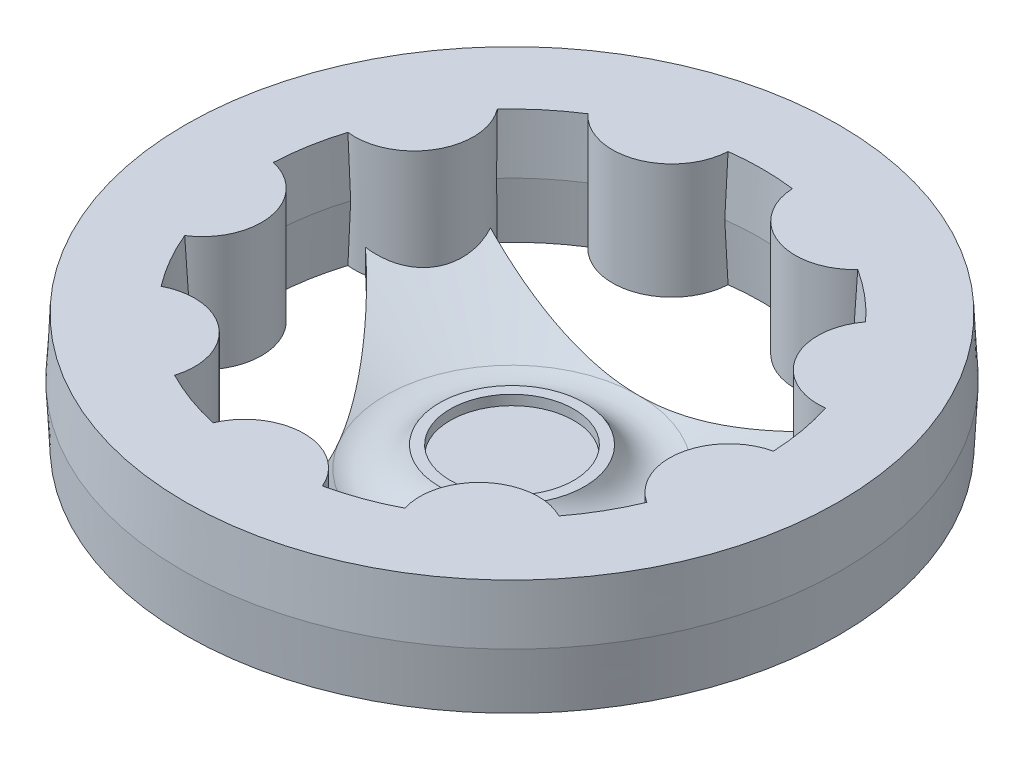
ISO-10303-21;
HEADER;
FILE_DESCRIPTION(('STEP AP214'),'2;1');
FILE_NAME('part.step','',(''),(''),'','','');
FILE_SCHEMA(('AUTOMOTIVE_DESIGN { 1 0 10303 214 1 1 1 1 }'));
ENDSEC;
DATA;
#1=APPLICATION_CONTEXT('core data for automotive mechanical design processes');
#2=APPLICATION_PROTOCOL_DEFINITION('international standard','automotive_design',2000,#1);
#3=PRODUCT_CONTEXT('',#1,'mechanical');
#4=PRODUCT('Part','Part','',(#3));
#5=PRODUCT_RELATED_PRODUCT_CATEGORY('part','',(#4));
#6=PRODUCT_DEFINITION_FORMATION('','',#4);
#7=PRODUCT_DEFINITION_CONTEXT('part definition',#1,'design');
#8=PRODUCT_DEFINITION('design','',#6,#7);
#9=PRODUCT_DEFINITION_SHAPE('','',#8);
#10=(LENGTH_UNIT() NAMED_UNIT(*) SI_UNIT(.MILLI.,.METRE.));
#11=(NAMED_UNIT(*) PLANE_ANGLE_UNIT() SI_UNIT($,.RADIAN.));
#12=(NAMED_UNIT(*) SI_UNIT($,.STERADIAN.) SOLID_ANGLE_UNIT());
#13=UNCERTAINTY_MEASURE_WITH_UNIT(LENGTH_MEASURE(1.E-05),#10,'distance_accuracy_value','');
#14=(GEOMETRIC_REPRESENTATION_CONTEXT(3) GLOBAL_UNCERTAINTY_ASSIGNED_CONTEXT((#13)) GLOBAL_UNIT_ASSIGNED_CONTEXT((#10,
#11,#12)) REPRESENTATION_CONTEXT('',''));
#15=CARTESIAN_POINT('',(0.,0.,0.));
#16=DIRECTION('',(0.,0.,1.));
#17=DIRECTION('',(1.,0.,0.));
#18=AXIS2_PLACEMENT_3D('',#15,#16,#17);
#19=CARTESIAN_POINT('',(75.8,2.,0.));
#20=DIRECTION('',(0.,1.,0.));
#21=DIRECTION('',(0.,0.,1.));
#22=AXIS2_PLACEMENT_3D('',#19,#20,#21);
#23=PLANE('',#22);
#24=CARTESIAN_POINT('',(0.,2.,0.));
#25=DIRECTION('',(0.,1.,0.));
#26=DIRECTION('',(0.,0.,1.));
#27=AXIS2_PLACEMENT_3D('',#24,#25,#26);
#28=CIRCLE('',#27,60.7337089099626);
#29=CARTESIAN_POINT('',(-27.9331315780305,2.,53.9288749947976));
#30=VERTEX_POINT('',#29);
#31=CARTESIAN_POINT('',(-13.2667924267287,1.99999999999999,59.2669858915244));
#32=VERTEX_POINT('',#31);
#33=EDGE_CURVE('E386',#30,#32,#28,.T.);
#34=ORIENTED_EDGE('',*,*,#33,.T.);
#35=CARTESIAN_POINT('',(0.,2.,64.8662910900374));
#36=DIRECTION('',(0.,1.,0.));
#37=DIRECTION('',(0.,0.,1.));
#38=AXIS2_PLACEMENT_3D('',#35,#36,#37);
#39=CIRCLE('',#38,14.4);
#40=CARTESIAN_POINT('',(-9.62033438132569,2.,54.1513871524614));
#41=VERTEX_POINT('',#40);
#42=EDGE_CURVE('E942',#32,#41,#39,.F.);
#43=ORIENTED_EDGE('',*,*,#42,.T.);
#44=CARTESIAN_POINT('',(0.,2.,0.));
#45=DIRECTION('',(0.,1.,0.));
#46=DIRECTION('',(0.,0.,1.));
#47=AXIS2_PLACEMENT_3D('',#44,#45,#46);
#48=CIRCLE('',#47,54.9993051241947);
#49=CARTESIAN_POINT('',(9.62033438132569,2.,54.1513871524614));
#50=VERTEX_POINT('',#49);
#51=EDGE_CURVE('E975',#41,#50,#48,.T.);
#52=ORIENTED_EDGE('',*,*,#51,.T.);
#53=CARTESIAN_POINT('',(13.2667924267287,2.,59.2669858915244));
#54=VERTEX_POINT('',#53);
#55=EDGE_CURVE('E979',#50,#54,#39,.F.);
#56=ORIENTED_EDGE('',*,*,#55,.T.);
#57=CARTESIAN_POINT('',(0.,2.,0.));
#58=DIRECTION('',(0.,1.,0.));
#59=DIRECTION('',(0.,0.,1.));
#60=AXIS2_PLACEMENT_3D('',#57,#58,#59);
#61=CIRCLE('',#60,60.7337089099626);
#62=CARTESIAN_POINT('',(27.9331315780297,2.,53.928874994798));
#63=VERTEX_POINT('',#62);
#64=EDGE_CURVE('E387',#54,#63,#61,.T.);
#65=ORIENTED_EDGE('',*,*,#64,.T.);
#66=CARTESIAN_POINT('',(41.6952481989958,2.,49.6904618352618));
#67=DIRECTION('',(0.,1.,0.));
#68=DIRECTION('',(0.,0.,1.));
#69=AXIS2_PLACEMENT_3D('',#66,#67,#68);
#70=CIRCLE('',#69,14.4);
#71=CARTESIAN_POINT('',(48.2590368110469,2.,36.8734154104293));
#72=VERTEX_POINT('',#71);
#73=EDGE_CURVE('E863',#63,#72,#70,.F.);
#74=ORIENTED_EDGE('',*,*,#73,.T.);
#75=CARTESIAN_POINT('',(56.0628328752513,2.,23.3568441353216));
#76=VERTEX_POINT('',#75);
#77=EDGE_CURVE('E392',#72,#76,#61,.T.);
#78=ORIENTED_EDGE('',*,*,#77,.T.);
#79=CARTESIAN_POINT('',(63.8808263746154,2.,11.2639132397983));
#80=DIRECTION('',(0.,1.,0.));
#81=DIRECTION('',(0.,0.,1.));
#82=AXIS2_PLACEMENT_3D('',#79,#80,#81);
#83=CIRCLE('',#82,14.4);
#84=CARTESIAN_POINT('',(60.6703415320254,2.,-2.77363594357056));
#85=VERTEX_POINT('',#84);
#86=EDGE_CURVE('E605',#76,#85,#83,.F.);
#87=ORIENTED_EDGE('',*,*,#86,.T.);
#88=CARTESIAN_POINT('',(57.9601116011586,2.,-18.1441136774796));
#89=VERTEX_POINT('',#88);
#90=EDGE_CURVE('E393',#85,#89,#61,.T.);
#91=ORIENTED_EDGE('',*,*,#90,.T.);
#92=CARTESIAN_POINT('',(56.1758559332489,2.,-32.4331455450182));
#93=DIRECTION('',(0.,1.,0.));
#94=DIRECTION('',(0.,0.,1.));
#95=AXIS2_PLACEMENT_3D('',#92,#93,#94);
#96=CIRCLE('',#95,14.4);
#97=CARTESIAN_POINT('',(51.7066441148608,2.,-18.7442396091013));
#98=VERTEX_POINT('',#97);
#99=EDGE_CURVE('E651',#89,#98,#96,.F.);
#100=ORIENTED_EDGE('',*,*,#99,.T.);
#101=CARTESIAN_POINT('',(0.,2.,0.));
#102=DIRECTION('',(0.,1.,0.));
#103=DIRECTION('',(0.,0.,1.));
#104=AXIS2_PLACEMENT_3D('',#101,#102,#103);
#105=CIRCLE('',#104,54.9993051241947);
#106=CARTESIAN_POINT('',(42.0863097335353,2.,-35.4071475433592));
#107=VERTEX_POINT('',#106);
#108=EDGE_CURVE('E656',#98,#107,#105,.T.);
#109=ORIENTED_EDGE('',*,*,#108,.T.);
#110=CARTESIAN_POINT('',(44.6933191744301,2.,-41.1228722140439));
#111=VERTEX_POINT('',#110);
#112=EDGE_CURVE('E643',#107,#111,#96,.F.);
#113=ORIENTED_EDGE('',*,*,#112,.T.);
#114=CARTESIAN_POINT('',(0.,2.,0.));
#115=DIRECTION('',(0.,1.,0.));
#116=DIRECTION('',(0.,0.,1.));
#117=AXIS2_PLACEMENT_3D('',#114,#115,#116);
#118=CIRCLE('',#117,60.7337089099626);
#119=CARTESIAN_POINT('',(32.7372099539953,2.,-51.1552390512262));
#120=VERTEX_POINT('',#119);
#121=EDGE_CURVE('E349',#111,#120,#118,.T.);
#122=ORIENTED_EDGE('',*,*,#121,.T.);
#123=CARTESIAN_POINT('',(22.1855781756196,2.,-60.9543750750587));
#124=DIRECTION('',(0.,1.,0.));
#125=DIRECTION('',(0.,0.,1.));
#126=AXIS2_PLACEMENT_3D('',#123,#124,#125);
#127=CIRCLE('',#126,14.4);
#128=CARTESIAN_POINT('',(7.80379606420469,2.,-60.2302595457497));
#129=VERTEX_POINT('',#128);
#130=EDGE_CURVE('E1129',#120,#129,#127,.F.);
#131=ORIENTED_EDGE('',*,*,#130,.T.);
#132=CARTESIAN_POINT('',(-7.80379606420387,2.,-60.2302595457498));
#133=VERTEX_POINT('',#132);
#134=EDGE_CURVE('E347',#129,#133,#118,.T.);
#135=ORIENTED_EDGE('',*,*,#134,.T.);
#136=CARTESIAN_POINT('',(-22.1855781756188,2.,-60.954375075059));
#137=DIRECTION('',(0.,1.,0.));
#138=DIRECTION('',(0.,0.,1.));
#139=AXIS2_PLACEMENT_3D('',#136,#137,#138);
#140=CIRCLE('',#139,14.4);
#141=CARTESIAN_POINT('',(-32.7372099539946,2.,-51.1552390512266));
#142=VERTEX_POINT('',#141);
#143=EDGE_CURVE('E1745',#133,#142,#140,.F.);
#144=ORIENTED_EDGE('',*,*,#143,.T.);
#145=CARTESIAN_POINT('',(-44.6933191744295,2.,-41.1228722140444));
#146=VERTEX_POINT('',#145);
#147=EDGE_CURVE('E342',#142,#146,#118,.T.);
#148=ORIENTED_EDGE('',*,*,#147,.T.);
#149=CARTESIAN_POINT('',(-56.1758559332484,2.,-32.433145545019));
#150=DIRECTION('',(0.,1.,0.));
#151=DIRECTION('',(0.,0.,1.));
#152=AXIS2_PLACEMENT_3D('',#149,#150,#151);
#153=CIRCLE('',#152,14.4);
#154=CARTESIAN_POINT('',(-42.0863097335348,2.,-35.4071475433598));
#155=VERTEX_POINT('',#154);
#156=EDGE_CURVE('E1046',#146,#155,#153,.F.);
#157=ORIENTED_EDGE('',*,*,#156,.T.);
#158=CARTESIAN_POINT('',(0.,2.,0.));
#159=DIRECTION('',(0.,1.,0.));
#160=DIRECTION('',(0.,0.,1.));
#161=AXIS2_PLACEMENT_3D('',#158,#159,#160);
#162=CIRCLE('',#161,54.9993051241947);
#163=CARTESIAN_POINT('',(-51.7066441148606,2.,-18.744239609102));
#164=VERTEX_POINT('',#163);
#165=EDGE_CURVE('E1051',#155,#164,#162,.T.);
#166=ORIENTED_EDGE('',*,*,#165,.T.);
#167=CARTESIAN_POINT('',(-57.9601116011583,2.,-18.1441136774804));
#168=VERTEX_POINT('',#167);
#169=EDGE_CURVE('E1043',#164,#168,#153,.F.);
#170=ORIENTED_EDGE('',*,*,#169,.T.);
#171=CARTESIAN_POINT('',(-60.6703415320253,2.,-2.77363594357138));
#172=VERTEX_POINT('',#171);
#173=EDGE_CURVE('E381',#168,#172,#28,.T.);
#174=ORIENTED_EDGE('',*,*,#173,.T.);
#175=CARTESIAN_POINT('',(-63.8808263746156,2.,11.2639132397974));
#176=DIRECTION('',(0.,1.,0.));
#177=DIRECTION('',(0.,0.,1.));
#178=AXIS2_PLACEMENT_3D('',#175,#176,#177);
#179=CIRCLE('',#178,14.4);
#180=CARTESIAN_POINT('',(-56.0628328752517,2.,23.3568441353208));
#181=VERTEX_POINT('',#180);
#182=EDGE_CURVE('E1014',#172,#181,#179,.F.);
#183=ORIENTED_EDGE('',*,*,#182,.T.);
#184=CARTESIAN_POINT('',(-48.2590368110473,2.,36.8734154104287));
#185=VERTEX_POINT('',#184);
#186=EDGE_CURVE('E385',#181,#185,#28,.T.);
#187=ORIENTED_EDGE('',*,*,#186,.T.);
#188=CARTESIAN_POINT('',(-41.6952481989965,2.,49.6904618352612));
#189=DIRECTION('',(0.,1.,0.));
#190=DIRECTION('',(0.,0.,1.));
#191=AXIS2_PLACEMENT_3D('',#188,#189,#190);
#192=CIRCLE('',#191,14.4);
#193=EDGE_CURVE('E435',#185,#30,#192,.F.);
#194=ORIENTED_EDGE('',*,*,#193,.T.);
#195=EDGE_LOOP('',(#34,#43,#52,#56,#65,#74,#78,#87,#91,#100,#109,#113,#122,#131,#135,#144,#148,
#157,#166,#170,#174,#183,#187,#194));
#196=FACE_BOUND('',#195,.T.);
#197=CARTESIAN_POINT('',(0.,2.,0.));
#198=DIRECTION('',(0.,1.,0.));
#199=DIRECTION('',(0.,0.,1.));
#200=AXIS2_PLACEMENT_3D('',#197,#198,#199);
#201=CIRCLE('',#200,75.8);
#202=CARTESIAN_POINT('',(10.1073022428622,1.99999999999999,75.1231152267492));
#203=VERTEX_POINT('',#202);
#204=CARTESIAN_POINT('',(-10.1073022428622,1.99999999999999,75.1231152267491));
#205=VERTEX_POINT('',#204);
#206=EDGE_CURVE('E831',#203,#205,#201,.T.);
#207=ORIENTED_EDGE('',*,*,#206,.T.);
#208=CARTESIAN_POINT('',(0.,1.99999999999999,64.8662910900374));
#209=DIRECTION('',(0.,1.,0.));
#210=DIRECTION('',(0.,0.,1.));
#211=AXIS2_PLACEMENT_3D('',#208,#209,#210);
#212=CIRCLE('',#211,14.4);
#213=CARTESIAN_POINT('',(-14.2213508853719,1.99999999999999,62.6050571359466));
#214=VERTEX_POINT('',#213);
#215=EDGE_CURVE('E325',#214,#205,#212,.T.);
#216=ORIENTED_EDGE('',*,*,#215,.F.);
#217=CARTESIAN_POINT('',(0.,2.,0.));
#218=DIRECTION('',(0.,1.,0.));
#219=DIRECTION('',(0.,0.,1.));
#220=AXIS2_PLACEMENT_3D('',#217,#218,#219);
#221=CIRCLE('',#220,64.2);
#222=CARTESIAN_POINT('',(14.2213508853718,1.99999999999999,62.6050571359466));
#223=VERTEX_POINT('',#222);
#224=EDGE_CURVE('E332',#223,#214,#221,.T.);
#225=ORIENTED_EDGE('',*,*,#224,.F.);
#226=EDGE_CURVE('E66',#203,#223,#212,.T.);
#227=ORIENTED_EDGE('',*,*,#226,.F.);
#228=EDGE_LOOP('',(#207,#216,#225,#227));
#229=FACE_BOUND('',#228,.T.);
#230=CARTESIAN_POINT('',(0.,2.,0.));
#231=DIRECTION('',(0.,1.,0.));
#232=DIRECTION('',(0.,0.,1.));
#233=AXIS2_PLACEMENT_3D('',#230,#231,#232);
#234=CIRCLE('',#233,79.2662910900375);
#235=CARTESIAN_POINT('',(0.,2.,79.2662910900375));
#236=VERTEX_POINT('',#235);
#237=EDGE_CURVE('E827',#236,#236,#234,.T.);
#238=ORIENTED_EDGE('',*,*,#237,.F.);
#239=EDGE_LOOP('',(#238));
#240=FACE_BOUND('',#239,.T.);
#241=CARTESIAN_POINT('',(0.,1.99999999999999,64.8662910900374));
#242=DIRECTION('',(0.,1.,0.));
#243=DIRECTION('',(0.,0.,1.));
#244=AXIS2_PLACEMENT_3D('',#241,#242,#243);
#245=CIRCLE('',#244,6.);
#246=CARTESIAN_POINT('',(0.,1.99999999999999,70.8662910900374));
#247=VERTEX_POINT('',#246);
#248=EDGE_CURVE('E846',#247,#247,#245,.T.);
#249=ORIENTED_EDGE('',*,*,#248,.T.);
#250=EDGE_LOOP('',(#249));
#251=FACE_BOUND('',#250,.T.);
#252=ADVANCED_FACE('F49',(#196,#229,#240,#251),#23,.F.);
#253=CARTESIAN_POINT('',(0.,0.,0.));
#254=DIRECTION('',(0.,1.,0.));
#255=DIRECTION('',(0.,0.,1.));
#256=AXIS2_PLACEMENT_3D('',#253,#254,#255);
#257=CYLINDRICAL_SURFACE('',#256,64.2);
#258=DIRECTION('',(0.,1.,0.));
#259=VECTOR('',#258,1.);
#260=CARTESIAN_POINT('',(14.2213508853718,13.9,62.6050571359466));
#261=LINE('',#260,#259);
#262=CARTESIAN_POINT('',(14.2213508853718,25.8,62.6050571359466));
#263=VERTEX_POINT('',#262);
#264=EDGE_CURVE('E318',#223,#263,#261,.T.);
#265=ORIENTED_EDGE('',*,*,#264,.F.);
#266=ORIENTED_EDGE('',*,*,#224,.T.);
#267=DIRECTION('',(0.,1.,0.));
#268=VECTOR('',#267,1.);
#269=CARTESIAN_POINT('',(-14.2213508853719,13.9,62.6050571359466));
#270=LINE('',#269,#268);
#271=CARTESIAN_POINT('',(-14.2213508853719,25.8,62.6050571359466));
#272=VERTEX_POINT('',#271);
#273=EDGE_CURVE('E337',#272,#214,#270,.F.);
#274=ORIENTED_EDGE('',*,*,#273,.F.);
#275=CARTESIAN_POINT('',(0.,25.8,0.));
#276=DIRECTION('',(0.,1.,0.));
#277=DIRECTION('',(0.,0.,1.));
#278=AXIS2_PLACEMENT_3D('',#275,#276,#277);
#279=CIRCLE('',#278,64.2);
#280=EDGE_CURVE('E334',#263,#272,#279,.T.);
#281=ORIENTED_EDGE('',*,*,#280,.F.);
#282=EDGE_LOOP('',(#265,#266,#274,#281));
#283=FACE_BOUND('',#282,.T.);
#284=ADVANCED_FACE('F330',(#283),#257,.T.);
#285=CARTESIAN_POINT('',(64.2,25.8,0.));
#286=DIRECTION('',(0.,1.,0.));
#287=DIRECTION('',(0.,0.,1.));
#288=AXIS2_PLACEMENT_3D('',#285,#286,#287);
#289=PLANE('',#288);
#290=CARTESIAN_POINT('',(0.,25.8,64.8662910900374));
#291=DIRECTION('',(0.,-1.,0.));
#292=DIRECTION('',(0.,0.,-1.));
#293=AXIS2_PLACEMENT_3D('',#290,#291,#292);
#294=CIRCLE('',#293,14.4);
#295=CARTESIAN_POINT('',(-10.1073022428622,25.8,75.1231152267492));
#296=VERTEX_POINT('',#295);
#297=EDGE_CURVE('E843',#296,#272,#294,.T.);
#298=ORIENTED_EDGE('',*,*,#297,.F.);
#299=CARTESIAN_POINT('',(0.,25.8,0.));
#300=DIRECTION('',(0.,1.,0.));
#301=DIRECTION('',(0.,0.,1.));
#302=AXIS2_PLACEMENT_3D('',#299,#300,#301);
#303=CIRCLE('',#302,75.8);
#304=CARTESIAN_POINT('',(10.1073022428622,25.8,75.1231152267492));
#305=VERTEX_POINT('',#304);
#306=EDGE_CURVE('E351',#305,#296,#303,.T.);
#307=ORIENTED_EDGE('',*,*,#306,.F.);
#308=EDGE_CURVE('E842',#263,#305,#294,.T.);
#309=ORIENTED_EDGE('',*,*,#308,.F.);
#310=ORIENTED_EDGE('',*,*,#280,.T.);
#311=EDGE_LOOP('',(#298,#307,#309,#310));
#312=FACE_BOUND('',#311,.T.);
#313=ADVANCED_FACE('F841',(#312),#289,.F.);
#314=CARTESIAN_POINT('',(0.,0.,0.));
#315=DIRECTION('',(0.,1.,0.));
#316=DIRECTION('',(0.,0.,1.));
#317=AXIS2_PLACEMENT_3D('',#314,#315,#316);
#318=CYLINDRICAL_SURFACE('',#317,75.8);
#319=DIRECTION('',(0.,1.,0.));
#320=VECTOR('',#319,1.);
#321=CARTESIAN_POINT('',(10.1073022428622,13.9,75.1231152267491));
#322=LINE('',#321,#320);
#323=EDGE_CURVE('E321',#305,#203,#322,.F.);
#324=ORIENTED_EDGE('',*,*,#323,.F.);
#325=ORIENTED_EDGE('',*,*,#306,.T.);
#326=DIRECTION('',(0.,1.,0.));
#327=VECTOR('',#326,1.);
#328=CARTESIAN_POINT('',(-10.1073022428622,13.9,75.1231152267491));
#329=LINE('',#328,#327);
#330=EDGE_CURVE('E324',#205,#296,#329,.T.);
#331=ORIENTED_EDGE('',*,*,#330,.F.);
#332=ORIENTED_EDGE('',*,*,#206,.F.);
#333=EDGE_LOOP('',(#324,#325,#331,#332));
#334=FACE_BOUND('',#333,.T.);
#335=ADVANCED_FACE('F838',(#334),#318,.F.);
#336=CARTESIAN_POINT('',(0.,30.,0.));
#337=DIRECTION('',(0.,1.,0.));
#338=DIRECTION('',(0.,0.,1.));
#339=AXIS2_PLACEMENT_3D('',#336,#337,#338);
#340=CONICAL_SURFACE('',#339,60.7337089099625,0.052359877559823);
#341=CARTESIAN_POINT('',(0.,30.,0.));
#342=DIRECTION('',(0.,1.,0.));
#343=DIRECTION('',(0.,0.,1.));
#344=AXIS2_PLACEMENT_3D('',#341,#342,#343);
#345=CIRCLE('',#344,60.7337089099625);
#346=CARTESIAN_POINT('',(13.2667924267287,30.,59.2669858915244));
#347=VERTEX_POINT('',#346);
#348=CARTESIAN_POINT('',(27.9331315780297,30.,53.9288749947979));
#349=VERTEX_POINT('',#348);
#350=EDGE_CURVE('E817',#347,#349,#345,.T.);
#351=ORIENTED_EDGE('',*,*,#350,.T.);
#352=CARTESIAN_POINT('',(27.9331347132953,30.0002,53.9288851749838));
#353=CARTESIAN_POINT('',(27.8965399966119,27.6667618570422,53.8101235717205));
#354=CARTESIAN_POINT('',(27.8614155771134,25.333342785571,53.6905808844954));
#355=CARTESIAN_POINT('',(27.7941073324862,20.666542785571,53.4499333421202));
#356=CARTESIAN_POINT('',(27.7619235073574,18.3331618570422,53.32882848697));
#357=CARTESIAN_POINT('',(27.7312099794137,15.9998,53.2069425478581));
#358=B_SPLINE_CURVE_WITH_KNOTS('',3,(#352,#353,#354,#355,#356,#357),.UNSPECIFIED.,.F.,.F.,(4,2,
4),(0.,7.01022957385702,14.0204591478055),.UNSPECIFIED.);
#359=CARTESIAN_POINT('',(27.7312126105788,16.,53.2069529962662));
#360=VERTEX_POINT('',#359);
#361=EDGE_CURVE('E595',#349,#360,#358,.T.);
#362=ORIENTED_EDGE('',*,*,#361,.T.);
#363=CARTESIAN_POINT('',(0.,16.,0.));
#364=DIRECTION('',(0.,1.,0.));
#365=DIRECTION('',(0.,0.,1.));
#366=AXIS2_PLACEMENT_3D('',#363,#364,#365);
#367=CIRCLE('',#366,60.);
#368=CARTESIAN_POINT('',(12.9574288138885,16.,58.5841705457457));
#369=VERTEX_POINT('',#368);
#370=EDGE_CURVE('E812',#369,#360,#367,.T.);
#371=ORIENTED_EDGE('',*,*,#370,.F.);
#372=CARTESIAN_POINT('',(12.9574241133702,15.9998,58.5841608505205));
#373=CARTESIAN_POINT('',(13.0122429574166,18.3331618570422,58.6972731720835));
#374=CARTESIAN_POINT('',(13.0654334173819,20.666542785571,58.8107322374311));
#375=CARTESIAN_POINT('',(13.1685575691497,25.333342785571,59.0383438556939));
#376=CARTESIAN_POINT('',(13.2184912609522,27.6667618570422,59.1524964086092));
#377=CARTESIAN_POINT('',(13.2667965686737,30.0002,59.266995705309));
#378=B_SPLINE_CURVE_WITH_KNOTS('',3,(#372,#373,#374,#375,#376,#377),.UNSPECIFIED.,.F.,.F.,(4,2,
4),(0.,7.01022957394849,14.0204591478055),.UNSPECIFIED.);
#379=EDGE_CURVE('E457',#369,#347,#378,.T.);
#380=ORIENTED_EDGE('',*,*,#379,.T.);
#381=EDGE_LOOP('',(#351,#362,#371,#380));
#382=FACE_BOUND('',#381,.T.);
#383=ADVANCED_FACE('F448',(#382),#340,.F.);
#384=CARTESIAN_POINT('',(0.,16.,0.));
#385=DIRECTION('',(0.,-1.,0.));
#386=DIRECTION('',(0.,0.,-1.));
#387=AXIS2_PLACEMENT_3D('',#384,#385,#386);
#388=CONICAL_SURFACE('',#387,60.,0.05235987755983);
#389=ORIENTED_EDGE('',*,*,#370,.T.);
#390=CARTESIAN_POINT('',(27.7312099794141,16.0002,53.2069425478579));
#391=CARTESIAN_POINT('',(27.7619235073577,13.6668381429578,53.3288284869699));
#392=CARTESIAN_POINT('',(27.7941073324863,11.333457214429,53.4499333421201));
#393=CARTESIAN_POINT('',(27.8614155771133,6.66665721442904,53.6905808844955));
#394=CARTESIAN_POINT('',(27.8965399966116,4.33323814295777,53.8101235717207));
#395=CARTESIAN_POINT('',(27.933134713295,1.9998,53.9288851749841));
#396=B_SPLINE_CURVE_WITH_KNOTS('',3,(#390,#391,#392,#393,#394,#395),.UNSPECIFIED.,.F.,.F.,(4,2,
4),(0.,7.0102295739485,14.0204591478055),.UNSPECIFIED.);
#397=EDGE_CURVE('E576',#360,#63,#396,.T.);
#398=ORIENTED_EDGE('',*,*,#397,.T.);
#399=ORIENTED_EDGE('',*,*,#64,.F.);
#400=CARTESIAN_POINT('',(13.2667965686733,1.99979999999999,59.2669957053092));
#401=CARTESIAN_POINT('',(13.218491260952,4.33323814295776,59.1524964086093));
#402=CARTESIAN_POINT('',(13.1685575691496,6.66665721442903,59.038343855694));
#403=CARTESIAN_POINT('',(13.0654334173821,11.333457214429,58.8107322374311));
#404=CARTESIAN_POINT('',(13.0122429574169,13.6668381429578,58.6972731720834));
#405=CARTESIAN_POINT('',(12.9574241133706,16.0002,58.5841608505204));
#406=B_SPLINE_CURVE_WITH_KNOTS('',3,(#400,#401,#402,#403,#404,#405),.UNSPECIFIED.,.F.,.F.,(4,2,
4),(0.,7.01022957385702,14.0204591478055),.UNSPECIFIED.);
#407=EDGE_CURVE('E943',#54,#369,#406,.T.);
#408=ORIENTED_EDGE('',*,*,#407,.T.);
#409=EDGE_LOOP('',(#389,#398,#399,#408));
#410=FACE_BOUND('',#409,.T.);
#411=ADVANCED_FACE('F1126',(#410),#388,.F.);
#412=CARTESIAN_POINT('',(47.583145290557,16.,36.5492036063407));
#413=VERTEX_POINT('',#412);
#414=CARTESIAN_POINT('',(55.4441114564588,16.,22.9336108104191));
#415=VERTEX_POINT('',#414);
#416=EDGE_CURVE('E816',#413,#415,#367,.T.);
#417=ORIENTED_EDGE('',*,*,#416,.F.);
#418=CARTESIAN_POINT('',(47.5831354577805,15.9998,36.5491992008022));
#419=CARTESIAN_POINT('',(47.697836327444,18.3331618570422,36.6006113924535));
#420=CARTESIAN_POINT('',(47.8115126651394,20.666542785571,36.6533359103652));
#421=CARTESIAN_POINT('',(48.0368162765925,25.333342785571,36.761409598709));
#422=CARTESIAN_POINT('',(48.1484435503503,27.6667618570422,36.8167587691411));
#423=CARTESIAN_POINT('',(48.2590462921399,30.0002,36.8734202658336));
#424=B_SPLINE_CURVE_WITH_KNOTS('',3,(#418,#419,#420,#421,#422,#423),.UNSPECIFIED.,.F.,.F.,(4,2,
4),(0.,7.01022957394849,14.0204591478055),.UNSPECIFIED.);
#425=CARTESIAN_POINT('',(48.2590368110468,30.,36.8734154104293));
#426=VERTEX_POINT('',#425);
#427=EDGE_CURVE('E567',#413,#426,#424,.T.);
#428=ORIENTED_EDGE('',*,*,#427,.T.);
#429=CARTESIAN_POINT('',(56.0628328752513,30.,23.3568441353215));
#430=VERTEX_POINT('',#429);
#431=EDGE_CURVE('E820',#426,#430,#345,.T.);
#432=ORIENTED_EDGE('',*,*,#431,.T.);
#433=CARTESIAN_POINT('',(56.0628418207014,30.0002,23.3568499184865));
#434=CARTESIAN_POINT('',(55.9584701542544,27.6667618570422,23.2893958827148));
#435=CARTESIAN_POINT('',(55.8547227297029,25.333342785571,23.2203984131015));
#436=CARTESIAN_POINT('',(55.6484763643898,20.666542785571,23.0793166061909));
#437=CARTESIAN_POINT('',(55.5459774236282,18.3331618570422,23.0072322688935));
#438=CARTESIAN_POINT('',(55.4441027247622,15.9998,22.9336044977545));
#439=B_SPLINE_CURVE_WITH_KNOTS('',3,(#433,#434,#435,#436,#437,#438),.UNSPECIFIED.,.F.,.F.,(4,2,
4),(0.,7.01022957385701,14.0204591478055),.UNSPECIFIED.);
#440=EDGE_CURVE('E561',#430,#415,#439,.T.);
#441=ORIENTED_EDGE('',*,*,#440,.T.);
#442=EDGE_LOOP('',(#417,#428,#432,#441));
#443=FACE_BOUND('',#442,.T.);
#444=ADVANCED_FACE('F1119',(#443),#340,.F.);
#445=ORIENTED_EDGE('',*,*,#77,.F.);
#446=CARTESIAN_POINT('',(48.2590462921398,1.9998,36.873420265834));
#447=CARTESIAN_POINT('',(48.1484435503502,4.33323814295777,36.8167587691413));
#448=CARTESIAN_POINT('',(48.0368162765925,6.66665721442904,36.7614095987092));
#449=CARTESIAN_POINT('',(47.8115126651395,11.333457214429,36.6533359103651));
#450=CARTESIAN_POINT('',(47.6978363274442,13.6668381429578,36.6006113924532));
#451=CARTESIAN_POINT('',(47.5831354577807,16.0002,36.5491992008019));
#452=B_SPLINE_CURVE_WITH_KNOTS('',3,(#446,#447,#448,#449,#450,#451),.UNSPECIFIED.,.F.,.F.,(4,2,
4),(0.,7.01022957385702,14.0204591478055),.UNSPECIFIED.);
#453=EDGE_CURVE('E74',#72,#413,#452,.T.);
#454=ORIENTED_EDGE('',*,*,#453,.T.);
#455=ORIENTED_EDGE('',*,*,#416,.T.);
#456=CARTESIAN_POINT('',(55.4441027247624,16.0002,22.9336044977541));
#457=CARTESIAN_POINT('',(55.5459774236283,13.6668381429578,23.0072322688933));
#458=CARTESIAN_POINT('',(55.6484763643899,11.333457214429,23.0793166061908));
#459=CARTESIAN_POINT('',(55.8547227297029,6.66665721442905,23.2203984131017));
#460=CARTESIAN_POINT('',(55.9584701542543,4.33323814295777,23.2893958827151));
#461=CARTESIAN_POINT('',(56.0628418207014,1.99980000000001,23.3568499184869));
#462=B_SPLINE_CURVE_WITH_KNOTS('',3,(#456,#457,#458,#459,#460,#461),.UNSPECIFIED.,.F.,.F.,(4,2,
4),(0.,7.01022957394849,14.0204591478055),.UNSPECIFIED.);
#463=EDGE_CURVE('E620',#415,#76,#462,.T.);
#464=ORIENTED_EDGE('',*,*,#463,.T.);
#465=EDGE_LOOP('',(#445,#454,#455,#464));
#466=FACE_BOUND('',#465,.T.);
#467=ADVANCED_FACE('F1123',(#466),#388,.F.);
#468=CARTESIAN_POINT('',(59.9441792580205,16.,-2.58754189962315));
#469=VERTEX_POINT('',#468);
#470=CARTESIAN_POINT('',(57.2140943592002,16.,-18.0706227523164));
#471=VERTEX_POINT('',#470);
#472=EDGE_CURVE('E871',#469,#471,#367,.T.);
#473=ORIENTED_EDGE('',*,*,#472,.F.);
#474=CARTESIAN_POINT('',(59.9441688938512,15.9998,-2.58753895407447));
#475=CARTESIAN_POINT('',(60.0650819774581,18.3331618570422,-2.62188322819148));
#476=CARTESIAN_POINT('',(60.1860537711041,20.666542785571,-2.65456364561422));
#477=CARTESIAN_POINT('',(60.428114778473,25.333342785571,-2.71659676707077));
#478=CARTESIAN_POINT('',(60.5492039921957,27.6667618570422,-2.74594947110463));
#479=CARTESIAN_POINT('',(60.6703519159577,30.0002,-2.77363831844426));
#480=B_SPLINE_CURVE_WITH_KNOTS('',3,(#474,#475,#476,#477,#478,#479),.UNSPECIFIED.,.F.,.F.,(4,2,
4),(0.,7.01022957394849,14.0204591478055),.UNSPECIFIED.);
#481=CARTESIAN_POINT('',(60.6703415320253,30.,-2.77363594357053));
#482=VERTEX_POINT('',#481);
#483=EDGE_CURVE('E553',#469,#482,#480,.T.);
#484=ORIENTED_EDGE('',*,*,#483,.T.);
#485=CARTESIAN_POINT('',(57.9601116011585,30.,-18.1441136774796));
#486=VERTEX_POINT('',#485);
#487=EDGE_CURVE('E1116',#482,#486,#345,.T.);
#488=ORIENTED_EDGE('',*,*,#487,.T.);
#489=CARTESIAN_POINT('',(57.9601221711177,30.0002,-18.1441149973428));
#490=CARTESIAN_POINT('',(57.8368102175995,27.6667618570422,-18.1286989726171));
#491=CARTESIAN_POINT('',(57.7129843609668,25.333342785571,-18.114866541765));
#492=CARTESIAN_POINT('',(57.4643048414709,20.666542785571,-18.090368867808));
#493=CARTESIAN_POINT('',(57.3394511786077,18.3331618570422,-18.079703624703));
#494=CARTESIAN_POINT('',(57.2140836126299,15.9998,-18.0706219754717));
#495=B_SPLINE_CURVE_WITH_KNOTS('',3,(#489,#490,#491,#492,#493,#494),.UNSPECIFIED.,.F.,.F.,(4,2,
4),(0.,7.01022957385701,14.0204591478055),.UNSPECIFIED.);
#496=EDGE_CURVE('E546',#486,#471,#495,.T.);
#497=ORIENTED_EDGE('',*,*,#496,.T.);
#498=EDGE_LOOP('',(#473,#484,#488,#497));
#499=FACE_BOUND('',#498,.T.);
#500=ADVANCED_FACE('F1188',(#499),#340,.F.);
#501=ORIENTED_EDGE('',*,*,#90,.F.);
#502=CARTESIAN_POINT('',(60.6703519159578,1.9998,-2.77363831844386));
#503=CARTESIAN_POINT('',(60.5492039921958,4.33323814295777,-2.74594947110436));
#504=CARTESIAN_POINT('',(60.428114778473,6.66665721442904,-2.71659676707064));
#505=CARTESIAN_POINT('',(60.1860537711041,11.333457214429,-2.65456364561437));
#506=CARTESIAN_POINT('',(60.0650819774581,13.6668381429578,-2.62188322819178));
#507=CARTESIAN_POINT('',(59.9441688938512,16.0002,-2.58753895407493));
#508=B_SPLINE_CURVE_WITH_KNOTS('',3,(#502,#503,#504,#505,#506,#507),.UNSPECIFIED.,.F.,.F.,(4,2,
4),(0.,7.01022957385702,14.0204591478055),.UNSPECIFIED.);
#509=EDGE_CURVE('E608',#85,#469,#508,.T.);
#510=ORIENTED_EDGE('',*,*,#509,.T.);
#511=ORIENTED_EDGE('',*,*,#472,.T.);
#512=CARTESIAN_POINT('',(57.2140836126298,16.0002,-18.0706219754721));
#513=CARTESIAN_POINT('',(57.3394511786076,13.6668381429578,-18.0797036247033));
#514=CARTESIAN_POINT('',(57.4643048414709,11.333457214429,-18.0903688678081));
#515=CARTESIAN_POINT('',(57.7129843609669,6.66665721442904,-18.1148665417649));
#516=CARTESIAN_POINT('',(57.8368102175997,4.33323814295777,-18.1286989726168));
#517=CARTESIAN_POINT('',(57.960122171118,1.9998,-18.1441149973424));
#518=B_SPLINE_CURVE_WITH_KNOTS('',3,(#512,#513,#514,#515,#516,#517),.UNSPECIFIED.,.F.,.F.,(4,2,
4),(0.,7.0102295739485,14.0204591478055),.UNSPECIFIED.);
#519=EDGE_CURVE('E687',#471,#89,#518,.T.);
#520=ORIENTED_EDGE('',*,*,#519,.T.);
#521=EDGE_LOOP('',(#501,#510,#511,#520));
#522=FACE_BOUND('',#521,.T.);
#523=ADVANCED_FACE('F1193',(#522),#388,.F.);
#524=CARTESIAN_POINT('',(44.2566655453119,16.,-40.5135477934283));
#525=VERTEX_POINT('',#524);
#526=CARTESIAN_POINT('',(32.2129666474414,16.,-50.6194110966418));
#527=VERTEX_POINT('',#526);
#528=EDGE_CURVE('E899',#525,#527,#367,.T.);
#529=ORIENTED_EDGE('',*,*,#528,.F.);
#530=CARTESIAN_POINT('',(44.2566594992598,15.9998,-40.5135388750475));
#531=CARTESIAN_POINT('',(44.3272082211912,18.3331618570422,-40.6175695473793));
#532=CARTESIAN_POINT('',(44.3988714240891,20.666542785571,-40.720363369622));
#533=CARTESIAN_POINT('',(44.5444267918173,25.333342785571,-40.9234773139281));
#534=CARTESIAN_POINT('',(44.6183189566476,27.6667618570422,-41.0237974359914));
#535=CARTESIAN_POINT('',(44.6933256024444,30.0002,-41.1228807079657));
#536=B_SPLINE_CURVE_WITH_KNOTS('',3,(#530,#531,#532,#533,#534,#535),.UNSPECIFIED.,.F.,.F.,(4,2,
4),(0.,7.01022957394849,14.0204591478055),.UNSPECIFIED.);
#537=CARTESIAN_POINT('',(44.6933191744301,30.,-41.1228722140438));
#538=VERTEX_POINT('',#537);
#539=EDGE_CURVE('E537',#525,#538,#536,.T.);
#540=ORIENTED_EDGE('',*,*,#539,.T.);
#541=CARTESIAN_POINT('',(32.7372099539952,30.,-51.1552390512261));
#542=VERTEX_POINT('',#541);
#543=EDGE_CURVE('E1112',#538,#542,#345,.T.);
#544=ORIENTED_EDGE('',*,*,#543,.T.);
#545=CARTESIAN_POINT('',(32.7372172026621,30.0002,-51.1552468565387));
#546=CARTESIAN_POINT('',(32.6526639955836,27.6667618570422,-51.0641741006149));
#547=CARTESIAN_POINT('',(32.5666992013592,25.333342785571,-50.9739841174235));
#548=CARTESIAN_POINT('',(32.3919464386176,20.666542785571,-50.7953696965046));
#549=CARTESIAN_POINT('',(32.3031584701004,18.3331618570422,-50.7069452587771));
#550=CARTESIAN_POINT('',(32.2129589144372,15.9998,-50.619403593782));
#551=B_SPLINE_CURVE_WITH_KNOTS('',3,(#545,#546,#547,#548,#549,#550),.UNSPECIFIED.,.F.,.F.,(4,2,
4),(0.,7.01022957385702,14.0204591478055),.UNSPECIFIED.);
#552=EDGE_CURVE('E530',#542,#527,#551,.T.);
#553=ORIENTED_EDGE('',*,*,#552,.T.);
#554=EDGE_LOOP('',(#529,#540,#544,#553));
#555=FACE_BOUND('',#554,.T.);
#556=ADVANCED_FACE('F1198',(#555),#340,.F.);
#557=ORIENTED_EDGE('',*,*,#121,.F.);
#558=CARTESIAN_POINT('',(44.6933256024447,1.99979999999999,-41.1228807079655));
#559=CARTESIAN_POINT('',(44.6183189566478,4.33323814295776,-41.0237974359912));
#560=CARTESIAN_POINT('',(44.5444267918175,6.66665721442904,-40.923477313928));
#561=CARTESIAN_POINT('',(44.3988714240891,11.333457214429,-40.7203633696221));
#562=CARTESIAN_POINT('',(44.327208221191,13.6668381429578,-40.6175695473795));
#563=CARTESIAN_POINT('',(44.2566594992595,16.0002,-40.5135388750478));
#564=B_SPLINE_CURVE_WITH_KNOTS('',3,(#558,#559,#560,#561,#562,#563),.UNSPECIFIED.,.F.,.F.,(4,2,
4),(0.,7.01022957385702,14.0204591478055),.UNSPECIFIED.);
#565=EDGE_CURVE('E683',#111,#525,#564,.T.);
#566=ORIENTED_EDGE('',*,*,#565,.T.);
#567=ORIENTED_EDGE('',*,*,#528,.T.);
#568=CARTESIAN_POINT('',(32.2129589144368,16.0002,-50.6194035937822));
#569=CARTESIAN_POINT('',(32.3031584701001,13.6668381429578,-50.7069452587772));
#570=CARTESIAN_POINT('',(32.3919464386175,11.333457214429,-50.7953696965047));
#571=CARTESIAN_POINT('',(32.5666992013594,6.66665721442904,-50.9739841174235));
#572=CARTESIAN_POINT('',(32.6526639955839,4.33323814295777,-51.0641741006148));
#573=CARTESIAN_POINT('',(32.7372172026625,1.9998,-51.1552468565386));
#574=B_SPLINE_CURVE_WITH_KNOTS('',3,(#568,#569,#570,#571,#572,#573),.UNSPECIFIED.,.F.,.F.,(4,2,
4),(0.,7.01022957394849,14.0204591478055),.UNSPECIFIED.);
#575=EDGE_CURVE('E885',#527,#120,#574,.T.);
#576=ORIENTED_EDGE('',*,*,#575,.T.);
#577=EDGE_LOOP('',(#557,#566,#567,#576));
#578=FACE_BOUND('',#577,.T.);
#579=ADVANCED_FACE('F1203',(#578),#388,.F.);
#580=CARTESIAN_POINT('',(7.86096616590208,16.,-59.4828144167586));
#581=VERTEX_POINT('',#580);
#582=CARTESIAN_POINT('',(-7.86096616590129,16.,-59.4828144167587));
#583=VERTEX_POINT('',#582);
#584=EDGE_CURVE('E900',#581,#583,#367,.T.);
#585=ORIENTED_EDGE('',*,*,#584,.F.);
#586=CARTESIAN_POINT('',(7.86096726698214,15.9998,-59.4828036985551));
#587=CARTESIAN_POINT('',(7.84814109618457,18.3331618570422,-59.6078436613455));
#588=CARTESIAN_POINT('',(7.83696369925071,20.666542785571,-59.7326525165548));
#589=CARTESIAN_POINT('',(7.81790645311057,25.333342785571,-59.9818080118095));
#590=CARTESIAN_POINT('',(7.81002660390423,27.6667618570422,-60.1061546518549));
#591=CARTESIAN_POINT('',(7.80379552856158,30.0002,-60.2302701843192));
#592=B_SPLINE_CURVE_WITH_KNOTS('',3,(#586,#587,#588,#589,#590,#591),.UNSPECIFIED.,.F.,.F.,(4,2,
4),(0.,7.01022957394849,14.0204591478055),.UNSPECIFIED.);
#593=CARTESIAN_POINT('',(7.80379606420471,30.,-60.2302595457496));
#594=VERTEX_POINT('',#593);
#595=EDGE_CURVE('E521',#581,#594,#592,.T.);
#596=ORIENTED_EDGE('',*,*,#595,.T.);
#597=CARTESIAN_POINT('',(-7.80379606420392,30.,-60.2302595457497));
#598=VERTEX_POINT('',#597);
#599=EDGE_CURVE('E1108',#594,#598,#345,.T.);
#600=ORIENTED_EDGE('',*,*,#599,.T.);
#601=CARTESIAN_POINT('',(-7.80379552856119,30.0002,-60.2302701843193));
#602=CARTESIAN_POINT('',(-7.81002660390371,27.6667618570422,-60.106154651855));
#603=CARTESIAN_POINT('',(-7.81790645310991,25.333342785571,-59.9818080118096));
#604=CARTESIAN_POINT('',(-7.83696369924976,20.666542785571,-59.7326525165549));
#605=CARTESIAN_POINT('',(-7.84814109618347,18.3331618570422,-59.6078436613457));
#606=CARTESIAN_POINT('',(-7.86096726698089,15.9998,-59.4828036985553));
#607=B_SPLINE_CURVE_WITH_KNOTS('',3,(#601,#602,#603,#604,#605,#606),.UNSPECIFIED.,.F.,.F.,(4,2,
4),(0.,7.01022957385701,14.0204591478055),.UNSPECIFIED.);
#608=EDGE_CURVE('E514',#598,#583,#607,.T.);
#609=ORIENTED_EDGE('',*,*,#608,.T.);
#610=EDGE_LOOP('',(#585,#596,#600,#609));
#611=FACE_BOUND('',#610,.T.);
#612=ADVANCED_FACE('F1208',(#611),#340,.F.);
#613=ORIENTED_EDGE('',*,*,#134,.F.);
#614=CARTESIAN_POINT('',(7.803795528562,1.9998,-60.2302701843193));
#615=CARTESIAN_POINT('',(7.81002660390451,4.33323814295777,-60.1061546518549));
#616=CARTESIAN_POINT('',(7.81790645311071,6.66665721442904,-59.9818080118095));
#617=CARTESIAN_POINT('',(7.83696369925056,11.333457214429,-59.7326525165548));
#618=CARTESIAN_POINT('',(7.84814109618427,13.6668381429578,-59.6078436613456));
#619=CARTESIAN_POINT('',(7.86096726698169,16.0002,-59.4828036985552));
#620=B_SPLINE_CURVE_WITH_KNOTS('',3,(#614,#615,#616,#617,#618,#619),.UNSPECIFIED.,.F.,.F.,(4,2,
4),(0.,7.01022957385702,14.0204591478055),.UNSPECIFIED.);
#621=EDGE_CURVE('E1132',#129,#581,#620,.T.);
#622=ORIENTED_EDGE('',*,*,#621,.T.);
#623=ORIENTED_EDGE('',*,*,#584,.T.);
#624=CARTESIAN_POINT('',(-7.86096726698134,16.0002,-59.4828036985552));
#625=CARTESIAN_POINT('',(-7.84814109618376,13.6668381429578,-59.6078436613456));
#626=CARTESIAN_POINT('',(-7.8369636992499,11.333457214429,-59.7326525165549));
#627=CARTESIAN_POINT('',(-7.81790645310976,6.66665721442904,-59.9818080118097));
#628=CARTESIAN_POINT('',(-7.81002660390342,4.33323814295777,-60.1061546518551));
#629=CARTESIAN_POINT('',(-7.80379552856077,1.9998,-60.2302701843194));
#630=B_SPLINE_CURVE_WITH_KNOTS('',3,(#624,#625,#626,#627,#628,#629),.UNSPECIFIED.,.F.,.F.,(4,2,
4),(0.,7.01022957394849,14.0204591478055),.UNSPECIFIED.);
#631=EDGE_CURVE('E897',#583,#133,#630,.T.);
#632=ORIENTED_EDGE('',*,*,#631,.T.);
#633=EDGE_LOOP('',(#613,#622,#623,#632));
#634=FACE_BOUND('',#633,.T.);
#635=ADVANCED_FACE('F1213',(#634),#388,.F.);
#636=CARTESIAN_POINT('',(-32.2129666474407,16.,-50.6194110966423));
#637=VERTEX_POINT('',#636);
#638=CARTESIAN_POINT('',(-44.2566655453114,16.,-40.5135477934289));
#639=VERTEX_POINT('',#638);
#640=EDGE_CURVE('E904',#637,#639,#367,.T.);
#641=ORIENTED_EDGE('',*,*,#640,.F.);
#642=CARTESIAN_POINT('',(-32.2129589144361,15.9998,-50.6194035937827));
#643=CARTESIAN_POINT('',(-32.3031584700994,18.3331618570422,-50.7069452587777));
#644=CARTESIAN_POINT('',(-32.3919464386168,20.666542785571,-50.7953696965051));
#645=CARTESIAN_POINT('',(-32.5666992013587,25.333342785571,-50.9739841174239));
#646=CARTESIAN_POINT('',(-32.6526639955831,27.6667618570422,-51.0641741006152));
#647=CARTESIAN_POINT('',(-32.7372172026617,30.0002,-51.155246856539));
#648=B_SPLINE_CURVE_WITH_KNOTS('',3,(#642,#643,#644,#645,#646,#647),.UNSPECIFIED.,.F.,.F.,(4,2,
4),(0.,7.01022957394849,14.0204591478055),.UNSPECIFIED.);
#649=CARTESIAN_POINT('',(-32.7372099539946,30.,-51.1552390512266));
#650=VERTEX_POINT('',#649);
#651=EDGE_CURVE('E505',#637,#650,#648,.T.);
#652=ORIENTED_EDGE('',*,*,#651,.T.);
#653=CARTESIAN_POINT('',(-44.6933191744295,30.,-41.1228722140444));
#654=VERTEX_POINT('',#653);
#655=EDGE_CURVE('E1034',#650,#654,#345,.T.);
#656=ORIENTED_EDGE('',*,*,#655,.T.);
#657=CARTESIAN_POINT('',(-44.6933256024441,30.0002,-41.122880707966));
#658=CARTESIAN_POINT('',(-44.6183189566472,27.6667618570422,-41.0237974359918));
#659=CARTESIAN_POINT('',(-44.5444267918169,25.333342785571,-40.9234773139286));
#660=CARTESIAN_POINT('',(-44.3988714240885,20.666542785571,-40.7203633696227));
#661=CARTESIAN_POINT('',(-44.3272082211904,18.3331618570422,-40.6175695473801));
#662=CARTESIAN_POINT('',(-44.256659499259,15.9998,-40.5135388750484));
#663=B_SPLINE_CURVE_WITH_KNOTS('',3,(#657,#658,#659,#660,#661,#662),.UNSPECIFIED.,.F.,.F.,(4,2,
4),(0.,7.01022957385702,14.0204591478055),.UNSPECIFIED.);
#664=EDGE_CURVE('E498',#654,#639,#663,.T.);
#665=ORIENTED_EDGE('',*,*,#664,.T.);
#666=EDGE_LOOP('',(#641,#652,#656,#665));
#667=FACE_BOUND('',#666,.T.);
#668=ADVANCED_FACE('F1031',(#667),#340,.F.);
#669=ORIENTED_EDGE('',*,*,#147,.F.);
#670=CARTESIAN_POINT('',(-32.7372172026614,1.99979999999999,-51.1552468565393));
#671=CARTESIAN_POINT('',(-32.6526639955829,4.33323814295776,-51.0641741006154));
#672=CARTESIAN_POINT('',(-32.5666992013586,6.66665721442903,-50.973984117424));
#673=CARTESIAN_POINT('',(-32.391946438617,11.333457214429,-50.7953696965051));
#674=CARTESIAN_POINT('',(-32.3031584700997,13.6668381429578,-50.7069452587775));
#675=CARTESIAN_POINT('',(-32.2129589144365,16.0002,-50.6194035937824));
#676=B_SPLINE_CURVE_WITH_KNOTS('',3,(#670,#671,#672,#673,#674,#675),.UNSPECIFIED.,.F.,.F.,(4,2,
4),(0.,7.01022957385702,14.0204591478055),.UNSPECIFIED.);
#677=EDGE_CURVE('E1749',#142,#637,#676,.T.);
#678=ORIENTED_EDGE('',*,*,#677,.T.);
#679=ORIENTED_EDGE('',*,*,#640,.T.);
#680=CARTESIAN_POINT('',(-44.2566594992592,16.0002,-40.5135388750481));
#681=CARTESIAN_POINT('',(-44.3272082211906,13.6668381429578,-40.6175695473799));
#682=CARTESIAN_POINT('',(-44.3988714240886,11.333457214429,-40.7203633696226));
#683=CARTESIAN_POINT('',(-44.5444267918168,6.66665721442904,-40.9234773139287));
#684=CARTESIAN_POINT('',(-44.6183189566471,4.33323814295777,-41.0237974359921));
#685=CARTESIAN_POINT('',(-44.6933256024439,1.9998,-41.1228807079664));
#686=B_SPLINE_CURVE_WITH_KNOTS('',3,(#680,#681,#682,#683,#684,#685),.UNSPECIFIED.,.F.,.F.,(4,2,
4),(0.,7.0102295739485,14.0204591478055),.UNSPECIFIED.);
#687=EDGE_CURVE('E894',#639,#146,#686,.T.);
#688=ORIENTED_EDGE('',*,*,#687,.T.);
#689=EDGE_LOOP('',(#669,#678,#679,#688));
#690=FACE_BOUND('',#689,.T.);
#691=ADVANCED_FACE('F1222',(#690),#388,.F.);
#692=CARTESIAN_POINT('',(-57.2140943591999,16.,-18.0706227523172));
#693=VERTEX_POINT('',#692);
#694=CARTESIAN_POINT('',(-59.9441792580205,16.,-2.58754189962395));
#695=VERTEX_POINT('',#694);
#696=EDGE_CURVE('E910',#693,#695,#367,.T.);
#697=ORIENTED_EDGE('',*,*,#696,.F.);
#698=CARTESIAN_POINT('',(-57.2140836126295,15.9998,-18.0706219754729));
#699=CARTESIAN_POINT('',(-57.3394511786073,18.3331618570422,-18.0797036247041));
#700=CARTESIAN_POINT('',(-57.4643048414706,20.666542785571,-18.0903688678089));
#701=CARTESIAN_POINT('',(-57.7129843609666,25.333342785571,-18.1148665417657));
#702=CARTESIAN_POINT('',(-57.8368102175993,27.6667618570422,-18.1286989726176));
#703=CARTESIAN_POINT('',(-57.9601221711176,30.0002,-18.1441149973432));
#704=B_SPLINE_CURVE_WITH_KNOTS('',3,(#698,#699,#700,#701,#702,#703),.UNSPECIFIED.,.F.,.F.,(4,2,
4),(0.,7.01022957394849,14.0204591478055),.UNSPECIFIED.);
#705=CARTESIAN_POINT('',(-57.9601116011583,30.,-18.1441136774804));
#706=VERTEX_POINT('',#705);
#707=EDGE_CURVE('E490',#693,#706,#704,.T.);
#708=ORIENTED_EDGE('',*,*,#707,.T.);
#709=CARTESIAN_POINT('',(-60.6703415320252,30.,-2.77363594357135));
#710=VERTEX_POINT('',#709);
#711=EDGE_CURVE('E1042',#706,#710,#345,.T.);
#712=ORIENTED_EDGE('',*,*,#711,.T.);
#713=CARTESIAN_POINT('',(-60.6703519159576,30.0002,-2.77363831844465));
#714=CARTESIAN_POINT('',(-60.5492039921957,27.6667618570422,-2.74594947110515));
#715=CARTESIAN_POINT('',(-60.4281147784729,25.333342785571,-2.71659676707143));
#716=CARTESIAN_POINT('',(-60.1860537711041,20.666542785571,-2.65456364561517));
#717=CARTESIAN_POINT('',(-60.065081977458,18.3331618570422,-2.62188322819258));
#718=CARTESIAN_POINT('',(-59.9441688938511,15.9998,-2.58753895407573));
#719=B_SPLINE_CURVE_WITH_KNOTS('',3,(#713,#714,#715,#716,#717,#718),.UNSPECIFIED.,.F.,.F.,(4,2,
4),(0.,7.01022957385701,14.0204591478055),.UNSPECIFIED.);
#720=EDGE_CURVE('E484',#710,#695,#719,.T.);
#721=ORIENTED_EDGE('',*,*,#720,.T.);
#722=EDGE_LOOP('',(#697,#708,#712,#721));
#723=FACE_BOUND('',#722,.T.);
#724=ADVANCED_FACE('F1227',(#723),#340,.F.);
#725=ORIENTED_EDGE('',*,*,#173,.F.);
#726=CARTESIAN_POINT('',(-57.9601221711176,1.9998,-18.1441149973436));
#727=CARTESIAN_POINT('',(-57.8368102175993,4.33323814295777,-18.1286989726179));
#728=CARTESIAN_POINT('',(-57.7129843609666,6.66665721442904,-18.1148665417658));
#729=CARTESIAN_POINT('',(-57.4643048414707,11.333457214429,-18.0903688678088));
#730=CARTESIAN_POINT('',(-57.3394511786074,13.6668381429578,-18.0797036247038));
#731=CARTESIAN_POINT('',(-57.2140836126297,16.0002,-18.0706219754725));
#732=B_SPLINE_CURVE_WITH_KNOTS('',3,(#726,#727,#728,#729,#730,#731),.UNSPECIFIED.,.F.,.F.,(4,2,
4),(0.,7.01022957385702,14.0204591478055),.UNSPECIFIED.);
#733=EDGE_CURVE('E1072',#168,#693,#732,.T.);
#734=ORIENTED_EDGE('',*,*,#733,.T.);
#735=ORIENTED_EDGE('',*,*,#696,.T.);
#736=CARTESIAN_POINT('',(-59.9441688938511,16.0002,-2.58753895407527));
#737=CARTESIAN_POINT('',(-60.065081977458,13.6668381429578,-2.62188322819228));
#738=CARTESIAN_POINT('',(-60.1860537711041,11.333457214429,-2.65456364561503));
#739=CARTESIAN_POINT('',(-60.428114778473,6.66665721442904,-2.71659676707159));
#740=CARTESIAN_POINT('',(-60.5492039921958,4.33323814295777,-2.74594947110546));
#741=CARTESIAN_POINT('',(-60.6703519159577,1.99980000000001,-2.7736383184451));
#742=B_SPLINE_CURVE_WITH_KNOTS('',3,(#736,#737,#738,#739,#740,#741),.UNSPECIFIED.,.F.,.F.,(4,2,
4),(0.,7.01022957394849,14.0204591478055),.UNSPECIFIED.);
#743=EDGE_CURVE('E1001',#695,#172,#742,.T.);
#744=ORIENTED_EDGE('',*,*,#743,.T.);
#745=EDGE_LOOP('',(#725,#734,#735,#744));
#746=FACE_BOUND('',#745,.T.);
#747=ADVANCED_FACE('F1232',(#746),#388,.F.);
#748=CARTESIAN_POINT('',(-55.4441114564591,16.,22.9336108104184));
#749=VERTEX_POINT('',#748);
#750=CARTESIAN_POINT('',(-47.5831452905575,16.,36.54920360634));
#751=VERTEX_POINT('',#750);
#752=EDGE_CURVE('E915',#749,#751,#367,.T.);
#753=ORIENTED_EDGE('',*,*,#752,.F.);
#754=CARTESIAN_POINT('',(-55.4441027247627,15.9998,22.9336044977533));
#755=CARTESIAN_POINT('',(-55.5459774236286,18.3331618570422,23.0072322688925));
#756=CARTESIAN_POINT('',(-55.6484763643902,20.666542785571,23.0793166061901));
#757=CARTESIAN_POINT('',(-55.8547227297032,25.3333427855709,23.2203984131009));
#758=CARTESIAN_POINT('',(-55.9584701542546,27.6667618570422,23.2893958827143));
#759=CARTESIAN_POINT('',(-56.0628418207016,30.0002,23.3568499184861));
#760=B_SPLINE_CURVE_WITH_KNOTS('',3,(#754,#755,#756,#757,#758,#759),.UNSPECIFIED.,.F.,.F.,(4,2,
4),(0.,7.01022957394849,14.0204591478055),.UNSPECIFIED.);
#761=CARTESIAN_POINT('',(-56.0628328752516,30.,23.3568441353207));
#762=VERTEX_POINT('',#761);
#763=EDGE_CURVE('E476',#749,#762,#760,.T.);
#764=ORIENTED_EDGE('',*,*,#763,.T.);
#765=CARTESIAN_POINT('',(-48.2590368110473,30.,36.8734154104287));
#766=VERTEX_POINT('',#765);
#767=EDGE_CURVE('E992',#762,#766,#345,.T.);
#768=ORIENTED_EDGE('',*,*,#767,.T.);
#769=CARTESIAN_POINT('',(-48.2590462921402,30.0002,36.8734202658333));
#770=CARTESIAN_POINT('',(-48.1484435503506,27.6667618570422,36.8167587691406));
#771=CARTESIAN_POINT('',(-48.0368162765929,25.333342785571,36.7614095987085));
#772=CARTESIAN_POINT('',(-47.81151266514,20.666542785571,36.6533359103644));
#773=CARTESIAN_POINT('',(-47.6978363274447,18.3331618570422,36.6006113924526));
#774=CARTESIAN_POINT('',(-47.5831354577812,15.9998,36.5491992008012));
#775=B_SPLINE_CURVE_WITH_KNOTS('',3,(#769,#770,#771,#772,#773,#774),.UNSPECIFIED.,.F.,.F.,(4,2,
4),(0.,7.01022957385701,14.0204591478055),.UNSPECIFIED.);
#776=EDGE_CURVE('E434',#766,#751,#775,.T.);
#777=ORIENTED_EDGE('',*,*,#776,.T.);
#778=EDGE_LOOP('',(#753,#764,#768,#777));
#779=FACE_BOUND('',#778,.T.);
#780=ADVANCED_FACE('F449',(#779),#340,.F.);
#781=ORIENTED_EDGE('',*,*,#186,.F.);
#782=CARTESIAN_POINT('',(-56.0628418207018,1.9998,23.3568499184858));
#783=CARTESIAN_POINT('',(-55.9584701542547,4.33323814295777,23.2893958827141));
#784=CARTESIAN_POINT('',(-55.8547227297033,6.66665721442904,23.2203984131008));
#785=CARTESIAN_POINT('',(-55.6484763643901,11.333457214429,23.0793166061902));
#786=CARTESIAN_POINT('',(-55.5459774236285,13.6668381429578,23.0072322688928));
#787=CARTESIAN_POINT('',(-55.4441027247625,16.0002,22.9336044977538));
#788=B_SPLINE_CURVE_WITH_KNOTS('',3,(#782,#783,#784,#785,#786,#787),.UNSPECIFIED.,.F.,.F.,(4,2,
4),(0.,7.01022957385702,14.0204591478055),.UNSPECIFIED.);
#789=EDGE_CURVE('E1008',#181,#749,#788,.T.);
#790=ORIENTED_EDGE('',*,*,#789,.T.);
#791=ORIENTED_EDGE('',*,*,#752,.T.);
#792=CARTESIAN_POINT('',(-47.5831354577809,16.0002,36.5491992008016));
#793=CARTESIAN_POINT('',(-47.6978363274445,13.6668381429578,36.6006113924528));
#794=CARTESIAN_POINT('',(-47.8115126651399,11.333457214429,36.6533359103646));
#795=CARTESIAN_POINT('',(-48.0368162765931,6.66665721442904,36.7614095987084));
#796=CARTESIAN_POINT('',(-48.1484435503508,4.33323814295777,36.8167587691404));
#797=CARTESIAN_POINT('',(-48.2590462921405,1.9998,36.873420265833));
#798=B_SPLINE_CURVE_WITH_KNOTS('',3,(#792,#793,#794,#795,#796,#797),.UNSPECIFIED.,.F.,.F.,(4,2,
4),(0.,7.0102295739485,14.0204591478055),.UNSPECIFIED.);
#799=EDGE_CURVE('E405',#751,#185,#798,.T.);
#800=ORIENTED_EDGE('',*,*,#799,.T.);
#801=EDGE_LOOP('',(#781,#790,#791,#800));
#802=FACE_BOUND('',#801,.T.);
#803=ADVANCED_FACE('F1241',(#802),#388,.F.);
#804=CARTESIAN_POINT('',(0.,9.19737864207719,0.));
#805=DIRECTION('',(0.,1.,0.));
#806=DIRECTION('',(0.,0.,1.));
#807=AXIS2_PLACEMENT_3D('',#804,#805,#806);
#808=CONICAL_SURFACE('',#807,60.,1.18682389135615);
#809=CARTESIAN_POINT('',(-99.2303906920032,29.0856755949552,-45.6452351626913));
#810=CARTESIAN_POINT('',(-97.3039607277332,28.2596632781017,-44.9407459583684));
#811=CARTESIAN_POINT('',(-95.3936046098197,27.432443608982,-44.1937355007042));
#812=CARTESIAN_POINT('',(-91.6082479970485,25.7768346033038,-42.6161052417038));
#813=CARTESIAN_POINT('',(-89.7332475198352,24.9484452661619,-41.785485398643));
#814=CARTESIAN_POINT('',(-86.0205653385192,23.2911862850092,-40.0414846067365));
#815=CARTESIAN_POINT('',(-84.182909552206,22.4623166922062,-39.1280484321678));
#816=CARTESIAN_POINT('',(-80.5492765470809,20.8062314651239,-37.2203689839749));
#817=CARTESIAN_POINT('',(-78.7532992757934,19.9790158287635,-36.2261258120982));
#818=CARTESIAN_POINT('',(-75.1615479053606,18.3075171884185,-34.1324096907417));
#819=CARTESIAN_POINT('',(-73.3669026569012,17.4633248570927,-33.03092660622));
#820=CARTESIAN_POINT('',(-69.8273731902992,15.7813821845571,-30.7460509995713));
#821=CARTESIAN_POINT('',(-68.0824902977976,14.9436320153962,-29.562656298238));
#822=CARTESIAN_POINT('',(-64.6460186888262,13.2785073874,-27.1158354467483));
#823=CARTESIAN_POINT('',(-62.9544043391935,12.451128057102,-25.8524486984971));
#824=CARTESIAN_POINT('',(-60.4583229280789,11.2213362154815,-23.89786657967));
#825=CARTESIAN_POINT('',(-59.6331889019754,10.8132866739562,-23.2364248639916));
#826=CARTESIAN_POINT('',(-57.9969173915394,10.0017383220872,-21.89374387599));
#827=CARTESIAN_POINT('',(-57.1857796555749,9.59823942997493,-21.2125049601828));
#828=CARTESIAN_POINT('',(-55.3138087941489,8.66516456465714,-19.6033895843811));
#829=CARTESIAN_POINT('',(-54.2584136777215,8.13768099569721,-18.6679579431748));
#830=CARTESIAN_POINT('',(-52.1733206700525,7.09517861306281,-16.7622357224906));
#831=CARTESIAN_POINT('',(-51.1436218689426,6.58015935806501,-15.7919463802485));
#832=CARTESIAN_POINT('',(-49.1099540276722,5.56601728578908,-13.8158855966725));
#833=CARTESIAN_POINT('',(-48.1059943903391,5.06690026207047,-12.8101014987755));
#834=CARTESIAN_POINT('',(-46.1245231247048,4.08952149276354,-10.7628733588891));
#835=CARTESIAN_POINT('',(-45.1470114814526,3.61125973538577,-9.72142933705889));
#836=CARTESIAN_POINT('',(-43.7060507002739,2.91686719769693,-8.13770631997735));
#837=CARTESIAN_POINT('',(-43.232454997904,2.69040605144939,-7.60913605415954));
#838=CARTESIAN_POINT('',(-42.2918603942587,2.24515361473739,-6.54298008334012));
#839=CARTESIAN_POINT('',(-41.8248613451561,2.02636215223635,-6.00539458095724));
#840=CARTESIAN_POINT('',(-40.8974518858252,1.59752092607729,-4.92102168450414));
#841=CARTESIAN_POINT('',(-40.4370421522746,1.38747205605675,-4.37423335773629));
#842=CARTESIAN_POINT('',(-39.5229263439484,0.977410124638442,-3.27138929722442));
#843=CARTESIAN_POINT('',(-39.0692200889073,0.777396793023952,-2.71533381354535));
#844=CARTESIAN_POINT('',(-38.1688228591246,0.388943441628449,-1.59412236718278));
#845=CARTESIAN_POINT('',(-37.7221280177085,0.200496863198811,-1.02897179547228));
#846=CARTESIAN_POINT('',(-36.8356086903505,-0.163321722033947,0.11082580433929));
#847=CARTESIAN_POINT('',(-36.3957842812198,-0.338693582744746,0.685472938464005));
#848=CARTESIAN_POINT('',(-35.0869454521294,-0.842493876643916,2.42362792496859));
#849=CARTESIAN_POINT('',(-34.2283123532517,-1.14871809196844,3.60166421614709));
#850=CARTESIAN_POINT('',(-32.8285530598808,-1.59432554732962,5.58764676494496));
#851=CARTESIAN_POINT('',(-32.2789511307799,-1.75500111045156,6.38488904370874));
#852=CARTESIAN_POINT('',(-31.1935525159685,-2.03891804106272,7.99532943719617));
#853=CARTESIAN_POINT('',(-30.6577551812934,-2.16216117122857,8.80852679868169));
#854=CARTESIAN_POINT('',(-29.6014453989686,-2.36687957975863,10.4491963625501));
#855=CARTESIAN_POINT('',(-29.0809223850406,-2.44838440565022,11.2766580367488));
#856=CARTESIAN_POINT('',(-28.0560823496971,-2.56655921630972,12.9447547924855));
#857=CARTESIAN_POINT('',(-27.5517652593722,-2.60322939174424,13.7853898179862));
#858=CARTESIAN_POINT('',(-26.5610769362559,-2.6301746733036,15.4771323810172));
#859=CARTESIAN_POINT('',(-26.0746935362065,-2.6204818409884,16.3282322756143));
#860=CARTESIAN_POINT('',(-25.1207900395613,-2.55519203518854,18.0391667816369));
#861=CARTESIAN_POINT('',(-24.6532698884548,-2.49959519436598,18.8990013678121));
#862=CARTESIAN_POINT('',(-23.7377971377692,-2.34473914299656,20.6257847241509));
#863=CARTESIAN_POINT('',(-23.2898569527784,-2.24545266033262,21.4927376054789));
#864=CARTESIAN_POINT('',(-22.4144715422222,-2.00692940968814,23.2314360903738));
#865=CARTESIAN_POINT('',(-21.9870274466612,-1.86769044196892,24.1031819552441));
#866=CARTESIAN_POINT('',(-20.9076371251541,-1.4614696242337,26.3638462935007));
#867=CARTESIAN_POINT('',(-20.2714438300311,-1.16751262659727,27.7555089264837));
#868=CARTESIAN_POINT('',(-19.3562343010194,-0.673627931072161,29.8472911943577));
#869=CARTESIAN_POINT('',(-19.0576260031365,-0.500137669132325,30.5453967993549));
#870=CARTESIAN_POINT('',(-18.473260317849,-0.13763778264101,31.9429781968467));
#871=CARTESIAN_POINT('',(-18.1875027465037,0.0513716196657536,32.6424539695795));
#872=CARTESIAN_POINT('',(-17.6284149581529,0.443125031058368,34.0433654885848));
#873=CARTESIAN_POINT('',(-17.355097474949,0.645882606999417,34.7448024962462));
#874=CARTESIAN_POINT('',(-16.8210152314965,1.0632052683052,36.1489378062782));
#875=CARTESIAN_POINT('',(-16.5602505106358,1.27777039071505,36.8516361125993));
#876=CARTESIAN_POINT('',(-16.0511337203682,1.71713562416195,38.2582306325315));
#877=CARTESIAN_POINT('',(-15.8027803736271,1.9419346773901,38.9621267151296));
#878=CARTESIAN_POINT('',(-15.3182999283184,2.40044098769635,40.371216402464));
#879=CARTESIAN_POINT('',(-15.0821728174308,2.63414823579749,41.0764100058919));
#880=CARTESIAN_POINT('',(-14.6187667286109,3.11264347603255,42.4980500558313));
#881=CARTESIAN_POINT('',(-14.3916587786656,3.35754104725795,43.2145153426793));
#882=CARTESIAN_POINT('',(-13.9497350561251,3.85425580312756,44.6488426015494));
#883=CARTESIAN_POINT('',(-13.734919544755,4.10607313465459,45.3667046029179));
#884=CARTESIAN_POINT('',(-13.1087472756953,4.87050547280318,47.5223782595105));
#885=CARTESIAN_POINT('',(-12.7156431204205,5.39212339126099,48.96234408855));
#886=CARTESIAN_POINT('',(-11.9776468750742,6.45319972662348,51.8469743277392));
#887=CARTESIAN_POINT('',(-11.6327271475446,6.99264769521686,53.2916355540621));
#888=CARTESIAN_POINT('',(-10.9903046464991,8.08544364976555,56.1862983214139));
#889=CARTESIAN_POINT('',(-10.6928033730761,8.63879207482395,57.636300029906));
#890=CARTESIAN_POINT('',(-10.221811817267,9.599278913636,60.1332908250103));
#891=CARTESIAN_POINT('',(-10.0369543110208,10.0038519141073,61.1791391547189));
#892=CARTESIAN_POINT('',(-9.69150962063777,10.8175709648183,63.2730693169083));
#893=CARTESIAN_POINT('',(-9.53092283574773,11.2267170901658,64.3211511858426));
#894=CARTESIAN_POINT('',(-9.08545280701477,12.4598179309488,67.4684363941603));
#895=CARTESIAN_POINT('',(-8.8368607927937,13.2894332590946,69.5706745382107));
#896=CARTESIAN_POINT('',(-8.4360391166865,14.9590861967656,73.7813618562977));
#897=CARTESIAN_POINT('',(-8.28385952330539,15.799128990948,75.8898136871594));
#898=CARTESIAN_POINT('',(-8.07583240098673,17.4856674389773,80.1088457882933));
#899=CARTESIAN_POINT('',(-8.01998237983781,18.3321629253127,82.219426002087));
#900=CARTESIAN_POINT('',(-8.00465194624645,20.0037665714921,86.3768699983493));
#901=CARTESIAN_POINT('',(-8.04236455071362,20.8287650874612,88.4237683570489));
#902=CARTESIAN_POINT('',(-8.2081167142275,22.4803921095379,92.5132494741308));
#903=CARTESIAN_POINT('',(-8.33615622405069,23.3070206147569,94.5558322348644));
#904=CARTESIAN_POINT('',(-8.68219225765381,24.9597651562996,98.6318887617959));
#905=CARTESIAN_POINT('',(-8.90012551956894,25.7858811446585,100.665367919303));
#906=CARTESIAN_POINT('',(-9.42558415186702,27.4369480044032,104.721195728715));
#907=CARTESIAN_POINT('',(-9.73310963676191,28.2618988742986,106.74354436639));
#908=CARTESIAN_POINT('',(-10.0852509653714,29.0856494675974,108.758592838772));
#909=B_SPLINE_CURVE_WITH_KNOTS('',3,(#809,#810,#811,#812,#813,#814,#815,#816,#817,#818,#819,
#820,#821,#822,#823,#824,#825,#826,#827,#828,#829,#830,#831,#832,#833,#834,#835,#836,#837,#838,
#839,#840,#841,#842,#843,#844,#845,#846,#847,#848,#849,#850,#851,#852,#853,#854,#855,#856,#857,
#858,#859,#860,#861,#862,#863,#864,#865,#866,#867,#868,#869,#870,#871,#872,#873,#874,#875,#876,
#877,#878,#879,#880,#881,#882,#883,#884,#885,#886,#887,#888,#889,#890,#891,#892,#893,#894,#895,
#896,#897,#898,#899,#900,#901,#902,#903,#904,#905,#906,#907,#908),.UNSPECIFIED.,.F.,.F.,(4,2,2,
2,2,2,2,2,2,2,2,2,2,2,2,2,2,2,2,2,2,2,2,2,2,2,2,2,2,2,2,2,2,2,2,2,2,2,2,2,2,2,2,2,2,2,2,2,2,4),
(0.,6.63334812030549,13.2666995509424,19.9045074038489,26.5423068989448,33.3461461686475,
40.1501665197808,46.9508610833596,50.3511822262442,53.7514421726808,58.2678615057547,
62.7841206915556,67.3020068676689,71.8198904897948,74.0546678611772,76.2893950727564,
78.5243501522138,80.7592450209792,82.9928607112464,85.2265013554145,89.6925270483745,
92.6364480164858,95.5802303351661,98.5219257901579,101.46360873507,104.403257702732,
107.342898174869,110.284376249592,113.226016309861,117.897065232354,120.233458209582,
122.569817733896,124.908517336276,127.247224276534,129.585690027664,131.924153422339,
134.295487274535,136.666871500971,141.409419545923,146.149236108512,150.889202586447,
154.298462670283,157.707778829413,164.526426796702,171.348612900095,178.170622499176,
184.790453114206,191.410280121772,198.025456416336,204.640641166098),.UNSPECIFIED.);
#910=CARTESIAN_POINT('',(-26.6255478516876,-2.62259669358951,15.3722672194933));
#911=VERTEX_POINT('',#910);
#912=CARTESIAN_POINT('',(-11.1026256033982,7.9012512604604,55.6961381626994));
#913=VERTEX_POINT('',#912);
#914=EDGE_CURVE('E391',#911,#913,#909,.T.);
#915=ORIENTED_EDGE('',*,*,#914,.T.);
#916=CARTESIAN_POINT('',(-13.2668768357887,9.4939025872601,59.2671858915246));
#917=CARTESIAN_POINT('',(-13.1048174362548,9.3282047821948,58.8831544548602));
#918=CARTESIAN_POINT('',(-12.925877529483,9.16365194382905,58.5057488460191));
#919=CARTESIAN_POINT('',(-12.5351122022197,8.83814622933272,57.7665955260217));
#920=CARTESIAN_POINT('',(-12.3232778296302,8.67719434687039,57.4048521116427));
#921=CARTESIAN_POINT('',(-11.8668263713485,8.35969275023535,56.698307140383));
#922=CARTESIAN_POINT('',(-11.6220882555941,8.20316200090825,56.3535748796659));
#923=CARTESIAN_POINT('',(-11.2318546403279,7.9733743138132,55.8523966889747));
#924=CARTESIAN_POINT('',(-11.0979228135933,7.89761338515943,55.6879911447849));
#925=CARTESIAN_POINT('',(-10.8224461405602,7.7479241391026,55.3647242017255));
#926=CARTESIAN_POINT('',(-10.6808989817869,7.6739963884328,55.2058645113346));
#927=CARTESIAN_POINT('',(-10.244539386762,7.45501198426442,54.7375357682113));
#928=CARTESIAN_POINT('',(-9.93849884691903,7.31304363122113,54.4369474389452));
#929=CARTESIAN_POINT('',(-9.29831195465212,7.03923960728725,53.8623636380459));
#930=CARTESIAN_POINT('',(-8.96416806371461,6.9074030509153,53.5883658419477));
#931=CARTESIAN_POINT('',(-8.27009887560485,6.65591606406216,53.0699873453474));
#932=CARTESIAN_POINT('',(-7.91021014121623,6.53624891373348,52.8255659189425));
#933=CARTESIAN_POINT('',(-7.16656761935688,6.3108902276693,52.3686631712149));
#934=CARTESIAN_POINT('',(-6.78281614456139,6.20519734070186,52.1561787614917));
#935=CARTESIAN_POINT('',(-6.0214713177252,6.01652544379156,51.779288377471));
#936=CARTESIAN_POINT('',(-5.64528388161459,5.93248172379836,51.6125751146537));
#937=CARTESIAN_POINT('',(-4.87727136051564,5.77976353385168,51.3111310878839));
#938=CARTESIAN_POINT('',(-4.48544684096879,5.711088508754,51.1763991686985));
#939=CARTESIAN_POINT('',(-3.68940988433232,5.59052295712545,50.9407576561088));
#940=CARTESIAN_POINT('',(-3.28520281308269,5.53862526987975,50.8398336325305));
#941=CARTESIAN_POINT('',(-2.46773678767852,5.45271686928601,50.6731864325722));
#942=CARTESIAN_POINT('',(-2.05447876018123,5.41870433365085,50.6074596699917));
#943=CARTESIAN_POINT('',(-1.26579410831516,5.37190233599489,50.517122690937));
#944=CARTESIAN_POINT('',(-0.890878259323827,5.35728081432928,50.4889613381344));
#945=CARTESIAN_POINT('',(-0.139723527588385,5.34331760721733,50.4620666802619));
#946=CARTESIAN_POINT('',(0.236515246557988,5.34397469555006,50.4633310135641));
#947=CARTESIAN_POINT('',(0.987300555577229,5.36055279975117,50.4952650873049));
#948=CARTESIAN_POINT('',(1.36184750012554,5.37646989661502,50.5259272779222));
#949=CARTESIAN_POINT('',(2.10647807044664,5.42325546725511,50.6162593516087));
#950=CARTESIAN_POINT('',(2.47656170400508,5.45412391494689,50.6759291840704));
#951=CARTESIAN_POINT('',(3.19464176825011,5.5286887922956,50.8205470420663));
#952=CARTESIAN_POINT('',(3.54292510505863,5.57181390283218,50.9043711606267));
#953=CARTESIAN_POINT('',(4.23062332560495,5.67058841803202,51.0971464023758));
#954=CARTESIAN_POINT('',(4.57003854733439,5.72623734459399,51.2060965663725));
#955=CARTESIAN_POINT('',(5.23800420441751,5.84921302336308,51.4480385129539));
#956=CARTESIAN_POINT('',(5.56655432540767,5.91654011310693,51.5810309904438));
#957=CARTESIAN_POINT('',(6.21100564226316,6.0619243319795,51.8698259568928));
#958=CARTESIAN_POINT('',(6.52690630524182,6.1399819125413,52.02562940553));
#959=CARTESIAN_POINT('',(7.16057313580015,6.3101414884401,52.3673939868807));
#960=CARTESIAN_POINT('',(7.47758075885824,6.40276298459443,52.5545026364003));
#961=CARTESIAN_POINT('',(8.09430258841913,6.59758136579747,52.9508954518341));
#962=CARTESIAN_POINT('',(8.39401622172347,6.69977856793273,53.1601803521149));
#963=CARTESIAN_POINT('',(8.97496501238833,6.91262568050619,53.5994070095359));
#964=CARTESIAN_POINT('',(9.25619057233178,7.02327991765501,53.8293593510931));
#965=CARTESIAN_POINT('',(9.79897069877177,7.2519035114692,54.3082968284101));
#966=CARTESIAN_POINT('',(10.0605164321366,7.36987611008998,54.5572904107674));
#967=CARTESIAN_POINT('',(10.5878514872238,7.62407315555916,55.0982854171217));
#968=CARTESIAN_POINT('',(10.8514700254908,7.76094530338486,55.3921005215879));
#969=CARTESIAN_POINT('',(11.3523684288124,8.04076794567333,55.998465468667));
#970=CARTESIAN_POINT('',(11.5896568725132,8.18371643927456,56.311009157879));
#971=CARTESIAN_POINT('',(12.0367604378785,8.47429740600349,56.9524380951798));
#972=CARTESIAN_POINT('',(12.2466081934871,8.62192405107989,57.281303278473));
#973=CARTESIAN_POINT('',(12.6382490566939,8.92081345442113,57.9535590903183));
#974=CARTESIAN_POINT('',(12.8200565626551,9.07207430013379,58.2969421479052));
#975=CARTESIAN_POINT('',(13.0365398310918,9.26929942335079,58.7489759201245));
#976=CARTESIAN_POINT('',(13.0843695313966,9.31410878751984,58.8519611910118));
#977=CARTESIAN_POINT('',(13.1775039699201,9.40388298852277,59.0588613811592));
#978=CARTESIAN_POINT('',(13.2228111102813,9.44884763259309,59.1627753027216));
#979=CARTESIAN_POINT('',(13.2668768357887,9.4939025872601,59.2671858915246));
#980=B_SPLINE_CURVE_WITH_KNOTS('',3,(#916,#917,#918,#919,#920,#921,#922,#923,#924,#925,#926,
#927,#928,#929,#930,#931,#932,#933,#934,#935,#936,#937,#938,#939,#940,#941,#942,#943,#944,#945,
#946,#947,#948,#949,#950,#951,#952,#953,#954,#955,#956,#957,#958,#959,#960,#961,#962,#963,#964,
#965,#966,#967,#968,#969,#970,#971,#972,#973,#974,#975,#976,#977,#978,#979),.UNSPECIFIED.,.F.,
.F.,(4,2,2,2,2,2,2,2,2,2,2,2,2,2,2,2,2,2,2,2,2,2,2,2,2,2,2,2,2,2,2,4),(0.,1.34528275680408,
2.6909322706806,4.04167430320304,4.7170411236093,5.39261419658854,6.74629975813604,
8.09986687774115,9.45154843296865,10.8030991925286,12.0612836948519,13.3194227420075,
14.5770240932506,15.8344972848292,16.9618377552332,18.089087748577,19.2160483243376,
20.3430069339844,21.4242388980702,22.5054295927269,23.5866515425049,24.6679189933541,
25.8054596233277,26.9430379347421,28.0812021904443,29.2198742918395,30.471931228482,
31.7235790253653,32.9737244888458,34.2232258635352,34.5894217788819,34.9552627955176),.UNSPECIFIED.);
#981=CARTESIAN_POINT('',(11.1026256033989,7.90125126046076,55.6961381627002));
#982=VERTEX_POINT('',#981);
#983=EDGE_CURVE('E878',#913,#982,#980,.T.);
#984=ORIENTED_EDGE('',*,*,#983,.T.);
#985=CARTESIAN_POINT('',(10.0852509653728,29.0856494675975,108.758592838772));
#986=CARTESIAN_POINT('',(9.73214252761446,28.2596372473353,106.73801108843));
#987=CARTESIAN_POINT('',(9.42389548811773,27.4324176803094,104.710089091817));
#988=CARTESIAN_POINT('',(8.89748701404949,25.7768088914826,100.643059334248));
#989=CARTESIAN_POINT('',(8.67932562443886,24.9484196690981,98.6039515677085));
#990=CARTESIAN_POINT('',(8.3333354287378,23.291160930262,94.5166745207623));
#991=CARTESIAN_POINT('',(8.20556740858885,22.4622914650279,92.4685000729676));
#992=CARTESIAN_POINT('',(8.04085162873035,20.8062065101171,88.3678423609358));
#993=CARTESIAN_POINT('',(8.00390375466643,19.9789910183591,86.3153591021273));
#994=CARTESIAN_POINT('',(8.02124125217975,18.3074926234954,82.1579535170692));
#995=CARTESIAN_POINT('',(8.07783188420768,17.463300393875,80.0530037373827));
#996=CARTESIAN_POINT('',(8.286829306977,15.7813579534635,75.8452438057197));
#997=CARTESIAN_POINT('',(8.43923864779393,14.9436079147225,73.7424337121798));
#998=CARTESIAN_POINT('',(8.84001367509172,13.2784835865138,69.5429519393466));
#999=CARTESIAN_POINT('',(9.08833242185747,12.4511044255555,67.4462777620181));
#1000=CARTESIAN_POINT('',(9.53301083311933,11.2213128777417,64.3073171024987));
#1001=CARTESIAN_POINT('',(9.69326959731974,10.813263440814,63.2620093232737));
#1002=CARTESIAN_POINT('',(10.0379305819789,10.0017153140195,61.1736163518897));
#1003=CARTESIAN_POINT('',(10.2223323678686,9.59821654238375,60.1305311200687));
#1004=CARTESIAN_POINT('',(10.679882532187,8.66514246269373,57.7048006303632));
#1005=CARTESIAN_POINT('',(10.9622928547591,8.13765955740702,56.3230872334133));
#1006=CARTESIAN_POINT('',(11.5701507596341,7.09515852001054,53.5644854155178));
#1007=CARTESIAN_POINT('',(11.8955968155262,6.58013994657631,52.187596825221));
#1008=CARTESIAN_POINT('',(12.590082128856,5.56599925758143,49.4383612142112));
#1009=CARTESIAN_POINT('',(12.9591370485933,5.06688293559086,48.0660160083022));
#1010=CARTESIAN_POINT('',(13.7413532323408,4.08950559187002,45.326400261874));
#1011=CARTESIAN_POINT('',(14.1545144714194,3.61124455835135,43.9591297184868));
#1012=CARTESIAN_POINT('',(14.8055785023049,2.91685312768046,41.9193616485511));
#1013=CARTESIAN_POINT('',(15.0265359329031,2.69039235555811,41.2449313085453));
#1014=CARTESIAN_POINT('',(15.479556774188,2.24514067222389,39.8972759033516));
#1015=CARTESIAN_POINT('',(15.7116199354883,2.02634958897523,39.224050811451));
#1016=CARTESIAN_POINT('',(16.1870096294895,1.59750912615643,37.8787056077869));
#1017=CARTESIAN_POINT('',(16.4303373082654,1.38746064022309,37.206585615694));
#1018=CARTESIAN_POINT('',(16.9283702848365,0.977399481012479,35.8635174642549));
#1019=CARTESIAN_POINT('',(17.1830752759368,0.77738653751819,35.1925692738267));
#1020=CARTESIAN_POINT('',(17.7038741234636,0.388933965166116,33.852198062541));
#1021=CARTESIAN_POINT('',(17.9699613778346,0.200487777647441,33.1827743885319));
#1022=CARTESIAN_POINT('',(18.5137952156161,-0.16333002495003,31.8451287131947));
#1023=CARTESIAN_POINT('',(18.7915419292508,-0.338701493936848,31.1769067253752));
#1024=CARTESIAN_POINT('',(19.6424085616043,-0.84250061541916,29.1743436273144));
#1025=CARTESIAN_POINT('',(20.2333011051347,-1.14872405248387,27.8417287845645));
#1026=CARTESIAN_POINT('',(21.2533326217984,-1.59433040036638,25.6365119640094));
#1027=CARTESIAN_POINT('',(21.6689638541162,-1.75500559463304,24.7619217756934));
#1028=CARTESIAN_POINT('',(22.5209470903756,-2.03892175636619,23.0167191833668));
#1029=CARTESIAN_POINT('',(22.9572981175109,-2.16216448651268,22.1461065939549));
#1030=CARTESIAN_POINT('',(23.8500049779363,-2.36688207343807,20.4109811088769));
#1031=CARTESIAN_POINT('',(24.3063464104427,-2.44838647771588,19.546464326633));
#1032=CARTESIAN_POINT('',(25.2385407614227,-2.56656043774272,17.8248788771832));
#1033=CARTESIAN_POINT('',(25.7143935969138,-2.60323018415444,16.9678101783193));
#1034=CARTESIAN_POINT('',(26.6841416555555,-2.63017461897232,15.2639780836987));
#1035=CARTESIAN_POINT('',(27.1780241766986,-2.62048136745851,14.4172079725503));
#1036=CARTESIAN_POINT('',(28.1827853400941,-2.55519074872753,12.7356365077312));
#1037=CARTESIAN_POINT('',(28.6936639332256,-2.49959351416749,11.9008351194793));
#1038=CARTESIAN_POINT('',(29.7313659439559,-2.34473671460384,10.2446212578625));
#1039=CARTESIAN_POINT('',(30.258199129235,-2.2454498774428,9.42321748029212));
#1040=CARTESIAN_POINT('',(31.3262635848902,-2.00692596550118,7.79576272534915));
#1041=CARTESIAN_POINT('',(31.8674956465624,-1.86768669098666,6.98971259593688));
#1042=CARTESIAN_POINT('',(33.2855943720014,-1.46146484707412,4.92460011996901));
#1043=CARTESIAN_POINT('',(34.1727140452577,-1.167507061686,3.67780818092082));
#1044=CARTESIAN_POINT('',(35.5266475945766,-0.673621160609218,1.83932081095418));
#1045=CARTESIAN_POINT('',(35.9819212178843,-0.500130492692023,1.2316651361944));
#1046=CARTESIAN_POINT('',(36.900080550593,-0.137629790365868,0.0267979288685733));
#1047=CARTESIAN_POINT('',(37.362966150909,0.0513800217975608,-0.570413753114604));
#1048=CARTESIAN_POINT('',(38.2966484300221,0.443134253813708,-1.75505467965));
#1049=CARTESIAN_POINT('',(38.7674525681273,0.645892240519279,-2.34247352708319));
#1050=CARTESIAN_POINT('',(39.716429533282,1.06321572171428,-3.50707087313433));
#1051=CARTESIAN_POINT('',(40.1946023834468,1.27778125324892,-4.0842493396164));
#1052=CARTESIAN_POINT('',(41.1581918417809,1.71714730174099,-5.22845553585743));
#1053=CARTESIAN_POINT('',(41.643607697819,1.94194676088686,-5.79548430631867));
#1054=CARTESIAN_POINT('',(42.6216762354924,2.40045387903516,-6.91960234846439));
#1055=CARTESIAN_POINT('',(43.1143289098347,2.63416152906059,-7.4766916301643));
#1056=CARTESIAN_POINT('',(44.1138035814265,3.11265756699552,-8.58883387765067));
#1057=CARTESIAN_POINT('',(44.6207274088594,3.35755553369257,-9.14374814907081));
#1058=CARTESIAN_POINT('',(45.6419307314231,3.85427107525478,-10.2436296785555));
#1059=CARTESIAN_POINT('',(46.1562103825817,4.10608879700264,-10.7885967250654));
#1060=CARTESIAN_POINT('',(47.7099944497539,4.87052229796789,-12.4087156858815));
#1061=CARTESIAN_POINT('',(48.7604907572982,5.39214098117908,-13.4691374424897));
#1062=CARTESIAN_POINT('',(50.8896585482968,6.45321882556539,-15.5505772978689));
#1063=CARTESIAN_POINT('',(51.9683134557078,6.99266753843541,-16.5716177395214));
#1064=CARTESIAN_POINT('',(54.1539566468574,8.08546496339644,-18.5753044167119));
#1065=CARTESIAN_POINT('',(55.2609458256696,8.63881411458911,-19.5579494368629));
#1066=CARTESIAN_POINT('',(57.1879093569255,9.59930180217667,-21.2143356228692));
#1067=CARTESIAN_POINT('',(58.0012121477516,10.0038749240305,-21.8973507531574));
#1068=CARTESIAN_POINT('',(59.6418871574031,10.8175942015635,-23.2434790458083));
#1069=CARTESIAN_POINT('',(60.469259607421,11.2267404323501,-23.9065918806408));
#1070=CARTESIAN_POINT('',(62.9721544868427,12.4598415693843,-25.8660218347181));
#1071=CARTESIAN_POINT('',(64.668450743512,13.2894570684,-27.1324272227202));
#1072=CARTESIAN_POINT('',(68.1146033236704,14.9591103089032,-29.5848912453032));
#1073=CARTESIAN_POINT('',(69.864486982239,15.7991532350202,-30.770907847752));
#1074=CARTESIAN_POINT('',(73.4142635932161,17.4856919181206,-33.060579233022));
#1075=CARTESIAN_POINT('',(75.2141552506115,18.3321875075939,-34.1642361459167));
#1076=CARTESIAN_POINT('',(78.8069434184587,20.0037913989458,-36.2562333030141));
#1077=CARTESIAN_POINT('',(80.5984663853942,20.8287900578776,-37.2470217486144));
#1078=CARTESIAN_POINT('',(84.2229383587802,22.4804173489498,-39.1482153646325));
#1079=CARTESIAN_POINT('',(86.0558873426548,23.3070459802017,-40.0586205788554));
#1080=CARTESIAN_POINT('',(89.7588751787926,24.9597907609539,-41.796971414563));
#1081=CARTESIAN_POINT('',(91.6288870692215,25.7859068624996,-42.6249745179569));
#1082=CARTESIAN_POINT('',(95.404067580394,27.4369739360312,-44.1978263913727));
#1083=CARTESIAN_POINT('',(97.3092362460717,28.2619249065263,-44.9426750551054));
#1084=CARTESIAN_POINT('',(99.2303906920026,29.0856755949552,-45.6452351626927));
#1085=B_SPLINE_CURVE_WITH_KNOTS('',3,(#985,#986,#987,#988,#989,#990,#991,#992,#993,#994,#995,
#996,#997,#998,#999,#1000,#1001,#1002,#1003,#1004,#1005,#1006,#1007,#1008,#1009,#1010,#1011,
#1012,#1013,#1014,#1015,#1016,#1017,#1018,#1019,#1020,#1021,#1022,#1023,#1024,#1025,#1026,#1027,
#1028,#1029,#1030,#1031,#1032,#1033,#1034,#1035,#1036,#1037,#1038,#1039,#1040,#1041,#1042,#1043,
#1044,#1045,#1046,#1047,#1048,#1049,#1050,#1051,#1052,#1053,#1054,#1055,#1056,#1057,#1058,#1059,
#1060,#1061,#1062,#1063,#1064,#1065,#1066,#1067,#1068,#1069,#1070,#1071,#1072,#1073,#1074,#1075,
#1076,#1077,#1078,#1079,#1080,#1081,#1082,#1083,#1084),.UNSPECIFIED.,.F.,.F.,(4,2,2,2,2,2,2,2,2,
2,2,2,2,2,2,2,2,2,2,2,2,2,2,2,2,2,2,2,2,2,2,2,2,2,2,2,2,2,2,2,2,2,2,2,2,2,2,2,2,4),(0.,
6.6333471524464,13.2666976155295,19.904504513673,26.5423030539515,33.3461418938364,
40.1501618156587,46.950855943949,50.3511768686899,53.7514365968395,58.2678515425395,
62.7841063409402,67.3019881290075,71.819867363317,74.0546424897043,76.2893674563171,
78.5243202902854,80.7592129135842,82.9928263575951,85.2264647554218,89.6924859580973,
92.6364064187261,95.5801882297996,98.5218831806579,101.463565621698,104.403214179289,
107.34285424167,110.28433191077,113.225971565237,117.897025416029,120.233420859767,
122.569782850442,124.908484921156,127.247194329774,129.585662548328,131.924128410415,
134.295464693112,136.666851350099,141.409404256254,146.149225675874,150.889197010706,
154.298457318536,157.707773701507,164.526422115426,171.348608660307,178.170618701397,
184.790450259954,191.410278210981,198.025455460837,204.640641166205),.UNSPECIFIED.);
#1086=CARTESIAN_POINT('',(26.6255478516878,-2.62259669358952,15.3722672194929));
#1087=VERTEX_POINT('',#1086);
#1088=EDGE_CURVE('E735',#982,#1087,#1085,.T.);
#1089=ORIENTED_EDGE('',*,*,#1088,.T.);
#1090=CARTESIAN_POINT('',(0.,-2.62259669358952,0.));
#1091=DIRECTION('',(0.,1.,0.));
#1092=DIRECTION('',(0.,0.,1.));
#1093=AXIS2_PLACEMENT_3D('',#1090,#1091,#1092);
#1094=CIRCLE('',#1093,30.7445344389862);
#1095=EDGE_CURVE('E811',#911,#1087,#1094,.T.);
#1096=ORIENTED_EDGE('',*,*,#1095,.F.);
#1097=EDGE_LOOP('',(#915,#984,#1089,#1096));
#1098=FACE_BOUND('',#1097,.T.);
#1099=ADVANCED_FACE('F1095',(#1098),#808,.F.);
#1100=CARTESIAN_POINT('',(89.1450857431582,29.0856531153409,-63.1133857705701));
#1101=CARTESIAN_POINT('',(87.5717648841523,28.2596408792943,-61.7972938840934));
#1102=CARTESIAN_POINT('',(85.9696564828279,27.4324212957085,-60.5163829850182));
#1103=CARTESIAN_POINT('',(82.7107097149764,25.7768124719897,-58.0269847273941));
#1104=CARTESIAN_POINT('',(81.0538713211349,24.9484232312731,-56.8184974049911));
#1105=CARTESIAN_POINT('',(77.6871807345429,23.2911644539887,-54.4752223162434));
#1106=CARTESIAN_POINT('',(75.9772936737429,22.4622949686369,-53.3404846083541));
#1107=CARTESIAN_POINT('',(72.5083778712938,20.8062099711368,-51.1475074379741));
#1108=CARTESIAN_POINT('',(70.7493491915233,19.9789944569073,-50.0892678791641));
#1109=CARTESIAN_POINT('',(67.1402616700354,18.3074960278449,-48.0255795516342));
#1110=CARTESIAN_POINT('',(65.2890264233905,17.4633037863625,-47.0221134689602));
#1111=CARTESIAN_POINT('',(61.5405008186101,15.7813613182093,-45.0992303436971));
#1112=CARTESIAN_POINT('',(59.6432092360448,14.9436112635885,-44.1798155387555));
#1113=CARTESIAN_POINT('',(55.805963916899,13.2784868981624,-42.4271557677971));
#1114=CARTESIAN_POINT('',(53.866031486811,12.4511077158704,-41.5938689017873));
#1115=CARTESIAN_POINT('',(50.9252726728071,11.2213161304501,-40.4094911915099));
#1116=CARTESIAN_POINT('',(49.9398802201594,10.8132666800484,-40.0256254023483));
#1117=CARTESIAN_POINT('',(47.9589484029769,10.0017185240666,-39.279913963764));
#1118=CARTESIAN_POINT('',(46.9634092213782,9.5982197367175,-38.9180679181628));
#1119=CARTESIAN_POINT('',(44.6338897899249,8.66514554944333,-38.1014525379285));
#1120=CARTESIAN_POINT('',(43.2960855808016,8.13766255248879,-37.655170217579));
#1121=CARTESIAN_POINT('',(40.6031370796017,7.09516132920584,-36.8022894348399));
#1122=CARTESIAN_POINT('',(39.247993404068,6.58014266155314,-36.395689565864));
#1123=CARTESIAN_POINT('',(36.5198425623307,5.56600178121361,-35.6225134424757));
#1124=CARTESIAN_POINT('',(35.146829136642,5.06688536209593,-35.2559516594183));
#1125=CARTESIAN_POINT('',(32.3831438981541,4.08950782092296,-34.5635626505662));
#1126=CARTESIAN_POINT('',(30.992472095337,3.61124668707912,-34.2377354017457));
#1127=CARTESIAN_POINT('',(28.900448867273,2.91685510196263,-33.7816892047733));
#1128=CARTESIAN_POINT('',(28.2058962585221,2.69039427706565,-33.6358287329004));
#1129=CARTESIAN_POINT('',(26.8122818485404,2.2451424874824,-33.3543284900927));
#1130=CARTESIAN_POINT('',(26.1132201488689,2.02635135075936,-33.2186884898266));
#1131=CARTESIAN_POINT('',(24.7104220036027,1.59751078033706,-32.9577153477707));
#1132=CARTESIAN_POINT('',(24.0066850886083,1.38746224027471,-32.8323832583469));
#1133=CARTESIAN_POINT('',(22.5945372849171,0.977400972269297,-32.5921583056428));
#1134=CARTESIAN_POINT('',(21.8861265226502,0.777387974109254,-32.477265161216));
#1135=CARTESIAN_POINT('',(20.4649313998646,0.388935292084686,-32.25810450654));
#1136=CARTESIAN_POINT('',(19.7521497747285,0.200489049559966,-32.153830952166));
#1137=CARTESIAN_POINT('',(18.3217975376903,-0.163328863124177,-31.9559819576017));
#1138=CARTESIAN_POINT('',(17.6042268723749,-0.338700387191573,-31.8624066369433));
#1139=CARTESIAN_POINT('',(15.4445227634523,-0.842499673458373,-31.5979971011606));
#1140=CARTESIAN_POINT('',(13.9949979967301,-1.14872321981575,-31.4434175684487));
#1141=CARTESIAN_POINT('',(11.5752082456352,-1.59432972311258,-31.2241822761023));
#1142=CARTESIAN_POINT('',(10.6099752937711,-1.75500496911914,-31.1468343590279));
#1143=CARTESIAN_POINT('',(8.67259386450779,-2.03892123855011,-31.0120721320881));
#1144=CARTESIAN_POINT('',(7.70044571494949,-2.16216402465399,-30.9546568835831));
#1145=CARTESIAN_POINT('',(5.75142949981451,-2.36688172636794,-30.8602009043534));
#1146=CARTESIAN_POINT('',(4.77456526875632,-2.44838618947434,-30.8231457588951));
#1147=CARTESIAN_POINT('',(2.81753131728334,-2.56656026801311,-30.769656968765));
#1148=CARTESIAN_POINT('',(1.83736161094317,-2.603230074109,-30.7532232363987));
#1149=CARTESIAN_POINT('',(-0.123074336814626,-2.63017462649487,-30.7411335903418));
#1150=CARTESIAN_POINT('',(-1.1033400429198,-2.62048143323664,-30.7454633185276));
#1151=CARTESIAN_POINT('',(-3.06200427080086,-2.55519092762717,-30.774826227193));
#1152=CARTESIAN_POINT('',(-4.04040279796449,-2.49959374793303,-30.7998593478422));
#1153=CARTESIAN_POINT('',(-5.99357712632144,-2.34473705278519,-30.8704286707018));
#1154=CARTESIAN_POINT('',(-6.9683502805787,-2.24545026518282,-30.9159776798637));
#1155=CARTESIAN_POINT('',(-8.91179971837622,-2.00692644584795,-31.0272212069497));
#1156=CARTESIAN_POINT('',(-9.88047566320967,-1.86768721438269,-31.0929168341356));
#1157=CARTESIAN_POINT('',(-12.3779628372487,-1.4614658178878,-31.2884698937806));
#1158=CARTESIAN_POINT('',(-13.90127411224,-1.16750855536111,-31.4333418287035));
#1159=CARTESIAN_POINT('',(-16.1704146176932,-0.673623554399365,-31.6866384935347));
#1160=CARTESIAN_POINT('',(-16.9242956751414,-0.500133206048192,-31.7770889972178));
#1161=CARTESIAN_POINT('',(-18.4268189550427,-0.137633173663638,-31.9698043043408));
#1162=CARTESIAN_POINT('',(-19.1754612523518,0.0513762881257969,-32.072068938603));
#1163=CARTESIAN_POINT('',(-20.6682295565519,0.443129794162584,-32.2883405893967));
#1164=CARTESIAN_POINT('',(-21.412350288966,0.64588740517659,-32.4023592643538));
#1165=CARTESIAN_POINT('',(-22.8954077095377,1.06321011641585,-32.6418982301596));
#1166=CARTESIAN_POINT('',(-23.6343443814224,1.27777525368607,-32.7674185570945));
#1167=CARTESIAN_POINT('',(-25.1070488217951,1.71714049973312,-33.0298078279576));
#1168=CARTESIAN_POINT('',(-25.840817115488,1.94193955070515,-33.1666756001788));
#1169=CARTESIAN_POINT('',(-27.3033642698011,2.4004458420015,-33.4516481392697));
#1170=CARTESIAN_POINT('',(-28.0321431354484,2.63415307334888,-33.5997528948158));
#1171=CARTESIAN_POINT('',(-29.4950220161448,3.11264825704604,-33.9092515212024));
#1172=CARTESIAN_POINT('',(-30.2290528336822,3.3575457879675,-34.0708029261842));
#1173=CARTESIAN_POINT('',(-31.6921779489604,3.85426045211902,-34.4052494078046));
#1174=CARTESIAN_POINT('',(-32.4212721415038,4.10607773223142,-34.5781447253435));
#1175=CARTESIAN_POINT('',(-34.601225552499,4.87050990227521,-35.1137004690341));
#1176=CARTESIAN_POINT('',(-36.0448240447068,5.39212769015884,-35.4932451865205));
#1177=CARTESIAN_POINT('',(-38.9119841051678,6.45320373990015,-36.2964367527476));
#1178=CARTESIAN_POINT('',(-40.3355567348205,6.9926515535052,-36.7200580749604));
#1179=CARTESIAN_POINT('',(-43.1636183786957,8.08544717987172,-37.6110351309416));
#1180=CARTESIAN_POINT('',(-44.5681067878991,8.63879543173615,-38.0783922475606));
#1181=CARTESIAN_POINT('',(-46.9660594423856,9.59928209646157,-38.9189969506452));
#1182=CARTESIAN_POINT('',(-47.9642193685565,10.0038551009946,-39.2818298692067));
#1183=CARTESIAN_POINT('',(-49.9503383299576,10.8175741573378,-40.0296311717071));
#1184=CARTESIAN_POINT('',(-50.9382971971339,11.2267202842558,-40.4145999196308));
#1185=CARTESIAN_POINT('',(-53.8866610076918,12.4598211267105,-41.6024543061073));
#1186=CARTESIAN_POINT('',(-55.8315485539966,13.2894364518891,-42.4382864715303));
#1187=CARTESIAN_POINT('',(-59.6785213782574,14.9590893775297,-44.1965085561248));
#1188=CARTESIAN_POINT('',(-61.5805839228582,15.7991321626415,-45.1189431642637));
#1189=CARTESIAN_POINT('',(-65.3383862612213,17.4856705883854,-47.0483026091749));
#1190=CARTESIAN_POINT('',(-67.1941272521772,18.3321660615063,-48.0552252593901));
#1191=CARTESIAN_POINT('',(-70.8022445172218,20.0037697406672,-50.1206709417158));
#1192=CARTESIAN_POINT('',(-72.5560542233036,20.8287683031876,-51.1767803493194));
#1193=CARTESIAN_POINT('',(-76.0147727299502,22.480395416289,-53.365066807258));
#1194=CARTESIAN_POINT('',(-77.7196815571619,23.3070239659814,-54.4972438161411));
#1195=CARTESIAN_POINT('',(-81.0766320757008,24.9597685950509,-56.8349484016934));
#1196=CARTESIAN_POINT('',(-82.7287100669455,25.7858846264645,-58.040423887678));
#1197=CARTESIAN_POINT('',(-85.9784306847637,27.4369515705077,-60.523398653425));
#1198=CARTESIAN_POINT('',(-87.5760732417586,28.2619024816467,-61.8008980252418));
#1199=CARTESIAN_POINT('',(-89.1450857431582,29.0856531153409,-63.1133857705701));
#1200=B_SPLINE_CURVE_WITH_KNOTS('',3,(#1100,#1101,#1102,#1103,#1104,#1105,#1106,#1107,#1108,
#1109,#1110,#1111,#1112,#1113,#1114,#1115,#1116,#1117,#1118,#1119,#1120,#1121,#1122,#1123,#1124,
#1125,#1126,#1127,#1128,#1129,#1130,#1131,#1132,#1133,#1134,#1135,#1136,#1137,#1138,#1139,#1140,
#1141,#1142,#1143,#1144,#1145,#1146,#1147,#1148,#1149,#1150,#1151,#1152,#1153,#1154,#1155,#1156,
#1157,#1158,#1159,#1160,#1161,#1162,#1163,#1164,#1165,#1166,#1167,#1168,#1169,#1170,#1171,#1172,
#1173,#1174,#1175,#1176,#1177,#1178,#1179,#1180,#1181,#1182,#1183,#1184,#1185,#1186,#1187,#1188,
#1189,#1190,#1191,#1192,#1193,#1194,#1195,#1196,#1197,#1198,#1199),.UNSPECIFIED.,.F.,.F.,(4,2,2,
2,2,2,2,2,2,2,2,2,2,2,2,2,2,2,2,2,2,2,2,2,2,2,2,2,2,2,2,2,2,2,2,2,2,2,2,2,2,2,2,2,2,2,2,2,2,4),
(0.,6.63334730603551,13.2666979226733,19.9045049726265,26.5423036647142,33.3461425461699,
40.1501625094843,46.9508566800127,50.3511776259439,53.7514373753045,58.2678529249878,
62.7841083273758,67.3019907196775,71.8198705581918,74.0546460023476,76.289371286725,
78.5243244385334,80.7592173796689,82.9928311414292,85.2264698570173,89.6924916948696,
92.6364122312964,95.5801941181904,98.5218891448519,101.46357166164,104.403220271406,
107.342860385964,110.284338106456,113.225977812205,117.89702528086,120.233417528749,
122.569776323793,124.908475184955,127.247181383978,129.585646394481,131.924109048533,
134.295442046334,136.666825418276,141.409371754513,146.149186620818,150.889151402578,
154.298411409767,157.707727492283,164.526375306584,171.348561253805,178.170570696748,
184.790401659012,191.410229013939,198.025405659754,204.640590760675),.UNSPECIFIED.);
#1201=CARTESIAN_POINT('',(0.,-2.62259669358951,-30.7445344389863));
#1202=VERTEX_POINT('',#1201);
#1203=CARTESIAN_POINT('',(-42.6829577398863,7.90125126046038,-37.4632249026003));
#1204=VERTEX_POINT('',#1203);
#1205=EDGE_CURVE('E384',#1202,#1204,#1200,.T.);
#1206=ORIENTED_EDGE('',*,*,#1205,.T.);
#1207=CARTESIAN_POINT('',(-44.6934705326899,9.49391599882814,-41.1230722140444));
#1208=CARTESIAN_POINT('',(-44.4419178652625,9.32821771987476,-40.7907087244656));
#1209=CARTESIAN_POINT('',(-44.2045436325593,9.16366439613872,-40.4470391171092));
#1210=CARTESIAN_POINT('',(-43.7597981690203,8.83815769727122,-39.7390490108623));
#1211=CARTESIAN_POINT('',(-43.552435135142,8.67720531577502,-39.3747229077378));
#1212=CARTESIAN_POINT('',(-43.1687733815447,8.35970334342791,-38.6261523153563));
#1213=CARTESIAN_POINT('',(-42.9925950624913,8.20317269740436,-38.2418377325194));
#1214=CARTESIAN_POINT('',(-42.7536779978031,7.97338512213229,-37.6532978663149));
#1215=CARTESIAN_POINT('',(-42.6782642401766,7.89762422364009,-37.4551072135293));
#1216=CARTESIAN_POINT('',(-42.5360445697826,7.74793502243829,-37.0549049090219));
#1217=CARTESIAN_POINT('',(-42.4692412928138,7.67400728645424,-36.8528921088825));
#1218=CARTESIAN_POINT('',(-42.2818354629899,7.45502290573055,-36.2408306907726));
#1219=CARTESIAN_POINT('',(-42.1745378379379,7.31305453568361,-35.8254986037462));
#1220=CARTESIAN_POINT('',(-41.9970254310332,7.03925039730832,-34.9837904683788));
#1221=CARTESIAN_POINT('',(-41.9268074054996,6.90741374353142,-34.5574153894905));
#1222=CARTESIAN_POINT('',(-41.8249108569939,6.65592596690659,-33.6971446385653));
#1223=CARTESIAN_POINT('',(-41.7931789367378,6.53625817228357,-33.2632602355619));
#1224=CARTESIAN_POINT('',(-41.7693087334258,6.31089821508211,-32.3907936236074));
#1225=CARTESIAN_POINT('',(-41.777166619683,6.20520470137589,-31.9522118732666));
#1226=CARTESIAN_POINT('',(-41.8314408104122,6.01653131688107,-31.1044192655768));
#1227=CARTESIAN_POINT('',(-41.8751560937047,5.93248678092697,-30.6952723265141));
#1228=CARTESIAN_POINT('',(-41.9981035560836,5.77976711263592,-29.8794270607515));
#1229=CARTESIAN_POINT('',(-42.0773344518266,5.71109142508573,-29.4727286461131));
#1230=CARTESIAN_POINT('',(-42.2712806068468,5.59052535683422,-28.6655189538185));
#1231=CARTESIAN_POINT('',(-42.3859803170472,5.53862764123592,-28.265005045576));
#1232=CARTESIAN_POINT('',(-42.6503901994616,5.45271900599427,-27.4737383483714));
#1233=CARTESIAN_POINT('',(-42.8000968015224,5.41870626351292,-27.0829845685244));
#1234=CARTESIAN_POINT('',(-43.1162008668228,5.37190389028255,-26.3548008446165));
#1235=CARTESIAN_POINT('',(-43.2792673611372,5.35728208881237,-26.0160376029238));
#1236=CARTESIAN_POINT('',(-43.631546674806,5.34331791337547,-25.3520788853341));
#1237=CARTESIAN_POINT('',(-43.8207573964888,5.3439743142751,-25.0268823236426));
#1238=CARTESIAN_POINT('',(-44.2238035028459,5.36055087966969,-24.3926482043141));
#1239=CARTESIAN_POINT('',(-44.4376332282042,5.37646754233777,-24.083606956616));
#1240=CARTESIAN_POINT('',(-44.8881830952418,5.42325268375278,-23.4838941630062));
#1241=CARTESIAN_POINT('',(-45.1249031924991,5.45412113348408,-23.1932225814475));
#1242=CARTESIAN_POINT('',(-45.6091950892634,5.5286869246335,-22.6436436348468));
#1243=CARTESIAN_POINT('',(-45.8559372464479,5.57181311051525,-22.3839260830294));
#1244=CARTESIAN_POINT('',(-46.3667491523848,5.67059051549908,-21.8847356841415));
#1245=CARTESIAN_POINT('',(-46.6308182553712,5.72624126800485,-21.6452620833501));
#1246=CARTESIAN_POINT('',(-47.1743305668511,5.84921784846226,-21.1877587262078));
#1247=CARTESIAN_POINT('',(-47.4537733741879,5.9165433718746,-20.9697284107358));
#1248=CARTESIAN_POINT('',(-48.0260868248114,6.06192362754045,-20.5560266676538));
#1249=CARTESIAN_POINT('',(-48.3189579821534,6.13997877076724,-20.3603560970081));
#1250=CARTESIAN_POINT('',(-48.9317498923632,6.31013293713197,-19.9824766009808));
#1251=CARTESIAN_POINT('',(-49.252285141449,6.40275145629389,-19.8014983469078));
#1252=CARTESIAN_POINT('',(-49.9039184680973,6.59756507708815,-19.4656020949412));
#1253=CARTESIAN_POINT('',(-50.235017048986,6.69976063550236,-19.3106853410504));
#1254=CARTESIAN_POINT('',(-50.9059406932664,6.91262850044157,-19.0271494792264));
#1255=CARTESIAN_POINT('',(-51.2457721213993,7.02330711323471,-18.8985502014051));
#1256=CARTESIAN_POINT('',(-51.9319552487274,7.25193941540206,-18.6679605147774));
#1257=CARTESIAN_POINT('',(-52.2783072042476,7.36989339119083,-18.565971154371));
#1258=CARTESIAN_POINT('',(-52.9595605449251,7.60640868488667,-18.3927314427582));
#1259=CARTESIAN_POINT('',(-53.2942548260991,7.72469194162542,-18.3202819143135));
#1260=CARTESIAN_POINT('',(-53.9662867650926,7.96600326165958,-18.1995810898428));
#1261=CARTESIAN_POINT('',(-54.3036244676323,8.08903140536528,-18.1513302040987));
#1262=CARTESIAN_POINT('',(-54.9786023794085,8.33868845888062,-18.0789998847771));
#1263=CARTESIAN_POINT('',(-55.3162398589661,8.46530788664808,-18.0548619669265));
#1264=CARTESIAN_POINT('',(-55.9911481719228,8.72165003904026,-18.0303695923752));
#1265=CARTESIAN_POINT('',(-56.3284190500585,8.85137232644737,-18.0300118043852));
#1266=CARTESIAN_POINT('',(-56.6648116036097,8.98227275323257,-18.0414492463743));
#1267=B_SPLINE_CURVE_WITH_KNOTS('',3,(#1207,#1208,#1209,#1210,#1211,#1212,#1213,#1214,#1215,
#1216,#1217,#1218,#1219,#1220,#1221,#1222,#1223,#1224,#1225,#1226,#1227,#1228,#1229,#1230,#1231,
#1232,#1233,#1234,#1235,#1236,#1237,#1238,#1239,#1240,#1241,#1242,#1243,#1244,#1245,#1246,#1247,
#1248,#1249,#1250,#1251,#1252,#1253,#1254,#1255,#1256,#1257,#1258,#1259,#1260,#1261,#1262,#1263,
#1264,#1265,#1266),.UNSPECIFIED.,.F.,.F.,(4,2,2,2,2,2,2,2,2,2,2,2,2,2,2,2,2,2,2,2,2,2,2,2,2,2,2,
2,2,4),(0.,1.34528609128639,2.6909389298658,4.04167894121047,4.71704474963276,5.39261680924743,
6.74630029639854,8.09986534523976,9.45155024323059,10.8031043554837,12.0612962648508,
13.3194427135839,14.5770383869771,15.8345058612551,16.9618315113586,18.0890667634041,
19.2160434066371,20.3430178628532,21.4242797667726,22.5055013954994,23.5866948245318,
24.6679296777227,25.8054390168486,26.9430026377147,28.08142027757,29.2198827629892,
30.3059230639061,31.391981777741,32.4753998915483,33.5586662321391),.UNSPECIFIED.);
#1268=CARTESIAN_POINT('',(-53.7855833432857,7.90125126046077,-18.2329132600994));
#1269=VERTEX_POINT('',#1268);
#1270=EDGE_CURVE('E892',#1204,#1269,#1267,.T.);
#1271=ORIENTED_EDGE('',*,*,#1270,.T.);
#1272=EDGE_CURVE('E749',#1269,#911,#909,.T.);
#1273=ORIENTED_EDGE('',*,*,#1272,.T.);
#1274=EDGE_CURVE('E806',#1202,#911,#1094,.T.);
#1275=ORIENTED_EDGE('',*,*,#1274,.F.);
#1276=EDGE_LOOP('',(#1206,#1271,#1273,#1275));
#1277=FACE_BOUND('',#1276,.T.);
#1278=ADVANCED_FACE('F1254',(#1277),#808,.F.);
#1279=CARTESIAN_POINT('',(0.,0.,0.));
#1280=DIRECTION('',(0.,1.,0.));
#1281=DIRECTION('',(0.,0.,1.));
#1282=AXIS2_PLACEMENT_3D('',#1279,#1280,#1281);
#1283=CYLINDRICAL_SURFACE('',#1282,16.);
#1284=CARTESIAN_POINT('',(0.,-12.8,0.));
#1285=DIRECTION('',(0.,1.,0.));
#1286=DIRECTION('',(0.,0.,1.));
#1287=AXIS2_PLACEMENT_3D('',#1284,#1285,#1286);
#1288=CIRCLE('',#1287,16.);
#1289=CARTESIAN_POINT('',(0.,-12.8,16.));
#1290=VERTEX_POINT('',#1289);
#1291=EDGE_CURVE('E375',#1290,#1290,#1288,.T.);
#1292=ORIENTED_EDGE('',*,*,#1291,.F.);
#1293=EDGE_LOOP('',(#1292));
#1294=FACE_BOUND('',#1293,.T.);
#1295=CARTESIAN_POINT('',(0.,0.,0.));
#1296=DIRECTION('',(0.,1.,0.));
#1297=DIRECTION('',(0.,0.,1.));
#1298=AXIS2_PLACEMENT_3D('',#1295,#1296,#1297);
#1299=CIRCLE('',#1298,16.);
#1300=CARTESIAN_POINT('',(0.,0.,16.));
#1301=VERTEX_POINT('',#1300);
#1302=EDGE_CURVE('E789',#1301,#1301,#1299,.T.);
#1303=ORIENTED_EDGE('',*,*,#1302,.T.);
#1304=EDGE_LOOP('',(#1303));
#1305=FACE_BOUND('',#1304,.T.);
#1306=ADVANCED_FACE('F1259',(#1294,#1305),#1283,.F.);
#1307=CARTESIAN_POINT('',(0.,-12.8,0.));
#1308=DIRECTION('',(0.,-1.,0.));
#1309=DIRECTION('',(0.,0.,-1.));
#1310=AXIS2_PLACEMENT_3D('',#1307,#1308,#1309);
#1311=CONICAL_SURFACE('',#1310,16.,0.78539816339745);
#1312=CARTESIAN_POINT('',(0.,-14.4,0.));
#1313=DIRECTION('',(0.,1.,0.));
#1314=DIRECTION('',(0.,0.,1.));
#1315=AXIS2_PLACEMENT_3D('',#1312,#1313,#1314);
#1316=CIRCLE('',#1315,17.6);
#1317=CARTESIAN_POINT('',(0.,-14.4,17.6));
#1318=VERTEX_POINT('',#1317);
#1319=EDGE_CURVE('E371',#1318,#1318,#1316,.T.);
#1320=ORIENTED_EDGE('',*,*,#1319,.F.);
#1321=EDGE_LOOP('',(#1320));
#1322=FACE_BOUND('',#1321,.T.);
#1323=ORIENTED_EDGE('',*,*,#1291,.T.);
#1324=EDGE_LOOP('',(#1323));
#1325=FACE_BOUND('',#1324,.T.);
#1326=ADVANCED_FACE('F1265',(#1322,#1325),#1311,.F.);
#1327=CARTESIAN_POINT('',(0.,0.,0.));
#1328=DIRECTION('',(0.,1.,0.));
#1329=DIRECTION('',(0.,0.,1.));
#1330=AXIS2_PLACEMENT_3D('',#1327,#1328,#1329);
#1331=CYLINDRICAL_SURFACE('',#1330,17.6);
#1332=CARTESIAN_POINT('',(0.,-16.,0.));
#1333=DIRECTION('',(0.,1.,0.));
#1334=DIRECTION('',(0.,0.,1.));
#1335=AXIS2_PLACEMENT_3D('',#1332,#1333,#1334);
#1336=CIRCLE('',#1335,17.6);
#1337=CARTESIAN_POINT('',(0.,-16.,17.6));
#1338=VERTEX_POINT('',#1337);
#1339=EDGE_CURVE('E367',#1338,#1338,#1336,.T.);
#1340=ORIENTED_EDGE('',*,*,#1339,.F.);
#1341=EDGE_LOOP('',(#1340));
#1342=FACE_BOUND('',#1341,.T.);
#1343=ORIENTED_EDGE('',*,*,#1319,.T.);
#1344=EDGE_LOOP('',(#1343));
#1345=FACE_BOUND('',#1344,.T.);
#1346=ADVANCED_FACE('F1271',(#1342,#1345),#1331,.F.);
#1347=CARTESIAN_POINT('',(17.6,-16.,0.));
#1348=DIRECTION('',(0.,1.,0.));
#1349=DIRECTION('',(0.,0.,1.));
#1350=AXIS2_PLACEMENT_3D('',#1347,#1348,#1349);
#1351=PLANE('',#1350);
#1352=CARTESIAN_POINT('',(0.,-16.,0.));
#1353=DIRECTION('',(0.,1.,0.));
#1354=DIRECTION('',(0.,0.,1.));
#1355=AXIS2_PLACEMENT_3D('',#1352,#1353,#1354);
#1356=CIRCLE('',#1355,19.2);
#1357=CARTESIAN_POINT('',(0.,-16.,19.2));
#1358=VERTEX_POINT('',#1357);
#1359=EDGE_CURVE('E363',#1358,#1358,#1356,.T.);
#1360=ORIENTED_EDGE('',*,*,#1359,.F.);
#1361=EDGE_LOOP('',(#1360));
#1362=FACE_BOUND('',#1361,.T.);
#1363=ORIENTED_EDGE('',*,*,#1339,.T.);
#1364=EDGE_LOOP('',(#1363));
#1365=FACE_BOUND('',#1364,.T.);
#1366=ADVANCED_FACE('F1278',(#1362,#1365),#1351,.F.);
#1367=CARTESIAN_POINT('',(0.,0.,0.));
#1368=DIRECTION('',(0.,1.,0.));
#1369=DIRECTION('',(0.,0.,1.));
#1370=AXIS2_PLACEMENT_3D('',#1367,#1368,#1369);
#1371=CYLINDRICAL_SURFACE('',#1370,19.2);
#1372=CARTESIAN_POINT('',(0.,-15.948818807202,0.));
#1373=DIRECTION('',(0.,1.,0.));
#1374=DIRECTION('',(0.,0.,1.));
#1375=AXIS2_PLACEMENT_3D('',#1372,#1373,#1374);
#1376=CIRCLE('',#1375,19.2);
#1377=CARTESIAN_POINT('',(0.,-15.948818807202,19.2));
#1378=VERTEX_POINT('',#1377);
#1379=EDGE_CURVE('E359',#1378,#1378,#1376,.T.);
#1380=ORIENTED_EDGE('',*,*,#1379,.F.);
#1381=EDGE_LOOP('',(#1380));
#1382=FACE_BOUND('',#1381,.T.);
#1383=ORIENTED_EDGE('',*,*,#1359,.T.);
#1384=EDGE_LOOP('',(#1383));
#1385=FACE_BOUND('',#1384,.T.);
#1386=ADVANCED_FACE('F1285',(#1382,#1385),#1371,.T.);
#1387=CARTESIAN_POINT('',(0.,-15.948818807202,0.));
#1388=DIRECTION('',(0.,1.,0.));
#1389=DIRECTION('',(0.,0.,1.));
#1390=AXIS2_PLACEMENT_3D('',#1387,#1388,#1389);
#1391=TOROIDAL_SURFACE('',#1390,24.3666666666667,5.16666666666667);
#1392=CARTESIAN_POINT('',(0.,-11.1583688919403,0.));
#1393=DIRECTION('',(0.,1.,0.));
#1394=DIRECTION('',(0.,0.,1.));
#1395=AXIS2_PLACEMENT_3D('',#1392,#1393,#1394);
#1396=CIRCLE('',#1395,22.4311992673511);
#1397=CARTESIAN_POINT('',(0.,-11.1583688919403,22.4311992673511));
#1398=VERTEX_POINT('',#1397);
#1399=EDGE_CURVE('E355',#1398,#1398,#1396,.T.);
#1400=ORIENTED_EDGE('',*,*,#1399,.F.);
#1401=EDGE_LOOP('',(#1400));
#1402=FACE_BOUND('',#1401,.T.);
#1403=ORIENTED_EDGE('',*,*,#1379,.T.);
#1404=EDGE_LOOP('',(#1403));
#1405=FACE_BOUND('',#1404,.T.);
#1406=ADVANCED_FACE('F1292',(#1402,#1405),#1391,.F.);
#1407=CARTESIAN_POINT('',(0.,-11.1583688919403,0.));
#1408=DIRECTION('',(0.,1.,0.));
#1409=DIRECTION('',(0.,0.,1.));
#1410=AXIS2_PLACEMENT_3D('',#1407,#1408,#1409);
#1411=CONICAL_SURFACE('',#1410,22.4311992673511,1.18682389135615);
#1412=CARTESIAN_POINT('',(-43.3429778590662,2.98223684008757,-37.6781126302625));
#1413=CARTESIAN_POINT('',(-42.7046913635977,2.73206702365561,-37.4685369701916));
#1414=CARTESIAN_POINT('',(-42.0644293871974,2.48318204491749,-37.2634393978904));
#1415=CARTESIAN_POINT('',(-40.7799538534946,1.98834729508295,-36.8622510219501));
#1416=CARTESIAN_POINT('',(-40.135740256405,1.74239755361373,-36.666160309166));
#1417=CARTESIAN_POINT('',(-38.8432765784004,1.2537671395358,-36.2830116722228));
#1418=CARTESIAN_POINT('',(-38.1950259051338,1.01108696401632,-36.0959551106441));
#1419=CARTESIAN_POINT('',(-36.8945844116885,0.52947554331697,-35.7309644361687));
#1420=CARTESIAN_POINT('',(-36.2423936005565,0.290544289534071,-35.5530303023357));
#1421=CARTESIAN_POINT('',(-34.2740435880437,-0.422025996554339,-35.0314504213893));
#1422=CARTESIAN_POINT('',(-32.9518328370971,-0.889268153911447,-34.7017261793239));
#1423=CARTESIAN_POINT('',(-30.2911599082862,-1.80182054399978,-34.0798562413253));
#1424=CARTESIAN_POINT('',(-28.9526984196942,-2.24713170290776,-33.7877089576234));
#1425=CARTESIAN_POINT('',(-26.271608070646,-3.10534255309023,-33.2441656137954));
#1426=CARTESIAN_POINT('',(-24.929137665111,-3.51850839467,-32.9924110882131));
#1427=CARTESIAN_POINT('',(-22.2268997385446,-4.30886974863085,-32.5270901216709));
#1428=CARTESIAN_POINT('',(-20.8671310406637,-4.68606279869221,-32.313526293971));
#1429=CARTESIAN_POINT('',(-18.1319188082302,-5.39342440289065,-31.9258331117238));
#1430=CARTESIAN_POINT('',(-16.7565013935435,-5.72366159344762,-31.7516459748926));
#1431=CARTESIAN_POINT('',(-13.9883192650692,-6.32487616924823,-31.4434862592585));
#1432=CARTESIAN_POINT('',(-12.5955579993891,-6.59586514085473,-31.3095058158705));
#1433=CARTESIAN_POINT('',(-10.2360166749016,-6.99039252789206,-31.1187646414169));
#1434=CARTESIAN_POINT('',(-9.27338646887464,-7.13348189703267,-31.0509761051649));
#1435=CARTESIAN_POINT('',(-7.34191616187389,-7.38066686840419,-30.9352814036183));
#1436=CARTESIAN_POINT('',(-6.37307636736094,-7.4847643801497,-30.8873742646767));
#1437=CARTESIAN_POINT('',(-4.43145280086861,-7.65013140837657,-30.8118264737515));
#1438=CARTESIAN_POINT('',(-3.45867146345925,-7.71142421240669,-30.7841748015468));
#1439=CARTESIAN_POINT('',(-1.51092105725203,-7.7887996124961,-30.749335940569));
#1440=CARTESIAN_POINT('',(-0.535951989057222,-7.804882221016,-30.7421487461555));
#1441=CARTESIAN_POINT('',(1.41373989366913,-7.79115332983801,-30.7483065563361));
#1442=CARTESIAN_POINT('',(2.38846264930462,-7.76133494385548,-30.76165464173));
#1443=CARTESIAN_POINT('',(4.3349920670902,-7.65704594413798,-30.8087655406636));
#1444=CARTESIAN_POINT('',(5.30679871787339,-7.5825751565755,-30.842528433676));
#1445=CARTESIAN_POINT('',(7.24592918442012,-7.39185549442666,-30.9302107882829));
#1446=CARTESIAN_POINT('',(8.21324998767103,-7.27558177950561,-30.9841422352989));
#1447=CARTESIAN_POINT('',(10.1412670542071,-7.00533189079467,-31.1117696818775));
#1448=CARTESIAN_POINT('',(11.101963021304,-6.85135404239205,-31.1854665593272));
#1449=CARTESIAN_POINT('',(13.4221368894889,-6.43786432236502,-31.3876039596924));
#1450=CARTESIAN_POINT('',(14.7777146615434,-6.16130406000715,-31.5260017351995));
#1451=CARTESIAN_POINT('',(17.4722452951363,-5.55416598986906,-31.8408449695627));
#1452=CARTESIAN_POINT('',(18.8111953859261,-5.2235793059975,-32.0172966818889));
#1453=CARTESIAN_POINT('',(21.4739196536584,-4.5195673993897,-32.4074293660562));
#1454=CARTESIAN_POINT('',(22.7976741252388,-4.14609224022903,-32.6211538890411));
#1455=CARTESIAN_POINT('',(25.4288199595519,-3.36605743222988,-33.0848336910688));
#1456=CARTESIAN_POINT('',(26.7362122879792,-2.95949974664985,-33.3347868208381));
#1457=CARTESIAN_POINT('',(29.3445383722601,-2.11766137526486,-33.8721612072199));
#1458=CARTESIAN_POINT('',(30.645360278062,-1.68219716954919,-34.1598360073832));
#1459=CARTESIAN_POINT('',(33.2316467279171,-0.790918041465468,-34.7707161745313));
#1460=CARTESIAN_POINT('',(34.5171106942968,-0.335102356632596,-35.0939228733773));
#1461=CARTESIAN_POINT('',(36.4314998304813,0.359675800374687,-35.6043599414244));
#1462=CARTESIAN_POINT('',(37.0661467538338,0.592662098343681,-35.7784252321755));
#1463=CARTESIAN_POINT('',(38.3317061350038,1.06215413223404,-36.1351993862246));
#1464=CARTESIAN_POINT('',(38.9626185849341,1.29865987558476,-36.3179082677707));
#1465=CARTESIAN_POINT('',(40.2206235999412,1.77475449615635,-36.6918910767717));
#1466=CARTESIAN_POINT('',(40.8477166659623,2.01434295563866,-36.8831638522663));
#1467=CARTESIAN_POINT('',(42.0981567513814,2.49629362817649,-37.2742469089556));
#1468=CARTESIAN_POINT('',(42.721503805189,2.7386558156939,-37.4740571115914));
#1469=CARTESIAN_POINT('',(43.3429778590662,2.98223684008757,-37.6781126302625));
#1470=B_SPLINE_CURVE_WITH_KNOTS('',3,(#1412,#1413,#1414,#1415,#1416,#1417,#1418,#1419,#1420,
#1421,#1422,#1423,#1424,#1425,#1426,#1427,#1428,#1429,#1430,#1431,#1432,#1433,#1434,#1435,#1436,
#1437,#1438,#1439,#1440,#1441,#1442,#1443,#1444,#1445,#1446,#1447,#1448,#1449,#1450,#1451,#1452,
#1453,#1454,#1455,#1456,#1457,#1458,#1459,#1460,#1461,#1462,#1463,#1464,#1465,#1466,#1467,#1468,
#1469),.UNSPECIFIED.,.F.,.F.,(4,2,2,2,2,2,2,2,2,2,2,2,2,2,2,2,2,2,2,2,2,2,2,2,2,2,2,2,4),(0.,
2.15062291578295,4.30126752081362,6.45223549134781,8.60319852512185,12.924184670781,
17.244988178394,21.5250268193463,25.8053582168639,30.079367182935,34.3525395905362,
37.2783653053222,40.2040477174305,43.1281371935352,46.0522258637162,48.9767532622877,
51.9012920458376,54.8275715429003,57.7539810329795,61.9231103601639,66.0929253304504,
70.2676455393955,74.4421181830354,78.6462443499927,82.8505281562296,84.9448009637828,
87.0390781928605,89.1330745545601,91.2270516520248),.UNSPECIFIED.);
#1471=CARTESIAN_POINT('',(-42.6829577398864,2.72428449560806,-37.4632249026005));
#1472=VERTEX_POINT('',#1471);
#1473=CARTESIAN_POINT('',(42.6829577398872,2.72428449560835,-37.4632249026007));
#1474=VERTEX_POINT('',#1473);
#1475=EDGE_CURVE('E783',#1472,#1474,#1470,.T.);
#1476=ORIENTED_EDGE('',*,*,#1475,.T.);
#1477=CARTESIAN_POINT('',(43.0868649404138,3.1070410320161,-38.4363375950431));
#1478=CARTESIAN_POINT('',(43.039776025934,3.06523175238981,-38.3336710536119));
#1479=CARTESIAN_POINT('',(42.9938586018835,3.02362479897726,-38.2303665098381));
#1480=CARTESIAN_POINT('',(42.7621347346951,2.80920937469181,-37.6920124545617));
#1481=CARTESIAN_POINT('',(42.5959114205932,2.64000941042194,-37.2468735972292));
#1482=CARTESIAN_POINT('',(42.3074862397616,2.311697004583,-36.3389385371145));
#1483=CARTESIAN_POINT('',(42.1852852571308,2.15258476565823,-35.8761419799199));
#1484=CARTESIAN_POINT('',(42.0298715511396,1.91299258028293,-35.1397159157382));
#1485=CARTESIAN_POINT('',(41.9810187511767,1.82822776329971,-34.8706997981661));
#1486=CARTESIAN_POINT('',(41.8985376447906,1.66318230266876,-34.3287613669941));
#1487=CARTESIAN_POINT('',(41.8649201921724,1.58290489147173,-34.0558364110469));
#1488=CARTESIAN_POINT('',(41.8006721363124,1.38930202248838,-33.3726268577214));
#1489=CARTESIAN_POINT('',(41.7795668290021,1.27904517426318,-32.9605298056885));
#1490=CARTESIAN_POINT('',(41.7730382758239,1.07138278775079,-32.1325867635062));
#1491=CARTESIAN_POINT('',(41.7876348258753,0.973984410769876,-31.7167388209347));
#1492=CARTESIAN_POINT('',(41.8532873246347,0.793734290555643,-30.8844796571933));
#1493=CARTESIAN_POINT('',(41.9043646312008,0.710891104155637,-30.4680682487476));
#1494=CARTESIAN_POINT('',(42.0433685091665,0.561458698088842,-29.6386017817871));
#1495=CARTESIAN_POINT('',(42.1312791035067,0.494862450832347,-29.2255453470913));
#1496=CARTESIAN_POINT('',(42.3110529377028,0.397115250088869,-28.5327620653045));
#1497=CARTESIAN_POINT('',(42.3933555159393,0.361365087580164,-28.2511615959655));
#1498=CARTESIAN_POINT('',(42.5753450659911,0.29868767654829,-27.6926470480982));
#1499=CARTESIAN_POINT('',(42.6750298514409,0.271759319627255,-27.4157323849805));
#1500=CARTESIAN_POINT('',(42.891426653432,0.22704212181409,-26.8680214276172));
#1501=CARTESIAN_POINT('',(43.0081311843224,0.209249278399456,-26.597222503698));
#1502=CARTESIAN_POINT('',(43.2581081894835,0.182994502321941,-26.0629994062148));
#1503=CARTESIAN_POINT('',(43.3913771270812,0.174530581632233,-25.7995736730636));
#1504=CARTESIAN_POINT('',(43.7107665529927,0.16605639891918,-25.213732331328));
#1505=CARTESIAN_POINT('',(43.9016096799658,0.168823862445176,-24.8938331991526));
#1506=CARTESIAN_POINT('',(44.3072832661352,0.189301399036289,-24.2700919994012));
#1507=CARTESIAN_POINT('',(44.5221172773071,0.207013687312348,-23.9662523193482));
#1508=CARTESIAN_POINT('',(44.97418479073,0.257067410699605,-23.3766189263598));
#1509=CARTESIAN_POINT('',(45.211435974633,0.289420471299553,-23.090839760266));
#1510=CARTESIAN_POINT('',(45.706215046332,0.36816839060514,-22.53952047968));
#1511=CARTESIAN_POINT('',(45.9637423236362,0.414562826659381,-22.2739797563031));
#1512=CARTESIAN_POINT('',(46.4962143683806,0.52043975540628,-21.7654518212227));
#1513=CARTESIAN_POINT('',(46.7711069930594,0.579884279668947,-21.5224020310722));
#1514=CARTESIAN_POINT('',(47.3368324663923,0.710987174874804,-21.0592582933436));
#1515=CARTESIAN_POINT('',(47.627665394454,0.782645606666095,-20.8391644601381));
#1516=CARTESIAN_POINT('',(48.2230734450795,0.93710831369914,-20.4229344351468));
#1517=CARTESIAN_POINT('',(48.5276458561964,1.01991039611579,-20.2267935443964));
#1518=CARTESIAN_POINT('',(49.1485189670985,1.19557323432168,-19.8590956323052));
#1519=CARTESIAN_POINT('',(49.4648207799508,1.28843494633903,-19.6875409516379));
#1520=CARTESIAN_POINT('',(50.1227962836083,1.48784866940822,-19.3617365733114));
#1521=CARTESIAN_POINT('',(50.4649548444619,1.5948476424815,-19.2087400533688));
#1522=CARTESIAN_POINT('',(51.1577051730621,1.81741048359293,-18.9306461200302));
#1523=CARTESIAN_POINT('',(51.5082971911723,1.93297460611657,-18.8055495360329));
#1524=CARTESIAN_POINT('',(52.2161024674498,2.17155268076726,-18.5833056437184));
#1525=CARTESIAN_POINT('',(52.5733211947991,2.29457299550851,-18.4861826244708));
#1526=CARTESIAN_POINT('',(53.2920751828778,2.54681981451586,-18.3200352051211));
#1527=CARTESIAN_POINT('',(53.6536106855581,2.67604666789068,-18.2510123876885));
#1528=CARTESIAN_POINT('',(54.4161566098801,2.95309615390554,-18.1353497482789));
#1529=CARTESIAN_POINT('',(54.8174252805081,3.10146954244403,-18.0917183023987));
#1530=CARTESIAN_POINT('',(55.620418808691,3.40309999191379,-18.0382349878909));
#1531=CARTESIAN_POINT('',(56.0221437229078,3.55635774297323,-18.0283879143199));
#1532=CARTESIAN_POINT('',(56.8229758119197,3.86624172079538,-18.0421300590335));
#1533=CARTESIAN_POINT('',(57.2220861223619,4.02286223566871,-18.0656664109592));
#1534=CARTESIAN_POINT('',(58.0159116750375,4.33852903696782,-18.1456189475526));
#1535=CARTESIAN_POINT('',(58.4106280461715,4.49757467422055,-18.202026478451));
#1536=CARTESIAN_POINT('',(58.8020446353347,4.65728625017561,-18.2746451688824));
#1537=B_SPLINE_CURVE_WITH_KNOTS('',3,(#1477,#1478,#1479,#1480,#1481,#1482,#1483,#1484,#1485,
#1486,#1487,#1488,#1489,#1490,#1491,#1492,#1493,#1494,#1495,#1496,#1497,#1498,#1499,#1500,#1501,
#1502,#1503,#1504,#1505,#1506,#1507,#1508,#1509,#1510,#1511,#1512,#1513,#1514,#1515,#1516,#1517,
#1518,#1519,#1520,#1521,#1522,#1523,#1524,#1525,#1526,#1527,#1528,#1529,#1530,#1531,#1532,#1533,
#1534,#1535,#1536),.UNSPECIFIED.,.F.,.F.,(4,2,2,2,2,2,2,2,2,2,2,2,2,2,2,2,2,2,2,2,2,2,2,2,2,2,2,
2,2,4),(0.,0.361355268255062,1.87204552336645,3.38276611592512,4.24110926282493,
5.10006294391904,6.37966934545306,7.65998542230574,8.94105168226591,10.2215628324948,
11.1075951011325,11.9935160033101,12.8790484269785,13.7643921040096,14.8804492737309,
15.9966719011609,17.1137824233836,18.2308593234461,19.344728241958,20.4586027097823,
21.5722583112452,22.6860198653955,23.8541378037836,25.0222904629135,26.1914543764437,
27.3606841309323,28.6494060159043,29.9383108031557,31.2251767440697,32.51170405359),.UNSPECIFIED.);
#1538=EDGE_CURVE('E707',#1474,#107,#1537,.T.);
#1539=ORIENTED_EDGE('',*,*,#1538,.T.);
#1540=ORIENTED_EDGE('',*,*,#108,.F.);
#1541=CARTESIAN_POINT('',(53.7855833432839,2.72428449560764,-18.232913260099));
#1542=VERTEX_POINT('',#1541);
#1543=EDGE_CURVE('E666',#98,#1542,#1537,.T.);
#1544=ORIENTED_EDGE('',*,*,#1543,.T.);
#1545=CARTESIAN_POINT('',(54.3016916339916,2.98223684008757,-18.6970635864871));
#1546=CARTESIAN_POINT('',(53.8010505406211,2.73206702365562,-18.2490790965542));
#1547=CARTESIAN_POINT('',(53.3032998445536,2.48318204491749,-17.7971447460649));
#1548=CARTESIAN_POINT('',(52.3136227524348,1.98834729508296,-16.8853504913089));
#1549=CARTESIAN_POINT('',(51.8216964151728,1.74239755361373,-16.425490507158));
#1550=CARTESIAN_POINT('',(50.8436481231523,1.25376713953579,-15.4977584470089));
#1551=CARTESIAN_POINT('',(50.3575270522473,1.01108696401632,-15.029885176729));
#1552=CARTESIAN_POINT('',(49.3912151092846,0.529475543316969,-14.0861651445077));
#1553=CARTESIAN_POINT('',(48.9110242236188,0.290544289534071,-13.6103184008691));
#1554=CARTESIAN_POINT('',(47.4751477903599,-0.422025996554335,-12.1664672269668));
#1555=CARTESIAN_POINT('',(46.5284928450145,-0.889268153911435,-11.1862612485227));
#1556=CARTESIAN_POINT('',(44.6596012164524,-1.80182054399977,-9.1929858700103));
#1557=CARTESIAN_POINT('',(43.7373635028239,-2.24713170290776,-8.17991786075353));
#1558=CARTESIAN_POINT('',(41.9260959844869,-3.10534255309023,-6.12979718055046));
#1559=CARTESIAN_POINT('',(41.0368349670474,-3.51850839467,-5.09306096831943));
#1560=CARTESIAN_POINT('',(39.2827362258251,-4.30886974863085,-2.98551476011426));
#1561=CARTESIAN_POINT('',(38.4179001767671,-4.68606279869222,-1.9147024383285));
#1562=CARTESIAN_POINT('',(36.7145419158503,-5.39342440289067,0.260214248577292));
#1563=CARTESIAN_POINT('',(35.8759827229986,-5.72366159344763,1.36426710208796));
#1564=CARTESIAN_POINT('',(34.2250175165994,-6.32487616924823,3.60750328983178));
#1565=CARTESIAN_POINT('',(33.4126064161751,-6.59586514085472,4.74667970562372));
#1566=CARTESIAN_POINT('',(32.0676490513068,-6.99039252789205,6.69473184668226));
#1567=CARTESIAN_POINT('',(31.5276273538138,-7.13348189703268,7.49449979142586));
#1568=CARTESIAN_POINT('',(30.4616976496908,-7.38066686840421,9.10935479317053));
#1569=CARTESIAN_POINT('',(29.9357889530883,-7.48476438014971,9.92444109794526));
#1570=CARTESIAN_POINT('',(28.8995508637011,-7.65013140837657,11.5681625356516));
#1571=CARTESIAN_POINT('',(28.3892131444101,-7.71142421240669,12.3967900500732));
#1572=CARTESIAN_POINT('',(27.3851666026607,-7.7887996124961,14.0661719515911));
#1573=CARTESIAN_POINT('',(26.8914577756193,-7.804882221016,14.9069263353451));
#1574=CARTESIAN_POINT('',(25.9219446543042,-7.79115332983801,16.5984879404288));
#1575=CARTESIAN_POINT('',(25.4461430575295,-7.76133494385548,17.4492966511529));
#1576=CARTESIAN_POINT('',(24.5136775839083,-7.65704594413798,19.1585960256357));
#1577=CARTESIAN_POINT('',(24.0570137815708,-7.58257515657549,20.0170867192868));
#1578=CARTESIAN_POINT('',(23.1633836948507,-7.39185549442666,21.7402641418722));
#1579=CARTESIAN_POINT('',(22.7264292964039,-7.27558177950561,22.6049542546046));
#1580=CARTESIAN_POINT('',(21.8729493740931,-7.00533189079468,24.3384797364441));
#1581=CARTESIAN_POINT('',(21.4564247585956,-6.85135404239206,25.207315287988));
#1582=CARTESIAN_POINT('',(20.4713939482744,-6.43786432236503,27.3177134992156));
#1583=CARTESIAN_POINT('',(19.9134610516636,-6.16130406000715,28.560877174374));
#1584=CARTESIAN_POINT('',(18.8388579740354,-5.55416598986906,31.0518307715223));
#1585=CARTESIAN_POINT('',(18.3221945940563,-5.22357930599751,32.2996214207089));
#1586=CARTESIAN_POINT('',(17.3286972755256,-4.51956739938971,34.800674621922));
#1587=CARTESIAN_POINT('',(16.851910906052,-4.14609224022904,36.0539418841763));
#1588=CARTESIAN_POINT('',(15.9378964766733,-3.36605743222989,38.564420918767));
#1589=CARTESIAN_POINT('',(15.5006660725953,-2.95949974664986,39.8216324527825));
#1590=CARTESIAN_POINT('',(14.6618829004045,-2.11766137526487,42.3491962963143));
#1591=CARTESIAN_POINT('',(14.2606056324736,-1.68219716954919,43.6195785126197));
#1592=CARTESIAN_POINT('',(13.4965001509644,-0.790918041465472,46.1648083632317));
#1593=CARTESIAN_POINT('',(13.1336733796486,-0.335102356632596,47.439656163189));
#1594=CARTESIAN_POINT('',(12.6185302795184,0.359675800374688,49.3527843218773));
#1595=CARTESIAN_POINT('',(12.4519517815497,0.592662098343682,49.9894373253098));
#1596=CARTESIAN_POINT('',(12.128147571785,1.06215413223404,51.2638309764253));
#1597=CARTESIAN_POINT('',(11.9709218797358,1.29865987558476,51.9015716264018));
#1598=CARTESIAN_POINT('',(11.6657979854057,1.77475449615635,53.1780273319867));
#1599=CARTESIAN_POINT('',(11.5178985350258,2.01434295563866,53.8167422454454));
#1600=CARTESIAN_POINT('',(11.231366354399,2.49629362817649,55.0951966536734));
#1601=CARTESIAN_POINT('',(11.092733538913,2.73865581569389,55.7349361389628));
#1602=CARTESIAN_POINT('',(10.958713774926,2.98223684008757,56.375176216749));
#1603=B_SPLINE_CURVE_WITH_KNOTS('',3,(#1545,#1546,#1547,#1548,#1549,#1550,#1551,#1552,#1553,
#1554,#1555,#1556,#1557,#1558,#1559,#1560,#1561,#1562,#1563,#1564,#1565,#1566,#1567,#1568,#1569,
#1570,#1571,#1572,#1573,#1574,#1575,#1576,#1577,#1578,#1579,#1580,#1581,#1582,#1583,#1584,#1585,
#1586,#1587,#1588,#1589,#1590,#1591,#1592,#1593,#1594,#1595,#1596,#1597,#1598,#1599,#1600,#1601,
#1602),.UNSPECIFIED.,.F.,.F.,(4,2,2,2,2,2,2,2,2,2,2,2,2,2,2,2,2,2,2,2,2,2,2,2,2,2,2,2,4),(0.,
2.15062291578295,4.30126752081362,6.45223549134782,8.60319852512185,12.924184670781,
17.244988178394,21.5250268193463,25.8053582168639,30.079367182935,34.3525395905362,
37.2783653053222,40.2040477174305,43.1281371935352,46.0522258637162,48.9767532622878,
51.9012920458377,54.8275715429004,57.7539810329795,61.923110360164,66.0929253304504,
70.2676455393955,74.4421181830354,78.6462443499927,82.8505281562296,84.9448009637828,
87.0390781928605,89.1330745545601,91.2270516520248),.UNSPECIFIED.);
#1604=CARTESIAN_POINT('',(11.1026256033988,2.72428449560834,55.6961381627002));
#1605=VERTEX_POINT('',#1604);
#1606=EDGE_CURVE('E727',#1542,#1605,#1603,.T.);
#1607=ORIENTED_EDGE('',*,*,#1606,.T.);
#1608=CARTESIAN_POINT('',(11.8388006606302,3.16872181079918,56.6685597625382));
#1609=CARTESIAN_POINT('',(11.7430287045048,3.1061081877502,56.5302439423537));
#1610=CARTESIAN_POINT('',(11.644716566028,3.04392833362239,56.3934480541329));
#1611=CARTESIAN_POINT('',(11.2613327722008,2.80930753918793,55.8793185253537));
#1612=CARTESIAN_POINT('',(10.9591495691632,2.64021555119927,55.5130255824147));
#1613=CARTESIAN_POINT('',(10.3171388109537,2.31190225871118,54.8092615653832));
#1614=CARTESIAN_POINT('',(9.97726383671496,2.15269379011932,54.4718277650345));
#1615=CARTESIAN_POINT('',(9.33886003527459,1.87958575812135,53.8986878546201));
#1616=CARTESIAN_POINT('',(9.04702101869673,1.76327527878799,53.6566540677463));
#1617=CARTESIAN_POINT('',(8.44283862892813,1.53970377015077,53.1948265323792));
#1618=CARTESIAN_POINT('',(8.13049051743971,1.43244484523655,52.9750379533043));
#1619=CARTESIAN_POINT('',(7.48651651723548,1.22824717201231,52.559422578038));
#1620=CARTESIAN_POINT('',(7.15487302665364,1.13131808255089,52.3636181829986));
#1621=CARTESIAN_POINT('',(6.64465257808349,0.994812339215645,52.089519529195));
#1622=CARTESIAN_POINT('',(6.47245555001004,0.950792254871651,52.0014223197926));
#1623=CARTESIAN_POINT('',(6.12397463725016,0.865856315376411,51.831933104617));
#1624=CARTESIAN_POINT('',(5.94768952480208,0.824941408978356,51.7505431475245));
#1625=CARTESIAN_POINT('',(5.41153449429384,0.706764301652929,51.5160898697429));
#1626=CARTESIAN_POINT('',(5.04587672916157,0.634476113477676,51.3735571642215));
#1627=CARTESIAN_POINT('',(4.30181712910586,0.504442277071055,51.1182353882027));
#1628=CARTESIAN_POINT('',(3.92341639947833,0.446695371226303,51.005443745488));
#1629=CARTESIAN_POINT('',(3.34883520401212,0.371852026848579,50.8597109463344));
#1630=CARTESIAN_POINT('',(3.15631452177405,0.348881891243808,50.815070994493));
#1631=CARTESIAN_POINT('',(2.76923375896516,0.306946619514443,50.7336882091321));
#1632=CARTESIAN_POINT('',(2.57467414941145,0.287980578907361,50.696943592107));
#1633=CARTESIAN_POINT('',(1.98864666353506,0.237257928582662,50.5987772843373));
#1634=CARTESIAN_POINT('',(1.5945078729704,0.211634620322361,50.5493412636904));
#1635=CARTESIAN_POINT('',(1.02774950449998,0.187072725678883,50.501985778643));
#1636=CARTESIAN_POINT('',(0.856397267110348,0.181243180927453,50.4907527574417));
#1637=CARTESIAN_POINT('',(0.513529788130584,0.172769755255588,50.4744294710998));
#1638=CARTESIAN_POINT('',(0.342014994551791,0.170122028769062,50.4693317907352));
#1639=CARTESIAN_POINT('',(0.170421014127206,0.169067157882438,50.4672995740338));
#1640=B_SPLINE_CURVE_WITH_KNOTS('',3,(#1608,#1609,#1610,#1611,#1612,#1613,#1614,#1615,#1616,
#1617,#1618,#1619,#1620,#1621,#1622,#1623,#1624,#1625,#1626,#1627,#1628,#1629,#1630,#1631,#1632,
#1633,#1634,#1635,#1636,#1637,#1638,#1639),.UNSPECIFIED.,.F.,.F.,(4,2,2,2,2,2,2,2,2,2,2,2,2,2,2,
4),(0.,0.538592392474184,2.04833710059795,3.56000320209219,4.74856549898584,5.93740336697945,
7.12734327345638,7.72229774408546,8.31743327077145,9.51297998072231,10.7084232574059,
11.3051123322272,11.9016664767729,13.0937728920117,13.6091233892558,14.1238504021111),.UNSPECIFIED.);
#1641=EDGE_CURVE('E969',#1605,#50,#1640,.T.);
#1642=ORIENTED_EDGE('',*,*,#1641,.T.);
#1643=ORIENTED_EDGE('',*,*,#51,.F.);
#1644=CARTESIAN_POINT('',(-0.170421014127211,0.169067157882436,50.4672995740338));
#1645=CARTESIAN_POINT('',(-0.352515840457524,0.170185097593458,50.4694538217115));
#1646=CARTESIAN_POINT('',(-0.534535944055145,0.173099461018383,50.4750644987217));
#1647=CARTESIAN_POINT('',(-0.898132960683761,0.182500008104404,50.4931741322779));
#1648=CARTESIAN_POINT('',(-1.07970989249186,0.188986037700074,50.5056727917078));
#1649=CARTESIAN_POINT('',(-1.62314956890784,0.213760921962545,50.5534462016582));
#1650=CARTESIAN_POINT('',(-1.98393221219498,0.237367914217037,50.5990009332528));
#1651=CARTESIAN_POINT('',(-2.69938374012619,0.298308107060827,50.7169214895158));
#1652=CARTESIAN_POINT('',(-3.05405976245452,0.335623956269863,50.7892534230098));
#1653=CARTESIAN_POINT('',(-3.75547209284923,0.423353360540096,50.9599358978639));
#1654=CARTESIAN_POINT('',(-4.10220757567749,0.473768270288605,51.0582891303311));
#1655=CARTESIAN_POINT('',(-4.82706383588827,0.593765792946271,51.2934600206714));
#1656=CARTESIAN_POINT('',(-5.20387810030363,0.664933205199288,51.4334995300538));
#1657=CARTESIAN_POINT('',(-5.94208475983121,0.821425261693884,51.7433391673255));
#1658=CARTESIAN_POINT('',(-6.30347518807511,0.906751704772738,51.9131430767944));
#1659=CARTESIAN_POINT('',(-6.83187781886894,1.04418484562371,52.188559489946));
#1660=CARTESIAN_POINT('',(-7.0056479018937,1.09154372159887,52.2837638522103));
#1661=CARTESIAN_POINT('',(-7.34843760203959,1.1892285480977,52.4808342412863));
#1662=CARTESIAN_POINT('',(-7.51745859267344,1.23955362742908,52.5826983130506));
#1663=CARTESIAN_POINT('',(-8.01699071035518,1.39468975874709,52.8978838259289));
#1664=CARTESIAN_POINT('',(-8.34018157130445,1.50371675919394,53.1209086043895));
#1665=CARTESIAN_POINT('',(-8.82014002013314,1.67864384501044,53.4816908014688));
#1666=CARTESIAN_POINT('',(-8.98460087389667,1.7411054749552,53.6110456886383));
#1667=CARTESIAN_POINT('',(-9.30708549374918,1.86858198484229,53.876217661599));
#1668=CARTESIAN_POINT('',(-9.46511178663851,1.93359584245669,54.0120321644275));
#1669=CARTESIAN_POINT('',(-9.9769579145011,2.15256336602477,54.4715548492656));
#1670=CARTESIAN_POINT('',(-10.3166319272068,2.31166432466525,54.8087583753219));
#1671=CARTESIAN_POINT('',(-10.9587388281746,2.63998426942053,55.512522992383));
#1672=CARTESIAN_POINT('',(-11.2611659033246,2.80920482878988,55.8790886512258));
#1673=CARTESIAN_POINT('',(-11.5943244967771,3.01308981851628,56.3258718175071));
#1674=CARTESIAN_POINT('',(-11.6441140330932,3.04406397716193,56.3938823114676));
#1675=CARTESIAN_POINT('',(-11.7424103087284,3.10622802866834,56.5306518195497));
#1676=CARTESIAN_POINT('',(-11.790917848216,3.13741777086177,56.5994103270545));
#1677=CARTESIAN_POINT('',(-11.8388006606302,3.16872181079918,56.6685597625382));
#1678=B_SPLINE_CURVE_WITH_KNOTS('',3,(#1644,#1645,#1646,#1647,#1648,#1649,#1650,#1651,#1652,
#1653,#1654,#1655,#1656,#1657,#1658,#1659,#1660,#1661,#1662,#1663,#1664,#1665,#1666,#1667,#1668,
#1669,#1670,#1671,#1672,#1673,#1674,#1675,#1676,#1677),.UNSPECIFIED.,.F.,.F.,(4,2,2,2,2,2,2,2,2,
2,2,2,2,2,2,2,4),(0.,0.54624621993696,1.09246887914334,2.18428316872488,3.27472027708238,
4.36527020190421,5.58834731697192,6.81157993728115,7.42258442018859,8.03341033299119,
9.25433274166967,9.90924669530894,10.5639009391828,12.0744886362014,13.585311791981,
13.8547035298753,14.1239229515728),.UNSPECIFIED.);
#1679=CARTESIAN_POINT('',(-11.1026256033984,2.72428449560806,55.6961381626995));
#1680=VERTEX_POINT('',#1679);
#1681=EDGE_CURVE('E877',#41,#1680,#1678,.T.);
#1682=ORIENTED_EDGE('',*,*,#1681,.T.);
#1683=CARTESIAN_POINT('',(-10.9587137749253,2.98223684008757,56.3751762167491));
#1684=CARTESIAN_POINT('',(-11.0963591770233,2.73206702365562,55.7176160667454));
#1685=CARTESIAN_POINT('',(-11.2388704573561,2.48318204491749,55.0605841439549));
#1686=CARTESIAN_POINT('',(-11.5336688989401,1.98834729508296,53.7476015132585));
#1687=CARTESIAN_POINT('',(-11.6859561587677,1.74239755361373,53.0916508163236));
#1688=CARTESIAN_POINT('',(-12.0003715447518,1.2537671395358,51.7807701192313));
#1689=CARTESIAN_POINT('',(-12.1625011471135,1.01108696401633,51.1258402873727));
#1690=CARTESIAN_POINT('',(-12.496630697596,0.529475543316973,49.817129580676));
#1691=CARTESIAN_POINT('',(-12.6686306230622,0.290544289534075,49.1633487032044));
#1692=CARTESIAN_POINT('',(-13.2011042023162,-0.422025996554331,47.1979176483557));
#1693=CARTESIAN_POINT('',(-13.5766600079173,-0.88926815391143,45.8879874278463));
#1694=CARTESIAN_POINT('',(-14.3684413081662,-1.80182054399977,43.2728421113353));
#1695=CARTESIAN_POINT('',(-14.7846650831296,-2.24713170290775,41.9676268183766));
#1696=CARTESIAN_POINT('',(-15.6544879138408,-3.10534255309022,39.3739627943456));
#1697=CARTESIAN_POINT('',(-16.1076973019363,-3.51850839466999,38.0854720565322));
#1698=CARTESIAN_POINT('',(-17.0558364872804,-4.30886974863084,35.5126048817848));
#1699=CARTESIAN_POINT('',(-17.5507691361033,-4.6860627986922,34.2282287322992));
#1700=CARTESIAN_POINT('',(-18.58262310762,-5.39342440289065,31.6656188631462));
#1701=CARTESIAN_POINT('',(-19.119481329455,-5.72366159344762,30.3873788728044));
#1702=CARTESIAN_POINT('',(-20.2366982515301,-6.32487616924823,27.8359829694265));
#1703=CARTESIAN_POINT('',(-20.8170484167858,-6.59586514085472,26.5628261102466));
#1704=CARTESIAN_POINT('',(-21.8316323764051,-6.99039252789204,24.4240327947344));
#1705=CARTESIAN_POINT('',(-22.254240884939,-7.13348189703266,23.5564763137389));
#1706=CARTESIAN_POINT('',(-23.1197814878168,-7.38066686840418,21.8259266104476));
#1707=CARTESIAN_POINT('',(-23.5627125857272,-7.48476438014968,20.9629331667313));
#1708=CARTESIAN_POINT('',(-24.4680980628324,-7.65013140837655,19.2436639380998));
#1709=CARTESIAN_POINT('',(-24.9305416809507,-7.71142421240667,18.3873847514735));
#1710=CARTESIAN_POINT('',(-25.8742455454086,-7.78879961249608,16.6831639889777));
#1711=CARTESIAN_POINT('',(-26.3555057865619,-7.80488222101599,15.8352224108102));
#1712=CARTESIAN_POINT('',(-27.3356845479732,-7.79115332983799,14.1498186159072));
#1713=CARTESIAN_POINT('',(-27.834605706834,-7.76133494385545,13.3123579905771));
#1714=CARTESIAN_POINT('',(-28.8486696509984,-7.65704594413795,11.6501695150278));
#1715=CARTESIAN_POINT('',(-29.363812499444,-7.58257515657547,10.8254417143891));
#1716=CARTESIAN_POINT('',(-30.4093128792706,-7.39185549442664,9.18994664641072));
#1717=CARTESIAN_POINT('',(-30.9396792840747,-7.27558177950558,8.37918798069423));
#1718=CARTESIAN_POINT('',(-32.0142164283,-7.00533189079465,6.77328994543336));
#1719=CARTESIAN_POINT('',(-32.5583877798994,-6.85135404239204,5.97815127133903));
#1720=CARTESIAN_POINT('',(-33.8935308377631,-6.43786432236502,4.06989046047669));
#1721=CARTESIAN_POINT('',(-34.6911757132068,-6.16130406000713,2.96512456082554));
#1722=CARTESIAN_POINT('',(-36.3111032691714,-5.55416598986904,0.789014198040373));
#1723=CARTESIAN_POINT('',(-37.1333899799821,-5.22357930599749,-0.282324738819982));
#1724=CARTESIAN_POINT('',(-38.8026169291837,-4.51956739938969,-2.39324525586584));
#1725=CARTESIAN_POINT('',(-39.6495850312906,-4.14609224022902,-3.43278799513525));
#1726=CARTESIAN_POINT('',(-41.3667164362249,-3.36605743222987,-5.47958722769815));
#1727=CARTESIAN_POINT('',(-42.2368783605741,-2.95949974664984,-6.48684563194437));
#1728=CARTESIAN_POINT('',(-44.0064212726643,-2.11766137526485,-8.47703508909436));
#1729=CARTESIAN_POINT('',(-44.9059659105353,-1.68219716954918,-9.45974250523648));
#1730=CARTESIAN_POINT('',(-46.7281468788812,-0.790918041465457,-11.3940921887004));
#1731=CARTESIAN_POINT('',(-47.650784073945,-0.335102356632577,-12.3457332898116));
#1732=CARTESIAN_POINT('',(-49.0500301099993,0.3596758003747,-13.7484243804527));
#1733=CARTESIAN_POINT('',(-49.5180985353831,0.59266209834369,-14.2110120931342));
#1734=CARTESIAN_POINT('',(-50.4598537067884,1.06215413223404,-15.1286315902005));
#1735=CARTESIAN_POINT('',(-50.9335404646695,1.29865987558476,-15.583663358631));
#1736=CARTESIAN_POINT('',(-51.8864215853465,1.77475449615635,-16.4861362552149));
#1737=CARTESIAN_POINT('',(-52.3656152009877,2.01434295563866,-16.9335783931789));
#1738=CARTESIAN_POINT('',(-53.32952310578,2.49629362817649,-17.8209497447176));
#1739=CARTESIAN_POINT('',(-53.8142373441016,2.7386558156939,-18.2608790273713));
#1740=CARTESIAN_POINT('',(-54.3016916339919,2.98223684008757,-18.6970635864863));
#1741=B_SPLINE_CURVE_WITH_KNOTS('',3,(#1683,#1684,#1685,#1686,#1687,#1688,#1689,#1690,#1691,
#1692,#1693,#1694,#1695,#1696,#1697,#1698,#1699,#1700,#1701,#1702,#1703,#1704,#1705,#1706,#1707,
#1708,#1709,#1710,#1711,#1712,#1713,#1714,#1715,#1716,#1717,#1718,#1719,#1720,#1721,#1722,#1723,
#1724,#1725,#1726,#1727,#1728,#1729,#1730,#1731,#1732,#1733,#1734,#1735,#1736,#1737,#1738,#1739,
#1740),.UNSPECIFIED.,.F.,.F.,(4,2,2,2,2,2,2,2,2,2,2,2,2,2,2,2,2,2,2,2,2,2,2,2,2,2,2,2,4),(0.,
2.15062291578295,4.30126752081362,6.45223549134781,8.60319852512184,12.924184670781,
17.244988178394,21.5250268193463,25.8053582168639,30.079367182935,34.3525395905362,
37.2783653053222,40.2040477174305,43.1281371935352,46.0522258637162,48.9767532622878,
51.9012920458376,54.8275715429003,57.7539810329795,61.9231103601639,66.0929253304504,
70.2676455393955,74.4421181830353,78.6462443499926,82.8505281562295,84.9448009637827,
87.0390781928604,89.13307455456,91.2270516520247),.UNSPECIFIED.);
#1742=CARTESIAN_POINT('',(-53.7855833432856,2.72428449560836,-18.2329132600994));
#1743=VERTEX_POINT('',#1742);
#1744=EDGE_CURVE('E770',#1680,#1743,#1741,.T.);
#1745=ORIENTED_EDGE('',*,*,#1744,.T.);
#1746=CARTESIAN_POINT('',(-58.8020446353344,4.65728625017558,-18.2746451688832));
#1747=CARTESIAN_POINT('',(-58.4488265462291,4.51315826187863,-18.2091182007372));
#1748=CARTESIAN_POINT('',(-58.0929269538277,4.36957822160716,-18.1567872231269));
#1749=CARTESIAN_POINT('',(-57.3773308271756,4.08428875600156,-18.0788442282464));
#1750=CARTESIAN_POINT('',(-57.0176330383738,3.94257998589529,-18.0532413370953));
#1751=CARTESIAN_POINT('',(-56.2970591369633,3.6622221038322,-18.0291537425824));
#1752=CARTESIAN_POINT('',(-55.9361874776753,3.52356684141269,-18.0306083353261));
#1753=CARTESIAN_POINT('',(-55.214315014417,3.2499288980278,-18.0607440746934));
#1754=CARTESIAN_POINT('',(-54.8533142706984,3.11494524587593,-18.0894179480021));
#1755=CARTESIAN_POINT('',(-54.0233693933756,2.8092329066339,-18.1870797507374));
#1756=CARTESIAN_POINT('',(-53.5549325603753,2.64009570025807,-18.2656649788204));
#1757=CARTESIAN_POINT('',(-52.6244779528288,2.31179736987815,-18.4698121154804));
#1758=CARTESIAN_POINT('',(-52.1624641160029,2.15264217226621,-18.5954016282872));
#1759=CARTESIAN_POINT('',(-51.3470279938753,1.87957398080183,-18.8616643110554));
#1760=CARTESIAN_POINT('',(-50.9914719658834,1.76325410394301,-18.993399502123));
#1761=CARTESIAN_POINT('',(-50.2893657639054,1.53966484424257,-19.2857566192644));
#1762=CARTESIAN_POINT('',(-49.9428174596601,1.43239733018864,-19.4463844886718));
#1763=CARTESIAN_POINT('',(-49.2609329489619,1.22821176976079,-19.7962630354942));
#1764=CARTESIAN_POINT('',(-48.9256055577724,1.13130173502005,-19.985535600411));
#1765=CARTESIAN_POINT('',(-48.2689469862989,0.949293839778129,-20.3919719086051));
#1766=CARTESIAN_POINT('',(-47.9476146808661,0.864195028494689,-20.6091334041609));
#1767=CARTESIAN_POINT('',(-47.3202765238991,0.706830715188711,-21.0713199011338));
#1768=CARTESIAN_POINT('',(-47.0143349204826,0.634616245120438,-21.3164496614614));
#1769=CARTESIAN_POINT('',(-46.4217608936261,0.504686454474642,-21.8325794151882));
#1770=CARTESIAN_POINT('',(-46.1351288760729,0.446971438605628,-22.1035799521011));
#1771=CARTESIAN_POINT('',(-45.5839574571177,0.347168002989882,-22.6695589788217));
#1772=CARTESIAN_POINT('',(-45.3194055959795,0.305070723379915,-22.9645237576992));
#1773=CARTESIAN_POINT('',(-44.8147185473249,0.237315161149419,-23.5764079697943));
#1774=CARTESIAN_POINT('',(-44.5745816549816,0.211655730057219,-23.8933258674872));
#1775=CARTESIAN_POINT('',(-44.1357204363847,0.178431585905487,-24.5253390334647));
#1776=CARTESIAN_POINT('',(-43.9353193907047,0.169799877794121,-24.8392157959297));
#1777=CARTESIAN_POINT('',(-43.5594258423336,0.167542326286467,-25.4815876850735));
#1778=CARTESIAN_POINT('',(-43.3839322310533,0.173915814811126,-25.8100821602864));
#1779=CARTESIAN_POINT('',(-43.0591540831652,0.201544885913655,-26.4791217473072));
#1780=CARTESIAN_POINT('',(-42.9098664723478,0.222798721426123,-26.8196654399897));
#1781=CARTESIAN_POINT('',(-42.6384136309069,0.2797887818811,-27.5102104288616));
#1782=CARTESIAN_POINT('',(-42.5162483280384,0.315524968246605,-27.8602116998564));
#1783=CARTESIAN_POINT('',(-42.3028740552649,0.399556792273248,-28.5564262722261));
#1784=CARTESIAN_POINT('',(-42.2108475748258,0.44744424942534,-28.9024391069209));
#1785=CARTESIAN_POINT('',(-42.0531031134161,0.555473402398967,-29.5985026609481));
#1786=CARTESIAN_POINT('',(-41.9873845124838,0.615614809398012,-29.9485532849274));
#1787=CARTESIAN_POINT('',(-41.8822083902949,0.747278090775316,-30.6505491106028));
#1788=CARTESIAN_POINT('',(-41.8427587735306,0.818803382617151,-31.0024948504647));
#1789=CARTESIAN_POINT('',(-41.7898969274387,0.972243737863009,-31.7060629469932));
#1790=CARTESIAN_POINT('',(-41.7764852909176,1.05415903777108,-32.0576852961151));
#1791=CARTESIAN_POINT('',(-41.7752337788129,1.23251056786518,-32.7794835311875));
#1792=CARTESIAN_POINT('',(-41.7889607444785,1.32952041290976,-33.1495203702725));
#1793=CARTESIAN_POINT('',(-41.8444786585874,1.53284551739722,-33.8849097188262));
#1794=CARTESIAN_POINT('',(-41.8862719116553,1.63916154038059,-34.2502618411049));
#1795=CARTESIAN_POINT('',(-41.9970943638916,1.85985400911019,-34.9741595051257));
#1796=CARTESIAN_POINT('',(-42.0661128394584,1.97422726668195,-35.3327076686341));
#1797=CARTESIAN_POINT('',(-42.2304732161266,2.20989425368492,-36.0412647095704));
#1798=CARTESIAN_POINT('',(-42.325807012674,2.3311858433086,-36.3912761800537));
#1799=CARTESIAN_POINT('',(-42.5250902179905,2.5603564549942,-37.0276948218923));
#1800=CARTESIAN_POINT('',(-42.6254111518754,2.6673987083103,-37.3155485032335));
#1801=CARTESIAN_POINT('',(-42.8433272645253,2.88481866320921,-37.8825255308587));
#1802=CARTESIAN_POINT('',(-42.9608836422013,2.99518844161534,-38.1616668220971));
#1803=CARTESIAN_POINT('',(-43.0868649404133,3.10704103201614,-38.4363375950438));
#1804=B_SPLINE_CURVE_WITH_KNOTS('',3,(#1746,#1747,#1748,#1749,#1750,#1751,#1752,#1753,#1754,
#1755,#1756,#1757,#1758,#1759,#1760,#1761,#1762,#1763,#1764,#1765,#1766,#1767,#1768,#1769,#1770,
#1771,#1772,#1773,#1774,#1775,#1776,#1777,#1778,#1779,#1780,#1781,#1782,#1783,#1784,#1785,#1786,
#1787,#1788,#1789,#1790,#1791,#1792,#1793,#1794,#1795,#1796,#1797,#1798,#1799,#1800,#1801,#1802,
#1803),.UNSPECIFIED.,.F.,.F.,(4,2,2,2,2,2,2,2,2,2,2,2,2,2,2,2,2,2,2,2,2,2,2,2,2,2,2,2,4),(0.,
1.16101458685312,2.32242546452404,3.48123101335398,4.63972700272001,6.14998825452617,
7.66113783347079,8.84981171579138,10.0387303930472,11.2285621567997,12.4182980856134,
13.6126464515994,14.8070199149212,16.000714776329,17.1943262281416,18.3104136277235,
19.4264513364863,20.5423580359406,21.6582617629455,22.7407464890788,23.8232057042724,
24.9059904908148,25.9887999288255,27.1359504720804,28.2831952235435,29.4299885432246,
30.576429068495,31.5450914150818,32.5116056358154),.UNSPECIFIED.);
#1805=EDGE_CURVE('E1054',#1743,#164,#1804,.T.);
#1806=ORIENTED_EDGE('',*,*,#1805,.T.);
#1807=ORIENTED_EDGE('',*,*,#165,.F.);
#1808=EDGE_CURVE('E891',#155,#1472,#1804,.T.);
#1809=ORIENTED_EDGE('',*,*,#1808,.T.);
#1810=EDGE_LOOP('',(#1476,#1539,#1540,#1544,#1607,#1642,#1643,#1682,#1745,#1806,#1807,#1809));
#1811=FACE_BOUND('',#1810,.T.);
#1812=ORIENTED_EDGE('',*,*,#1399,.T.);
#1813=EDGE_LOOP('',(#1812));
#1814=FACE_BOUND('',#1813,.T.);
#1815=ADVANCED_FACE('F724',(#1811,#1814),#1411,.T.);
#1816=CARTESIAN_POINT('',(0.,2.,0.));
#1817=DIRECTION('',(0.,1.,0.));
#1818=DIRECTION('',(0.,0.,1.));
#1819=AXIS2_PLACEMENT_3D('',#1816,#1817,#1818);
#1820=CONICAL_SURFACE('',#1819,79.2662910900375,0.052359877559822);
#1821=CARTESIAN_POINT('',(0.,16.,0.));
#1822=DIRECTION('',(0.,1.,0.));
#1823=DIRECTION('',(0.,0.,1.));
#1824=AXIS2_PLACEMENT_3D('',#1821,#1822,#1823);
#1825=CIRCLE('',#1824,80.);
#1826=CARTESIAN_POINT('',(0.,16.,80.));
#1827=VERTEX_POINT('',#1826);
#1828=EDGE_CURVE('E823',#1827,#1827,#1825,.T.);
#1829=ORIENTED_EDGE('',*,*,#1828,.F.);
#1830=EDGE_LOOP('',(#1829));
#1831=FACE_BOUND('',#1830,.T.);
#1832=ORIENTED_EDGE('',*,*,#237,.T.);
#1833=EDGE_LOOP('',(#1832));
#1834=FACE_BOUND('',#1833,.T.);
#1835=ADVANCED_FACE('F1164',(#1831,#1834),#1820,.T.);
#1836=CARTESIAN_POINT('',(0.,16.,0.));
#1837=DIRECTION('',(0.,-1.,0.));
#1838=DIRECTION('',(0.,0.,-1.));
#1839=AXIS2_PLACEMENT_3D('',#1836,#1837,#1838);
#1840=CONICAL_SURFACE('',#1839,80.,0.0523598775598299);
#1841=CARTESIAN_POINT('',(0.,30.,0.));
#1842=DIRECTION('',(0.,1.,0.));
#1843=DIRECTION('',(0.,0.,1.));
#1844=AXIS2_PLACEMENT_3D('',#1841,#1842,#1843);
#1845=CIRCLE('',#1844,79.2662910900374);
#1846=CARTESIAN_POINT('',(0.,30.,79.2662910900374));
#1847=VERTEX_POINT('',#1846);
#1848=EDGE_CURVE('E819',#1847,#1847,#1845,.T.);
#1849=ORIENTED_EDGE('',*,*,#1848,.F.);
#1850=EDGE_LOOP('',(#1849));
#1851=FACE_BOUND('',#1850,.T.);
#1852=ORIENTED_EDGE('',*,*,#1828,.T.);
#1853=EDGE_LOOP('',(#1852));
#1854=FACE_BOUND('',#1853,.T.);
#1855=ADVANCED_FACE('F1308',(#1851,#1854),#1840,.T.);
#1856=CARTESIAN_POINT('',(79.2662910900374,30.,0.));
#1857=DIRECTION('',(0.,-1.,0.));
#1858=DIRECTION('',(0.,0.,-1.));
#1859=AXIS2_PLACEMENT_3D('',#1856,#1857,#1858);
#1860=PLANE('',#1859);
#1861=ORIENTED_EDGE('',*,*,#350,.F.);
#1862=CARTESIAN_POINT('',(0.,30.,64.8662910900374));
#1863=DIRECTION('',(0.,1.,0.));
#1864=DIRECTION('',(0.,0.,1.));
#1865=AXIS2_PLACEMENT_3D('',#1862,#1863,#1864);
#1866=CIRCLE('',#1865,14.4);
#1867=CARTESIAN_POINT('',(-13.2667924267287,30.,59.2669858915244));
#1868=VERTEX_POINT('',#1867);
#1869=EDGE_CURVE('E980',#347,#1868,#1866,.T.);
#1870=ORIENTED_EDGE('',*,*,#1869,.T.);
#1871=CARTESIAN_POINT('',(-27.9331315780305,30.,53.9288749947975));
#1872=VERTEX_POINT('',#1871);
#1873=EDGE_CURVE('E815',#1872,#1868,#345,.T.);
#1874=ORIENTED_EDGE('',*,*,#1873,.F.);
#1875=CARTESIAN_POINT('',(-41.6952481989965,30.,49.6904618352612));
#1876=DIRECTION('',(0.,1.,0.));
#1877=DIRECTION('',(-0.642787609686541,0.,0.766044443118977));
#1878=AXIS2_PLACEMENT_3D('',#1875,#1876,#1877);
#1879=CIRCLE('',#1878,14.4);
#1880=EDGE_CURVE('E994',#1872,#766,#1879,.T.);
#1881=ORIENTED_EDGE('',*,*,#1880,.T.);
#1882=ORIENTED_EDGE('',*,*,#767,.F.);
#1883=CARTESIAN_POINT('',(-63.8808263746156,30.,11.2639132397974));
#1884=DIRECTION('',(0.,1.,0.));
#1885=DIRECTION('',(-0.984807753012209,0.,0.173648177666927));
#1886=AXIS2_PLACEMENT_3D('',#1883,#1884,#1885);
#1887=CIRCLE('',#1886,14.4);
#1888=EDGE_CURVE('E1019',#762,#710,#1887,.T.);
#1889=ORIENTED_EDGE('',*,*,#1888,.T.);
#1890=ORIENTED_EDGE('',*,*,#711,.F.);
#1891=CARTESIAN_POINT('',(-56.1758559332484,30.,-32.433145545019));
#1892=DIRECTION('',(0.,1.,0.));
#1893=DIRECTION('',(-0.866025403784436,0.,-0.500000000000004));
#1894=AXIS2_PLACEMENT_3D('',#1891,#1892,#1893);
#1895=CIRCLE('',#1894,14.4);
#1896=EDGE_CURVE('E1038',#706,#654,#1895,.T.);
#1897=ORIENTED_EDGE('',*,*,#1896,.T.);
#1898=ORIENTED_EDGE('',*,*,#655,.F.);
#1899=CARTESIAN_POINT('',(-22.1855781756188,30.,-60.954375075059));
#1900=DIRECTION('',(0.,1.,0.));
#1901=DIRECTION('',(-0.342020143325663,0.,-0.939692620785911));
#1902=AXIS2_PLACEMENT_3D('',#1899,#1900,#1901);
#1903=CIRCLE('',#1902,14.4);
#1904=EDGE_CURVE('E1737',#650,#598,#1903,.T.);
#1905=ORIENTED_EDGE('',*,*,#1904,.T.);
#1906=ORIENTED_EDGE('',*,*,#599,.F.);
#1907=CARTESIAN_POINT('',(22.1855781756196,30.,-60.9543750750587));
#1908=DIRECTION('',(0.,1.,0.));
#1909=DIRECTION('',(0.342020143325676,0.,-0.939692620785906));
#1910=AXIS2_PLACEMENT_3D('',#1907,#1908,#1909);
#1911=CIRCLE('',#1910,14.4);
#1912=EDGE_CURVE('E699',#594,#542,#1911,.T.);
#1913=ORIENTED_EDGE('',*,*,#1912,.T.);
#1914=ORIENTED_EDGE('',*,*,#543,.F.);
#1915=CARTESIAN_POINT('',(56.1758559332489,30.,-32.4331455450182));
#1916=DIRECTION('',(0.,1.,0.));
#1917=DIRECTION('',(0.866025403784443,0.,-0.499999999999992));
#1918=AXIS2_PLACEMENT_3D('',#1915,#1916,#1917);
#1919=CIRCLE('',#1918,14.4);
#1920=EDGE_CURVE('E633',#538,#486,#1919,.T.);
#1921=ORIENTED_EDGE('',*,*,#1920,.T.);
#1922=ORIENTED_EDGE('',*,*,#487,.F.);
#1923=CARTESIAN_POINT('',(63.8808263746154,30.,11.2639132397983));
#1924=DIRECTION('',(0.,1.,0.));
#1925=DIRECTION('',(0.984807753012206,0.,0.17364817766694));
#1926=AXIS2_PLACEMENT_3D('',#1923,#1924,#1925);
#1927=CIRCLE('',#1926,14.4);
#1928=EDGE_CURVE('E601',#482,#430,#1927,.T.);
#1929=ORIENTED_EDGE('',*,*,#1928,.T.);
#1930=ORIENTED_EDGE('',*,*,#431,.F.);
#1931=CARTESIAN_POINT('',(41.6952481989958,30.,49.6904618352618));
#1932=DIRECTION('',(0.,1.,0.));
#1933=DIRECTION('',(0.64278760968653,0.,0.766044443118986));
#1934=AXIS2_PLACEMENT_3D('',#1931,#1932,#1933);
#1935=CIRCLE('',#1934,14.4);
#1936=EDGE_CURVE('E336',#426,#349,#1935,.T.);
#1937=ORIENTED_EDGE('',*,*,#1936,.T.);
#1938=EDGE_LOOP('',(#1861,#1870,#1874,#1881,#1882,#1889,#1890,#1897,#1898,#1905,#1906,#1913,
#1914,#1921,#1922,#1929,#1930,#1937));
#1939=FACE_BOUND('',#1938,.T.);
#1940=ORIENTED_EDGE('',*,*,#1848,.T.);
#1941=EDGE_LOOP('',(#1940));
#1942=FACE_BOUND('',#1941,.T.);
#1943=ADVANCED_FACE('F446',(#1939,#1942),#1860,.F.);
#1944=CARTESIAN_POINT('',(-27.7312126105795,16.,53.2069529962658));
#1945=VERTEX_POINT('',#1944);
#1946=CARTESIAN_POINT('',(-12.9574288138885,16.,58.5841705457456));
#1947=VERTEX_POINT('',#1946);
#1948=EDGE_CURVE('E810',#1945,#1947,#367,.T.);
#1949=ORIENTED_EDGE('',*,*,#1948,.F.);
#1950=CARTESIAN_POINT('',(-27.7312099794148,15.9998,53.2069425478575));
#1951=CARTESIAN_POINT('',(-27.7619235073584,18.3331618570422,53.3288284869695));
#1952=CARTESIAN_POINT('',(-27.7941073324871,20.666542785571,53.4499333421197));
#1953=CARTESIAN_POINT('',(-27.861415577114,25.333342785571,53.6905808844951));
#1954=CARTESIAN_POINT('',(-27.8965399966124,27.6667618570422,53.8101235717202));
#1955=CARTESIAN_POINT('',(-27.9331347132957,30.0002,53.9288851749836));
#1956=B_SPLINE_CURVE_WITH_KNOTS('',3,(#1950,#1951,#1952,#1953,#1954,#1955),.UNSPECIFIED.,.F.,
.F.,(4,2,4),(0.,7.01022957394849,14.0204591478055),.UNSPECIFIED.);
#1957=EDGE_CURVE('E426',#1945,#1872,#1956,.T.);
#1958=ORIENTED_EDGE('',*,*,#1957,.T.);
#1959=ORIENTED_EDGE('',*,*,#1873,.T.);
#1960=CARTESIAN_POINT('',(-13.2667965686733,30.0002,59.2669957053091));
#1961=CARTESIAN_POINT('',(-13.2184912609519,27.6667618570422,59.1524964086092));
#1962=CARTESIAN_POINT('',(-13.1685575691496,25.333342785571,59.0383438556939));
#1963=CARTESIAN_POINT('',(-13.0654334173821,20.666542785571,58.810732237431));
#1964=CARTESIAN_POINT('',(-13.0122429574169,18.3331618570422,58.6972731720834));
#1965=CARTESIAN_POINT('',(-12.9574241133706,15.9998,58.5841608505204));
#1966=B_SPLINE_CURVE_WITH_KNOTS('',3,(#1960,#1961,#1962,#1963,#1964,#1965),.UNSPECIFIED.,.F.,
.F.,(4,2,4),(0.,7.01022957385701,14.0204591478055),.UNSPECIFIED.);
#1967=EDGE_CURVE('E467',#1868,#1947,#1966,.T.);
#1968=ORIENTED_EDGE('',*,*,#1967,.T.);
#1969=EDGE_LOOP('',(#1949,#1958,#1959,#1968));
#1970=FACE_BOUND('',#1969,.T.);
#1971=ADVANCED_FACE('F441',(#1970),#340,.F.);
#1972=ORIENTED_EDGE('',*,*,#33,.F.);
#1973=CARTESIAN_POINT('',(-27.9331347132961,1.9998,53.9288851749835));
#1974=CARTESIAN_POINT('',(-27.8965399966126,4.33323814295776,53.8101235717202));
#1975=CARTESIAN_POINT('',(-27.8614155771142,6.66665721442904,53.6905808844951));
#1976=CARTESIAN_POINT('',(-27.7941073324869,11.333457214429,53.4499333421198));
#1977=CARTESIAN_POINT('',(-27.7619235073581,13.6668381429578,53.3288284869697));
#1978=CARTESIAN_POINT('',(-27.7312099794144,16.0002,53.2069425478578));
#1979=B_SPLINE_CURVE_WITH_KNOTS('',3,(#1973,#1974,#1975,#1976,#1977,#1978),.UNSPECIFIED.,.F.,
.F.,(4,2,4),(0.,7.01022957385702,14.0204591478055),.UNSPECIFIED.);
#1980=EDGE_CURVE('E397',#30,#1945,#1979,.T.);
#1981=ORIENTED_EDGE('',*,*,#1980,.T.);
#1982=ORIENTED_EDGE('',*,*,#1948,.T.);
#1983=CARTESIAN_POINT('',(-12.9574241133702,16.0002,58.5841608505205));
#1984=CARTESIAN_POINT('',(-13.0122429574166,13.6668381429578,58.6972731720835));
#1985=CARTESIAN_POINT('',(-13.065433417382,11.333457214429,58.8107322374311));
#1986=CARTESIAN_POINT('',(-13.1685575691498,6.66665721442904,59.038343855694));
#1987=CARTESIAN_POINT('',(-13.2184912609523,4.33323814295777,59.1524964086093));
#1988=CARTESIAN_POINT('',(-13.2667965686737,1.9998,59.2669957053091));
#1989=B_SPLINE_CURVE_WITH_KNOTS('',3,(#1983,#1984,#1985,#1986,#1987,#1988),.UNSPECIFIED.,.F.,
.F.,(4,2,4),(0.,7.0102295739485,14.0204591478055),.UNSPECIFIED.);
#1990=EDGE_CURVE('E934',#1947,#32,#1989,.T.);
#1991=ORIENTED_EDGE('',*,*,#1990,.T.);
#1992=EDGE_LOOP('',(#1972,#1981,#1982,#1991));
#1993=FACE_BOUND('',#1992,.T.);
#1994=ADVANCED_FACE('F51',(#1993),#388,.F.);
#1995=CARTESIAN_POINT('',(53.7855833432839,7.90125126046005,-18.232913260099));
#1996=VERTEX_POINT('',#1995);
#1997=EDGE_CURVE('E741',#1087,#1996,#1085,.T.);
#1998=ORIENTED_EDGE('',*,*,#1997,.T.);
#1999=CARTESIAN_POINT('',(56.6648116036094,8.98227275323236,-18.0414492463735));
#2000=CARTESIAN_POINT('',(56.2556495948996,8.82306209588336,-18.0275336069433));
#2001=CARTESIAN_POINT('',(55.8452018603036,8.66559025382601,-18.0310735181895));
#2002=CARTESIAN_POINT('',(55.0241546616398,8.35545469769,-18.0733917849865));
#2003=CARTESIAN_POINT('',(54.6135551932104,8.20279262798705,-18.1121820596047));
#2004=CARTESIAN_POINT('',(53.7931855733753,7.9030887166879,-18.2255758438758));
#2005=CARTESIAN_POINT('',(53.3834261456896,7.7560731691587,-18.3003290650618));
#2006=CARTESIAN_POINT('',(52.7730014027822,7.5415214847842,-18.4394271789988));
#2007=CARTESIAN_POINT('',(52.5702314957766,7.47100040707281,-18.4902870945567));
#2008=CARTESIAN_POINT('',(52.1663469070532,7.33211610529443,-18.6010198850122));
#2009=CARTESIAN_POINT('',(51.9652327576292,7.2637535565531,-18.6608955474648));
#2010=CARTESIAN_POINT('',(51.3640391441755,7.0619264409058,-18.8543426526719));
#2011=CARTESIAN_POINT('',(50.9670313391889,6.93204752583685,-19.0015248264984));
#2012=CARTESIAN_POINT('',(50.1846162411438,6.68373374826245,-19.3317950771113));
#2013=CARTESIAN_POINT('',(49.7992078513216,6.56529780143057,-19.5148797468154));
#2014=CARTESIAN_POINT('',(49.0438204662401,6.34188996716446,-19.9160920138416));
#2015=CARTESIAN_POINT('',(48.6738170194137,6.23689614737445,-20.1341611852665));
#2016=CARTESIAN_POINT('',(47.9520705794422,6.04203674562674,-20.6045844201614));
#2017=CARTESIAN_POINT('',(47.6003256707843,5.95216957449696,-20.8569348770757));
#2018=CARTESIAN_POINT('',(46.9441915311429,5.79546137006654,-21.3743198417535));
#2019=CARTESIAN_POINT('',(46.6382285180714,5.72740007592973,-21.6369898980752));
#2020=CARTESIAN_POINT('',(46.0478219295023,5.6070582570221,-22.1888220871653));
#2021=CARTESIAN_POINT('',(45.7633774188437,5.55477704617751,-22.4779830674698));
#2022=CARTESIAN_POINT('',(45.2188667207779,5.46708699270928,-23.0806450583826));
#2023=CARTESIAN_POINT('',(44.9587934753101,5.43167325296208,-23.3941389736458));
#2024=CARTESIAN_POINT('',(44.4655361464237,5.37847510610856,-24.0430057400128));
#2025=CARTESIAN_POINT('',(44.2323498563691,5.36068925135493,-24.3783767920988));
#2026=CARTESIAN_POINT('',(43.8161113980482,5.34398404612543,-25.0349685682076));
#2027=CARTESIAN_POINT('',(43.6303961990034,5.34341971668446,-25.3544643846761));
#2028=CARTESIAN_POINT('',(43.2842009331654,5.35703093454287,-26.0065242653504));
#2029=CARTESIAN_POINT('',(43.1237189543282,5.37120536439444,-26.3390873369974));
#2030=CARTESIAN_POINT('',(42.8290833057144,5.41402628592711,-27.0147074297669));
#2031=CARTESIAN_POINT('',(42.6949258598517,5.44267069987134,-27.3577629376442));
#2032=CARTESIAN_POINT('',(42.4536439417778,5.5139126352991,-28.0518341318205));
#2033=CARTESIAN_POINT('',(42.346519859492,5.55651035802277,-28.4028499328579));
#2034=CARTESIAN_POINT('',(42.1614749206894,5.65399448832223,-29.103586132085));
#2035=CARTESIAN_POINT('',(42.0830408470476,5.70863367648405,-29.4532058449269));
#2036=CARTESIAN_POINT('',(41.9526751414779,5.8297864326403,-30.1552931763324));
#2037=CARTESIAN_POINT('',(41.9007429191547,5.89629973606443,-30.5077607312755));
#2038=CARTESIAN_POINT('',(41.8232238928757,6.04024758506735,-31.2133414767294));
#2039=CARTESIAN_POINT('',(41.7976368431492,6.11768202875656,-31.5664546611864));
#2040=CARTESIAN_POINT('',(41.772446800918,6.28246490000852,-32.2713050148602));
#2041=CARTESIAN_POINT('',(41.7728463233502,6.36981428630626,-32.623042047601));
#2042=CARTESIAN_POINT('',(41.8000135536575,6.55961928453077,-33.3469892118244));
#2043=CARTESIAN_POINT('',(41.8285685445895,6.6626977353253,-33.7189691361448));
#2044=CARTESIAN_POINT('',(41.913956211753,6.87772587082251,-34.4570670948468));
#2045=CARTESIAN_POINT('',(41.9707903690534,6.98967601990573,-34.8231848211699));
#2046=CARTESIAN_POINT('',(42.1119080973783,7.22132588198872,-35.547911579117));
#2047=CARTESIAN_POINT('',(42.196213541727,7.34103170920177,-35.9065143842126));
#2048=CARTESIAN_POINT('',(42.3913027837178,7.58696013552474,-36.6141510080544));
#2049=CARTESIAN_POINT('',(42.5020873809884,7.71318293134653,-36.9631845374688));
#2050=CARTESIAN_POINT('',(42.7496621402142,7.97161843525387,-37.6515445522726));
#2051=CARTESIAN_POINT('',(42.8865638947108,8.10385492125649,-37.990821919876));
#2052=CARTESIAN_POINT('',(43.1850002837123,8.37277881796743,-38.6565488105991));
#2053=CARTESIAN_POINT('',(43.3465362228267,8.50946646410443,-38.9829976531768));
#2054=CARTESIAN_POINT('',(43.6927755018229,8.786028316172,-39.6209205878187));
#2055=CARTESIAN_POINT('',(43.8774288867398,8.92589513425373,-39.9324250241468));
#2056=CARTESIAN_POINT('',(44.269016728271,9.20819481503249,-40.5397971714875));
#2057=CARTESIAN_POINT('',(44.4759474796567,9.35062724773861,-40.8356674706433));
#2058=CARTESIAN_POINT('',(44.6934705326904,9.49391599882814,-41.1230722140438));
#2059=B_SPLINE_CURVE_WITH_KNOTS('',3,(#1999,#2000,#2001,#2002,#2003,#2004,#2005,#2006,#2007,
#2008,#2009,#2010,#2011,#2012,#2013,#2014,#2015,#2016,#2017,#2018,#2019,#2020,#2021,#2022,#2023,
#2024,#2025,#2026,#2027,#2028,#2029,#2030,#2031,#2032,#2033,#2034,#2035,#2036,#2037,#2038,#2039,
#2040,#2041,#2042,#2043,#2044,#2045,#2046,#2047,#2048,#2049,#2050,#2051,#2052,#2053,#2054,#2055,
#2056,#2057,#2058),.UNSPECIFIED.,.F.,.F.,(4,2,2,2,2,2,2,2,2,2,2,2,2,2,2,2,2,2,2,2,2,2,2,2,2,2,2,
2,2,4),(0.,1.31745855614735,2.63536274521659,3.95880139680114,4.62050352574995,5.2824106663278,
6.6092166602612,7.93589680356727,9.26038395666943,10.5847318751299,11.809919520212,
13.0350538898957,14.2598323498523,15.4845102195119,16.5918005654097,17.699006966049,
18.8060544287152,19.9131178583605,20.9992779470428,22.0854138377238,23.1715395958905,
24.2577704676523,25.4177037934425,26.5776978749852,27.7386178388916,28.8995728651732,
30.0656042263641,31.2316973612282,32.3953128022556,33.5587350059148),.UNSPECIFIED.);
#2060=CARTESIAN_POINT('',(42.6829577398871,7.90125126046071,-37.4632249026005));
#2061=VERTEX_POINT('',#2060);
#2062=EDGE_CURVE('E659',#1996,#2061,#2059,.T.);
#2063=ORIENTED_EDGE('',*,*,#2062,.T.);
#2064=EDGE_CURVE('E777',#2061,#1202,#1200,.T.);
#2065=ORIENTED_EDGE('',*,*,#2064,.T.);
#2066=EDGE_CURVE('E805',#1087,#1202,#1094,.T.);
#2067=ORIENTED_EDGE('',*,*,#2066,.F.);
#2068=EDGE_LOOP('',(#1998,#2063,#2065,#2067));
#2069=FACE_BOUND('',#2068,.T.);
#2070=ADVANCED_FACE('F450',(#2069),#808,.F.);
#2071=CARTESIAN_POINT('',(0.,6.95830313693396,0.));
#2072=DIRECTION('',(0.,1.,0.));
#2073=DIRECTION('',(0.,0.,1.));
#2074=AXIS2_PLACEMENT_3D('',#2071,#2072,#2073);
#2075=TOROIDAL_SURFACE('',#2074,26.8735996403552,10.3333333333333);
#2076=CARTESIAN_POINT('',(0.,2.4,0.));
#2077=DIRECTION('',(0.,1.,0.));
#2078=DIRECTION('',(0.,0.,1.));
#2079=AXIS2_PLACEMENT_3D('',#2076,#2077,#2078);
#2080=CIRCLE('',#2079,17.6);
#2081=CARTESIAN_POINT('',(0.,2.4,17.6));
#2082=VERTEX_POINT('',#2081);
#2083=EDGE_CURVE('E801',#2082,#2082,#2080,.T.);
#2084=ORIENTED_EDGE('',*,*,#2083,.F.);
#2085=EDGE_LOOP('',(#2084));
#2086=FACE_BOUND('',#2085,.T.);
#2087=ORIENTED_EDGE('',*,*,#1274,.T.);
#2088=ORIENTED_EDGE('',*,*,#1095,.T.);
#2089=ORIENTED_EDGE('',*,*,#2066,.T.);
#2090=EDGE_LOOP('',(#2087,#2088,#2089));
#2091=FACE_BOUND('',#2090,.T.);
#2092=ADVANCED_FACE('F1330',(#2086,#2091),#2075,.F.);
#2093=CARTESIAN_POINT('',(15.,2.4,0.));
#2094=DIRECTION('',(0.,-1.,0.));
#2095=DIRECTION('',(0.,0.,-1.));
#2096=AXIS2_PLACEMENT_3D('',#2093,#2094,#2095);
#2097=PLANE('',#2096);
#2098=CARTESIAN_POINT('',(0.,2.4,0.));
#2099=DIRECTION('',(0.,1.,0.));
#2100=DIRECTION('',(0.,0.,1.));
#2101=AXIS2_PLACEMENT_3D('',#2098,#2099,#2100);
#2102=CIRCLE('',#2101,15.);
#2103=CARTESIAN_POINT('',(0.,2.4,15.));
#2104=VERTEX_POINT('',#2103);
#2105=EDGE_CURVE('E797',#2104,#2104,#2102,.T.);
#2106=ORIENTED_EDGE('',*,*,#2105,.F.);
#2107=EDGE_LOOP('',(#2106));
#2108=FACE_BOUND('',#2107,.T.);
#2109=ORIENTED_EDGE('',*,*,#2083,.T.);
#2110=EDGE_LOOP('',(#2109));
#2111=FACE_BOUND('',#2110,.T.);
#2112=ADVANCED_FACE('F1335',(#2108,#2111),#2097,.F.);
#2113=CARTESIAN_POINT('',(0.,0.,0.));
#2114=DIRECTION('',(0.,1.,0.));
#2115=DIRECTION('',(0.,0.,1.));
#2116=AXIS2_PLACEMENT_3D('',#2113,#2114,#2115);
#2117=CYLINDRICAL_SURFACE('',#2116,15.);
#2118=CARTESIAN_POINT('',(0.,0.,0.));
#2119=DIRECTION('',(0.,1.,0.));
#2120=DIRECTION('',(0.,0.,1.));
#2121=AXIS2_PLACEMENT_3D('',#2118,#2119,#2120);
#2122=CIRCLE('',#2121,15.);
#2123=CARTESIAN_POINT('',(0.,0.,15.));
#2124=VERTEX_POINT('',#2123);
#2125=EDGE_CURVE('E793',#2124,#2124,#2122,.T.);
#2126=ORIENTED_EDGE('',*,*,#2125,.F.);
#2127=EDGE_LOOP('',(#2126));
#2128=FACE_BOUND('',#2127,.T.);
#2129=ORIENTED_EDGE('',*,*,#2105,.T.);
#2130=EDGE_LOOP('',(#2129));
#2131=FACE_BOUND('',#2130,.T.);
#2132=ADVANCED_FACE('F1341',(#2128,#2131),#2117,.F.);
#2133=CARTESIAN_POINT('',(16.,0.,0.));
#2134=DIRECTION('',(0.,1.,0.));
#2135=DIRECTION('',(0.,0.,1.));
#2136=AXIS2_PLACEMENT_3D('',#2133,#2134,#2135);
#2137=PLANE('',#2136);
#2138=ORIENTED_EDGE('',*,*,#1302,.F.);
#2139=EDGE_LOOP('',(#2138));
#2140=FACE_BOUND('',#2139,.T.);
#2141=ORIENTED_EDGE('',*,*,#2125,.T.);
#2142=EDGE_LOOP('',(#2141));
#2143=FACE_BOUND('',#2142,.T.);
#2144=ADVANCED_FACE('F1348',(#2140,#2143),#2137,.F.);
#2145=CARTESIAN_POINT('',(0.,-31.,-169.683490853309));
#2146=DIRECTION('',(0.,1.,0.));
#2147=DIRECTION('',(0.,0.,1.));
#2148=AXIS2_PLACEMENT_3D('',#2145,#2146,#2147);
#2149=CYLINDRICAL_SURFACE('',#2148,138.938956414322);
#2150=ORIENTED_EDGE('',*,*,#2064,.F.);
#2151=DIRECTION('',(0.,1.,0.));
#2152=VECTOR('',#2151,1.);
#2153=CARTESIAN_POINT('',(42.6829577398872,16.,-37.4632249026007));
#2154=LINE('',#2153,#2152);
#2155=EDGE_CURVE('E714',#2061,#1474,#2154,.F.);
#2156=ORIENTED_EDGE('',*,*,#2155,.T.);
#2157=ORIENTED_EDGE('',*,*,#1475,.F.);
#2158=DIRECTION('',(0.,1.,0.));
#2159=VECTOR('',#2158,1.);
#2160=CARTESIAN_POINT('',(-42.6829577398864,16.,-37.4632249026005));
#2161=LINE('',#2160,#2159);
#2162=EDGE_CURVE('E888',#1472,#1204,#2161,.T.);
#2163=ORIENTED_EDGE('',*,*,#2162,.T.);
#2164=ORIENTED_EDGE('',*,*,#1205,.F.);
#2165=EDGE_LOOP('',(#2150,#2156,#2157,#2163,#2164));
#2166=FACE_BOUND('',#2165,.T.);
#2167=ADVANCED_FACE('F765',(#2166),#2149,.F.);
#2168=CARTESIAN_POINT('',(-146.950213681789,-16.,84.841745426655));
#2169=DIRECTION('',(0.,1.,0.));
#2170=DIRECTION('',(0.,0.,1.));
#2171=AXIS2_PLACEMENT_3D('',#2168,#2169,#2170);
#2172=CYLINDRICAL_SURFACE('',#2171,138.938956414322);
#2173=ORIENTED_EDGE('',*,*,#1272,.F.);
#2174=DIRECTION('',(0.,1.,0.));
#2175=VECTOR('',#2174,1.);
#2176=CARTESIAN_POINT('',(-53.7855833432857,16.,-18.2329132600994));
#2177=LINE('',#2176,#2175);
#2178=EDGE_CURVE('E59',#1269,#1743,#2177,.F.);
#2179=ORIENTED_EDGE('',*,*,#2178,.T.);
#2180=ORIENTED_EDGE('',*,*,#1744,.F.);
#2181=DIRECTION('',(0.,1.,0.));
#2182=VECTOR('',#2181,1.);
#2183=CARTESIAN_POINT('',(-11.1026256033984,9.10429460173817,55.6961381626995));
#2184=LINE('',#2183,#2182);
#2185=EDGE_CURVE('E875',#1680,#913,#2184,.T.);
#2186=ORIENTED_EDGE('',*,*,#2185,.T.);
#2187=ORIENTED_EDGE('',*,*,#914,.F.);
#2188=EDGE_LOOP('',(#2173,#2179,#2180,#2186,#2187));
#2189=FACE_BOUND('',#2188,.T.);
#2190=ADVANCED_FACE('F760',(#2189),#2172,.F.);
#2191=CARTESIAN_POINT('',(146.95021368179,-16.,84.8417454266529));
#2192=DIRECTION('',(0.,1.,0.));
#2193=DIRECTION('',(0.,0.,1.));
#2194=AXIS2_PLACEMENT_3D('',#2191,#2192,#2193);
#2195=CYLINDRICAL_SURFACE('',#2194,138.938956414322);
#2196=ORIENTED_EDGE('',*,*,#1606,.F.);
#2197=DIRECTION('',(0.,1.,0.));
#2198=VECTOR('',#2197,1.);
#2199=CARTESIAN_POINT('',(53.7855833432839,16.,-18.232913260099));
#2200=LINE('',#2199,#2198);
#2201=EDGE_CURVE('E12',#1542,#1996,#2200,.T.);
#2202=ORIENTED_EDGE('',*,*,#2201,.T.);
#2203=ORIENTED_EDGE('',*,*,#1997,.F.);
#2204=ORIENTED_EDGE('',*,*,#1088,.F.);
#2205=DIRECTION('',(0.,1.,0.));
#2206=VECTOR('',#2205,1.);
#2207=CARTESIAN_POINT('',(11.1026256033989,9.10429819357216,55.6961381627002));
#2208=LINE('',#2207,#2206);
#2209=EDGE_CURVE('E378',#982,#1605,#2208,.F.);
#2210=ORIENTED_EDGE('',*,*,#2209,.T.);
#2211=EDGE_LOOP('',(#2196,#2202,#2203,#2204,#2210));
#2212=FACE_BOUND('',#2211,.T.);
#2213=ADVANCED_FACE('F730',(#2212),#2195,.F.);
#2214=CARTESIAN_POINT('',(0.,-26.4508522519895,64.8662910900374));
#2215=DIRECTION('',(0.,1.,0.));
#2216=DIRECTION('',(0.,0.,1.));
#2217=AXIS2_PLACEMENT_3D('',#2214,#2215,#2216);
#2218=CYLINDRICAL_SURFACE('',#2217,14.4);
#2219=ORIENTED_EDGE('',*,*,#1990,.F.);
#2220=ORIENTED_EDGE('',*,*,#1967,.F.);
#2221=ORIENTED_EDGE('',*,*,#1869,.F.);
#2222=ORIENTED_EDGE('',*,*,#379,.F.);
#2223=ORIENTED_EDGE('',*,*,#407,.F.);
#2224=ORIENTED_EDGE('',*,*,#55,.F.);
#2225=ORIENTED_EDGE('',*,*,#1641,.F.);
#2226=ORIENTED_EDGE('',*,*,#2209,.F.);
#2227=ORIENTED_EDGE('',*,*,#983,.F.);
#2228=ORIENTED_EDGE('',*,*,#2185,.F.);
#2229=ORIENTED_EDGE('',*,*,#1681,.F.);
#2230=ORIENTED_EDGE('',*,*,#42,.F.);
#2231=EDGE_LOOP('',(#2219,#2220,#2221,#2222,#2223,#2224,#2225,#2226,#2227,#2228,#2229,#2230));
#2232=FACE_BOUND('',#2231,.T.);
#2233=ADVANCED_FACE('F415',(#2232),#2218,.T.);
#2234=CARTESIAN_POINT('',(-41.6952481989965,-26.0512188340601,49.6904618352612));
#2235=DIRECTION('',(0.,1.,0.));
#2236=DIRECTION('',(0.,0.,1.));
#2237=AXIS2_PLACEMENT_3D('',#2234,#2235,#2236);
#2238=CYLINDRICAL_SURFACE('',#2237,14.4);
#2239=ORIENTED_EDGE('',*,*,#776,.F.);
#2240=ORIENTED_EDGE('',*,*,#1880,.F.);
#2241=ORIENTED_EDGE('',*,*,#1957,.F.);
#2242=ORIENTED_EDGE('',*,*,#1980,.F.);
#2243=ORIENTED_EDGE('',*,*,#193,.F.);
#2244=ORIENTED_EDGE('',*,*,#799,.F.);
#2245=EDGE_LOOP('',(#2239,#2240,#2241,#2242,#2243,#2244));
#2246=FACE_BOUND('',#2245,.T.);
#2247=ADVANCED_FACE('F409',(#2246),#2238,.T.);
#2248=CARTESIAN_POINT('',(-63.8808263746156,-26.4504719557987,11.2639132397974));
#2249=DIRECTION('',(0.,1.,0.));
#2250=DIRECTION('',(0.,0.,1.));
#2251=AXIS2_PLACEMENT_3D('',#2248,#2249,#2250);
#2252=CYLINDRICAL_SURFACE('',#2251,14.4);
#2253=ORIENTED_EDGE('',*,*,#720,.F.);
#2254=ORIENTED_EDGE('',*,*,#1888,.F.);
#2255=ORIENTED_EDGE('',*,*,#763,.F.);
#2256=ORIENTED_EDGE('',*,*,#789,.F.);
#2257=ORIENTED_EDGE('',*,*,#182,.F.);
#2258=ORIENTED_EDGE('',*,*,#743,.F.);
#2259=EDGE_LOOP('',(#2253,#2254,#2255,#2256,#2257,#2258));
#2260=FACE_BOUND('',#2259,.T.);
#2261=ADVANCED_FACE('F414',(#2260),#2252,.T.);
#2262=CARTESIAN_POINT('',(-56.1758559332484,-26.1969077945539,-32.433145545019));
#2263=DIRECTION('',(0.,1.,0.));
#2264=DIRECTION('',(0.,0.,1.));
#2265=AXIS2_PLACEMENT_3D('',#2262,#2263,#2264);
#2266=CYLINDRICAL_SURFACE('',#2265,14.4);
#2267=ORIENTED_EDGE('',*,*,#664,.F.);
#2268=ORIENTED_EDGE('',*,*,#1896,.F.);
#2269=ORIENTED_EDGE('',*,*,#707,.F.);
#2270=ORIENTED_EDGE('',*,*,#733,.F.);
#2271=ORIENTED_EDGE('',*,*,#169,.F.);
#2272=ORIENTED_EDGE('',*,*,#1805,.F.);
#2273=ORIENTED_EDGE('',*,*,#2178,.F.);
#2274=ORIENTED_EDGE('',*,*,#1270,.F.);
#2275=ORIENTED_EDGE('',*,*,#2162,.F.);
#2276=ORIENTED_EDGE('',*,*,#1808,.F.);
#2277=ORIENTED_EDGE('',*,*,#156,.F.);
#2278=ORIENTED_EDGE('',*,*,#687,.F.);
#2279=EDGE_LOOP('',(#2267,#2268,#2269,#2270,#2271,#2272,#2273,#2274,#2275,#2276,#2277,#2278));
#2280=FACE_BOUND('',#2279,.T.);
#2281=ADVANCED_FACE('F1037',(#2280),#2266,.T.);
#2282=CARTESIAN_POINT('',(-22.1855781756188,-26.437738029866,-60.954375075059));
#2283=DIRECTION('',(0.,1.,0.));
#2284=DIRECTION('',(0.,0.,1.));
#2285=AXIS2_PLACEMENT_3D('',#2282,#2283,#2284);
#2286=CYLINDRICAL_SURFACE('',#2285,14.4);
#2287=ORIENTED_EDGE('',*,*,#608,.F.);
#2288=ORIENTED_EDGE('',*,*,#1904,.F.);
#2289=ORIENTED_EDGE('',*,*,#651,.F.);
#2290=ORIENTED_EDGE('',*,*,#677,.F.);
#2291=ORIENTED_EDGE('',*,*,#143,.F.);
#2292=ORIENTED_EDGE('',*,*,#631,.F.);
#2293=EDGE_LOOP('',(#2287,#2288,#2289,#2290,#2291,#2292));
#2294=FACE_BOUND('',#2293,.T.);
#2295=ADVANCED_FACE('F1065',(#2294),#2286,.T.);
#2296=CARTESIAN_POINT('',(22.1855781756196,-26.4377380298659,-60.9543750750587));
#2297=DIRECTION('',(0.,1.,0.));
#2298=DIRECTION('',(0.,0.,1.));
#2299=AXIS2_PLACEMENT_3D('',#2296,#2297,#2298);
#2300=CYLINDRICAL_SURFACE('',#2299,14.4);
#2301=ORIENTED_EDGE('',*,*,#552,.F.);
#2302=ORIENTED_EDGE('',*,*,#1912,.F.);
#2303=ORIENTED_EDGE('',*,*,#595,.F.);
#2304=ORIENTED_EDGE('',*,*,#621,.F.);
#2305=ORIENTED_EDGE('',*,*,#130,.F.);
#2306=ORIENTED_EDGE('',*,*,#575,.F.);
#2307=EDGE_LOOP('',(#2301,#2302,#2303,#2304,#2305,#2306));
#2308=FACE_BOUND('',#2307,.T.);
#2309=ADVANCED_FACE('F675',(#2308),#2300,.T.);
#2310=CARTESIAN_POINT('',(56.1758559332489,-26.196907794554,-32.4331455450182));
#2311=DIRECTION('',(0.,1.,0.));
#2312=DIRECTION('',(0.,0.,1.));
#2313=AXIS2_PLACEMENT_3D('',#2310,#2311,#2312);
#2314=CYLINDRICAL_SURFACE('',#2313,14.4);
#2315=ORIENTED_EDGE('',*,*,#496,.F.);
#2316=ORIENTED_EDGE('',*,*,#1920,.F.);
#2317=ORIENTED_EDGE('',*,*,#539,.F.);
#2318=ORIENTED_EDGE('',*,*,#565,.F.);
#2319=ORIENTED_EDGE('',*,*,#112,.F.);
#2320=ORIENTED_EDGE('',*,*,#1538,.F.);
#2321=ORIENTED_EDGE('',*,*,#2155,.F.);
#2322=ORIENTED_EDGE('',*,*,#2062,.F.);
#2323=ORIENTED_EDGE('',*,*,#2201,.F.);
#2324=ORIENTED_EDGE('',*,*,#1543,.F.);
#2325=ORIENTED_EDGE('',*,*,#99,.F.);
#2326=ORIENTED_EDGE('',*,*,#519,.F.);
#2327=EDGE_LOOP('',(#2315,#2316,#2317,#2318,#2319,#2320,#2321,#2322,#2323,#2324,#2325,#2326));
#2328=FACE_BOUND('',#2327,.T.);
#2329=ADVANCED_FACE('F672',(#2328),#2314,.T.);
#2330=CARTESIAN_POINT('',(63.8808263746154,-26.4504719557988,11.2639132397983));
#2331=DIRECTION('',(0.,1.,0.));
#2332=DIRECTION('',(0.,0.,1.));
#2333=AXIS2_PLACEMENT_3D('',#2330,#2331,#2332);
#2334=CYLINDRICAL_SURFACE('',#2333,14.4);
#2335=ORIENTED_EDGE('',*,*,#440,.F.);
#2336=ORIENTED_EDGE('',*,*,#1928,.F.);
#2337=ORIENTED_EDGE('',*,*,#483,.F.);
#2338=ORIENTED_EDGE('',*,*,#509,.F.);
#2339=ORIENTED_EDGE('',*,*,#86,.F.);
#2340=ORIENTED_EDGE('',*,*,#463,.F.);
#2341=EDGE_LOOP('',(#2335,#2336,#2337,#2338,#2339,#2340));
#2342=FACE_BOUND('',#2341,.T.);
#2343=ADVANCED_FACE('F588',(#2342),#2334,.T.);
#2344=CARTESIAN_POINT('',(41.6952481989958,-26.0512188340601,49.6904618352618));
#2345=DIRECTION('',(0.,1.,0.));
#2346=DIRECTION('',(0.,0.,1.));
#2347=AXIS2_PLACEMENT_3D('',#2344,#2345,#2346);
#2348=CYLINDRICAL_SURFACE('',#2347,14.4);
#2349=ORIENTED_EDGE('',*,*,#361,.F.);
#2350=ORIENTED_EDGE('',*,*,#1936,.F.);
#2351=ORIENTED_EDGE('',*,*,#427,.F.);
#2352=ORIENTED_EDGE('',*,*,#453,.F.);
#2353=ORIENTED_EDGE('',*,*,#73,.F.);
#2354=ORIENTED_EDGE('',*,*,#397,.F.);
#2355=EDGE_LOOP('',(#2349,#2350,#2351,#2352,#2353,#2354));
#2356=FACE_BOUND('',#2355,.T.);
#2357=ADVANCED_FACE('F584',(#2356),#2348,.T.);
#2358=CARTESIAN_POINT('',(0.,-38.7293505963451,64.8662910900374));
#2359=DIRECTION('',(0.,1.,0.));
#2360=DIRECTION('',(0.,0.,1.));
#2361=AXIS2_PLACEMENT_3D('',#2358,#2359,#2360);
#2362=CYLINDRICAL_SURFACE('',#2361,14.4);
#2363=ORIENTED_EDGE('',*,*,#226,.T.);
#2364=ORIENTED_EDGE('',*,*,#264,.T.);
#2365=ORIENTED_EDGE('',*,*,#308,.T.);
#2366=ORIENTED_EDGE('',*,*,#323,.T.);
#2367=EDGE_LOOP('',(#2363,#2364,#2365,#2366));
#2368=FACE_BOUND('',#2367,.T.);
#2369=ADVANCED_FACE('F317',(#2368),#2362,.T.);
#2370=ORIENTED_EDGE('',*,*,#297,.T.);
#2371=ORIENTED_EDGE('',*,*,#273,.T.);
#2372=ORIENTED_EDGE('',*,*,#215,.T.);
#2373=ORIENTED_EDGE('',*,*,#330,.T.);
#2374=EDGE_LOOP('',(#2370,#2371,#2372,#2373));
#2375=FACE_BOUND('',#2374,.T.);
#2376=ADVANCED_FACE('F1405',(#2375),#2362,.T.);
#2377=CARTESIAN_POINT('',(0.,5.63998381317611,64.8662910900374));
#2378=DIRECTION('',(0.,1.,0.));
#2379=DIRECTION('',(0.,0.,1.));
#2380=AXIS2_PLACEMENT_3D('',#2377,#2378,#2379);
#2381=CYLINDRICAL_SURFACE('',#2380,6.);
#2382=CARTESIAN_POINT('',(0.,4.99999999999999,64.8662910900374));
#2383=DIRECTION('',(0.,1.,0.));
#2384=DIRECTION('',(0.,0.,1.));
#2385=AXIS2_PLACEMENT_3D('',#2382,#2383,#2384);
#2386=CIRCLE('',#2385,6.);
#2387=CARTESIAN_POINT('',(0.,4.99999999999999,70.8662910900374));
#2388=VERTEX_POINT('',#2387);
#2389=EDGE_CURVE('E852',#2388,#2388,#2386,.T.);
#2390=ORIENTED_EDGE('',*,*,#2389,.T.);
#2391=EDGE_LOOP('',(#2390));
#2392=FACE_BOUND('',#2391,.T.);
#2393=ORIENTED_EDGE('',*,*,#248,.F.);
#2394=EDGE_LOOP('',(#2393));
#2395=FACE_BOUND('',#2394,.T.);
#2396=ADVANCED_FACE('F1410',(#2392,#2395),#2381,.F.);
#2397=CARTESIAN_POINT('',(0.,4.99999999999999,64.8662910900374));
#2398=DIRECTION('',(0.,-1.,0.));
#2399=DIRECTION('',(0.,0.,-1.));
#2400=AXIS2_PLACEMENT_3D('',#2397,#2398,#2399);
#2401=CONICAL_SURFACE('',#2400,6.,0.785398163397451);
#2402=CARTESIAN_POINT('',(0.,7.99999999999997,64.8662910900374));
#2403=DIRECTION('',(0.,1.,0.));
#2404=DIRECTION('',(0.,0.,1.));
#2405=AXIS2_PLACEMENT_3D('',#2402,#2403,#2404);
#2406=CIRCLE('',#2405,3.);
#2407=CARTESIAN_POINT('',(0.,7.99999999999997,67.8662910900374));
#2408=VERTEX_POINT('',#2407);
#2409=EDGE_CURVE('E1135',#2408,#2408,#2406,.T.);
#2410=ORIENTED_EDGE('',*,*,#2409,.T.);
#2411=EDGE_LOOP('',(#2410));
#2412=FACE_BOUND('',#2411,.T.);
#2413=ORIENTED_EDGE('',*,*,#2389,.F.);
#2414=EDGE_LOOP('',(#2413));
#2415=FACE_BOUND('',#2414,.T.);
#2416=ADVANCED_FACE('F1155',(#2412,#2415),#2401,.F.);
#2417=CARTESIAN_POINT('',(0.,5.63998381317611,64.8662910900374));
#2418=DIRECTION('',(0.,1.,0.));
#2419=DIRECTION('',(0.,0.,1.));
#2420=AXIS2_PLACEMENT_3D('',#2417,#2418,#2419);
#2421=CYLINDRICAL_SURFACE('',#2420,3.);
#2422=CARTESIAN_POINT('',(0.,12.,64.8662910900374));
#2423=DIRECTION('',(0.,1.,0.));
#2424=DIRECTION('',(0.,0.,1.));
#2425=AXIS2_PLACEMENT_3D('',#2422,#2423,#2424);
#2426=CIRCLE('',#2425,3.);
#2427=CARTESIAN_POINT('',(0.,12.,67.8662910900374));
#2428=VERTEX_POINT('',#2427);
#2429=EDGE_CURVE('E1139',#2428,#2428,#2426,.T.);
#2430=ORIENTED_EDGE('',*,*,#2429,.T.);
#2431=EDGE_LOOP('',(#2430));
#2432=FACE_BOUND('',#2431,.T.);
#2433=ORIENTED_EDGE('',*,*,#2409,.F.);
#2434=EDGE_LOOP('',(#2433));
#2435=FACE_BOUND('',#2434,.T.);
#2436=ADVANCED_FACE('F1146',(#2432,#2435),#2421,.F.);
#2437=CARTESIAN_POINT('',(0.,12.,61.8662910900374));
#2438=DIRECTION('',(0.,-1.,0.));
#2439=DIRECTION('',(0.,0.,-1.));
#2440=AXIS2_PLACEMENT_3D('',#2437,#2438,#2439);
#2441=PLANE('',#2440);
#2442=ORIENTED_EDGE('',*,*,#2429,.F.);
#2443=EDGE_LOOP('',(#2442));
#2444=FACE_BOUND('',#2443,.T.);
#2445=ADVANCED_FACE('F1149',(#2444),#2441,.T.);
#2446=CLOSED_SHELL('',(#252,#284,#313,#335,#383,#411,#444,#467,#500,#523,#556,#579,#612,#635,
#668,#691,#724,#747,#780,#803,#1099,#1278,#1306,#1326,#1346,#1366,#1386,#1406,#1815,#1835,#1855,
#1943,#1971,#1994,#2070,#2092,#2112,#2132,#2144,#2167,#2190,#2213,#2233,#2247,#2261,#2281,#2295,
#2309,#2329,#2343,#2357,#2369,#2376,#2396,#2416,#2436,#2445));
#2447=MANIFOLD_SOLID_BREP('B2',#2446);
#2448=CARTESIAN_POINT('',(0.,0.,0.));
#2449=DIRECTION('',(0.,1.,0.));
#2450=DIRECTION('',(0.,0.,1.));
#2451=AXIS2_PLACEMENT_3D('',#2448,#2449,#2450);
#2452=PLANE('',#2451);
#2453=CARTESIAN_POINT('',(0.,0.,0.));
#2454=DIRECTION('',(0.,-1.,0.));
#2455=DIRECTION('',(0.,0.,-1.));
#2456=AXIS2_PLACEMENT_3D('',#2453,#2454,#2455);
#2457=CIRCLE('',#2456,16.);
#2458=CARTESIAN_POINT('',(0.,0.,-16.));
#2459=VERTEX_POINT('',#2458);
#2460=EDGE_CURVE('E47',#2459,#2459,#2457,.T.);
#2461=ORIENTED_EDGE('',*,*,#2460,.F.);
#2462=EDGE_LOOP('',(#2461));
#2463=FACE_BOUND('',#2462,.T.);
#2464=ADVANCED_FACE('F1841',(#2463),#2452,.T.);
#2465=CARTESIAN_POINT('',(0.,0.,0.));
#2466=DIRECTION('',(0.,-1.,0.));
#2467=DIRECTION('',(0.,0.,-1.));
#2468=AXIS2_PLACEMENT_3D('',#2465,#2466,#2467);
#2469=CYLINDRICAL_SURFACE('',#2468,16.);
#2470=ORIENTED_EDGE('',*,*,#2460,.T.);
#2471=EDGE_LOOP('',(#2470));
#2472=FACE_BOUND('',#2471,.T.);
#2473=CARTESIAN_POINT('',(0.,-12.8,0.));
#2474=DIRECTION('',(0.,-1.,0.));
#2475=DIRECTION('',(0.,0.,-1.));
#2476=AXIS2_PLACEMENT_3D('',#2473,#2474,#2475);
#2477=CIRCLE('',#2476,16.);
#2478=CARTESIAN_POINT('',(0.,-12.8,-16.));
#2479=VERTEX_POINT('',#2478);
#2480=EDGE_CURVE('E1848',#2479,#2479,#2477,.T.);
#2481=ORIENTED_EDGE('',*,*,#2480,.F.);
#2482=EDGE_LOOP('',(#2481));
#2483=FACE_BOUND('',#2482,.T.);
#2484=ADVANCED_FACE('F1864',(#2472,#2483),#2469,.T.);
#2485=CARTESIAN_POINT('',(0.,-14.4,0.));
#2486=DIRECTION('',(0.,-1.,0.));
#2487=DIRECTION('',(0.,0.,-1.));
#2488=AXIS2_PLACEMENT_3D('',#2485,#2486,#2487);
#2489=CONICAL_SURFACE('',#2488,17.6,0.78539816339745);
#2490=ORIENTED_EDGE('',*,*,#2480,.T.);
#2491=EDGE_LOOP('',(#2490));
#2492=FACE_BOUND('',#2491,.T.);
#2493=CARTESIAN_POINT('',(0.,-14.4,0.));
#2494=DIRECTION('',(0.,-1.,0.));
#2495=DIRECTION('',(0.,0.,-1.));
#2496=AXIS2_PLACEMENT_3D('',#2493,#2494,#2495);
#2497=CIRCLE('',#2496,17.6);
#2498=CARTESIAN_POINT('',(0.,-14.4,-17.6));
#2499=VERTEX_POINT('',#2498);
#2500=EDGE_CURVE('E1877',#2499,#2499,#2497,.T.);
#2501=ORIENTED_EDGE('',*,*,#2500,.F.);
#2502=EDGE_LOOP('',(#2501));
#2503=FACE_BOUND('',#2502,.T.);
#2504=ADVANCED_FACE('F1869',(#2492,#2503),#2489,.T.);
#2505=CARTESIAN_POINT('',(0.,0.,0.));
#2506=DIRECTION('',(0.,-1.,0.));
#2507=DIRECTION('',(0.,0.,-1.));
#2508=AXIS2_PLACEMENT_3D('',#2505,#2506,#2507);
#2509=CYLINDRICAL_SURFACE('',#2508,17.6);
#2510=ORIENTED_EDGE('',*,*,#2500,.T.);
#2511=EDGE_LOOP('',(#2510));
#2512=FACE_BOUND('',#2511,.T.);
#2513=CARTESIAN_POINT('',(0.,-16.,0.));
#2514=DIRECTION('',(0.,-1.,0.));
#2515=DIRECTION('',(0.,0.,-1.));
#2516=AXIS2_PLACEMENT_3D('',#2513,#2514,#2515);
#2517=CIRCLE('',#2516,17.6);
#2518=CARTESIAN_POINT('',(0.,-16.,-17.6));
#2519=VERTEX_POINT('',#2518);
#2520=EDGE_CURVE('E1882',#2519,#2519,#2517,.T.);
#2521=ORIENTED_EDGE('',*,*,#2520,.F.);
#2522=EDGE_LOOP('',(#2521));
#2523=FACE_BOUND('',#2522,.T.);
#2524=ADVANCED_FACE('F1933',(#2512,#2523),#2509,.T.);
#2525=CARTESIAN_POINT('',(17.6,-16.,0.));
#2526=DIRECTION('',(0.,-1.,0.));
#2527=DIRECTION('',(0.,0.,-1.));
#2528=AXIS2_PLACEMENT_3D('',#2525,#2526,#2527);
#2529=PLANE('',#2528);
#2530=ORIENTED_EDGE('',*,*,#2520,.T.);
#2531=EDGE_LOOP('',(#2530));
#2532=FACE_BOUND('',#2531,.T.);
#2533=CARTESIAN_POINT('',(0.,-16.,0.));
#2534=DIRECTION('',(0.,-1.,0.));
#2535=DIRECTION('',(0.,0.,-1.));
#2536=AXIS2_PLACEMENT_3D('',#2533,#2534,#2535);
#2537=CIRCLE('',#2536,16.);
#2538=CARTESIAN_POINT('',(0.,-16.,-16.));
#2539=VERTEX_POINT('',#2538);
#2540=EDGE_CURVE('E1888',#2539,#2539,#2537,.T.);
#2541=ORIENTED_EDGE('',*,*,#2540,.F.);
#2542=EDGE_LOOP('',(#2541));
#2543=FACE_BOUND('',#2542,.T.);
#2544=ADVANCED_FACE('F1929',(#2532,#2543),#2529,.T.);
#2545=CARTESIAN_POINT('',(0.,0.,0.));
#2546=DIRECTION('',(0.,-1.,0.));
#2547=DIRECTION('',(0.,0.,-1.));
#2548=AXIS2_PLACEMENT_3D('',#2545,#2546,#2547);
#2549=CYLINDRICAL_SURFACE('',#2548,16.);
#2550=ORIENTED_EDGE('',*,*,#2540,.T.);
#2551=EDGE_LOOP('',(#2550));
#2552=FACE_BOUND('',#2551,.T.);
#2553=CARTESIAN_POINT('',(0.,-30.4,0.));
#2554=DIRECTION('',(0.,-1.,0.));
#2555=DIRECTION('',(0.,0.,-1.));
#2556=AXIS2_PLACEMENT_3D('',#2553,#2554,#2555);
#2557=CIRCLE('',#2556,16.);
#2558=CARTESIAN_POINT('',(0.,-30.4,-16.));
#2559=VERTEX_POINT('',#2558);
#2560=EDGE_CURVE('E1892',#2559,#2559,#2557,.T.);
#2561=ORIENTED_EDGE('',*,*,#2560,.F.);
#2562=EDGE_LOOP('',(#2561));
#2563=FACE_BOUND('',#2562,.T.);
#2564=ADVANCED_FACE('F1925',(#2552,#2563),#2549,.T.);
#2565=CARTESIAN_POINT('',(0.,-31.,0.));
#2566=DIRECTION('',(0.,1.,0.));
#2567=DIRECTION('',(0.,0.,1.));
#2568=AXIS2_PLACEMENT_3D('',#2565,#2566,#2567);
#2569=CONICAL_SURFACE('',#2568,15.4,0.785398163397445);
#2570=ORIENTED_EDGE('',*,*,#2560,.T.);
#2571=EDGE_LOOP('',(#2570));
#2572=FACE_BOUND('',#2571,.T.);
#2573=CARTESIAN_POINT('',(0.,-31.,0.));
#2574=DIRECTION('',(0.,-1.,0.));
#2575=DIRECTION('',(0.,0.,-1.));
#2576=AXIS2_PLACEMENT_3D('',#2573,#2574,#2575);
#2577=CIRCLE('',#2576,15.4);
#2578=CARTESIAN_POINT('',(0.,-31.,-15.4));
#2579=VERTEX_POINT('',#2578);
#2580=EDGE_CURVE('E1895',#2579,#2579,#2577,.T.);
#2581=ORIENTED_EDGE('',*,*,#2580,.F.);
#2582=EDGE_LOOP('',(#2581));
#2583=FACE_BOUND('',#2582,.T.);
#2584=ADVANCED_FACE('F1919',(#2572,#2583),#2569,.T.);
#2585=CARTESIAN_POINT('',(15.4,-31.,0.));
#2586=DIRECTION('',(0.,-1.,0.));
#2587=DIRECTION('',(0.,0.,-1.));
#2588=AXIS2_PLACEMENT_3D('',#2585,#2586,#2587);
#2589=PLANE('',#2588);
#2590=ORIENTED_EDGE('',*,*,#2580,.T.);
#2591=EDGE_LOOP('',(#2590));
#2592=FACE_BOUND('',#2591,.T.);
#2593=CARTESIAN_POINT('',(0.,-31.,0.));
#2594=DIRECTION('',(0.,-1.,0.));
#2595=DIRECTION('',(0.,0.,-1.));
#2596=AXIS2_PLACEMENT_3D('',#2593,#2594,#2595);
#2597=CIRCLE('',#2596,3.6);
#2598=CARTESIAN_POINT('',(0.,-31.,-3.6));
#2599=VERTEX_POINT('',#2598);
#2600=EDGE_CURVE('E1899',#2599,#2599,#2597,.T.);
#2601=ORIENTED_EDGE('',*,*,#2600,.F.);
#2602=EDGE_LOOP('',(#2601));
#2603=FACE_BOUND('',#2602,.T.);
#2604=ADVANCED_FACE('F1913',(#2592,#2603),#2589,.T.);
#2605=CARTESIAN_POINT('',(0.,-30.4,0.));
#2606=DIRECTION('',(0.,-1.,0.));
#2607=DIRECTION('',(0.,0.,-1.));
#2608=AXIS2_PLACEMENT_3D('',#2605,#2606,#2607);
#2609=CONICAL_SURFACE('',#2608,3.,0.785398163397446);
#2610=ORIENTED_EDGE('',*,*,#2600,.T.);
#2611=EDGE_LOOP('',(#2610));
#2612=FACE_BOUND('',#2611,.T.);
#2613=CARTESIAN_POINT('',(0.,-30.4,0.));
#2614=DIRECTION('',(0.,-1.,0.));
#2615=DIRECTION('',(0.,0.,-1.));
#2616=AXIS2_PLACEMENT_3D('',#2613,#2614,#2615);
#2617=CIRCLE('',#2616,3.);
#2618=CARTESIAN_POINT('',(0.,-30.4,-3.));
#2619=VERTEX_POINT('',#2618);
#2620=EDGE_CURVE('E1903',#2619,#2619,#2617,.T.);
#2621=ORIENTED_EDGE('',*,*,#2620,.F.);
#2622=EDGE_LOOP('',(#2621));
#2623=FACE_BOUND('',#2622,.T.);
#2624=ADVANCED_FACE('F1859',(#2612,#2623),#2609,.F.);
#2625=CARTESIAN_POINT('',(0.,0.,0.));
#2626=DIRECTION('',(0.,-1.,0.));
#2627=DIRECTION('',(0.,0.,-1.));
#2628=AXIS2_PLACEMENT_3D('',#2625,#2626,#2627);
#2629=CYLINDRICAL_SURFACE('',#2628,3.);
#2630=ORIENTED_EDGE('',*,*,#2620,.T.);
#2631=EDGE_LOOP('',(#2630));
#2632=FACE_BOUND('',#2631,.T.);
#2633=CARTESIAN_POINT('',(0.,-9.4820508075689,0.));
#2634=DIRECTION('',(0.,-1.,0.));
#2635=DIRECTION('',(0.,0.,-1.));
#2636=AXIS2_PLACEMENT_3D('',#2633,#2634,#2635);
#2637=CIRCLE('',#2636,3.);
#2638=CARTESIAN_POINT('',(0.,-9.4820508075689,-3.));
#2639=VERTEX_POINT('',#2638);
#2640=EDGE_CURVE('E1907',#2639,#2639,#2637,.T.);
#2641=ORIENTED_EDGE('',*,*,#2640,.F.);
#2642=EDGE_LOOP('',(#2641));
#2643=FACE_BOUND('',#2642,.T.);
#2644=ADVANCED_FACE('F1853',(#2632,#2643),#2629,.F.);
#2645=CARTESIAN_POINT('',(0.,-7.75,0.));
#2646=DIRECTION('',(0.,-1.,0.));
#2647=DIRECTION('',(0.,0.,-1.));
#2648=AXIS2_PLACEMENT_3D('',#2645,#2646,#2647);
#2649=CONICAL_SURFACE('',#2648,0.,1.04719755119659);
#2650=ORIENTED_EDGE('',*,*,#2640,.T.);
#2651=EDGE_LOOP('',(#2650));
#2652=FACE_BOUND('',#2651,.T.);
#2653=CARTESIAN_POINT('',(0.,-7.75,0.));
#2654=VERTEX_POINT('',#2653);
#2655=VERTEX_LOOP('',#2654);
#2656=FACE_BOUND('',#2655,.T.);
#2657=ADVANCED_FACE('F1851',(#2652,#2656),#2649,.F.);
#2658=CLOSED_SHELL('',(#2464,#2484,#2504,#2524,#2544,#2564,#2584,#2604,#2624,#2644,#2657));
#2659=MANIFOLD_SOLID_BREP('B6',#2658);
#2660=ADVANCED_BREP_SHAPE_REPRESENTATION('',(#18,#2447,#2659),#14);
#2661=SHAPE_DEFINITION_REPRESENTATION(#9,#2660);
ENDSEC;
END-ISO-10303-21;
